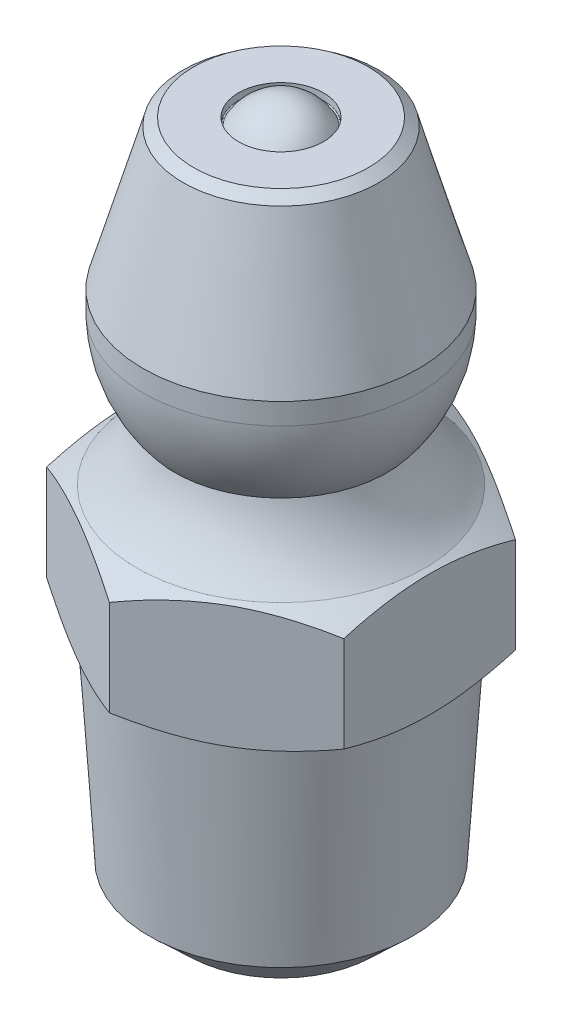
ISO-10303-21;
HEADER;
FILE_DESCRIPTION(('STEP AP214'),'2;1');
FILE_NAME('part.step','',(''),(''),'','','');
FILE_SCHEMA(('AUTOMOTIVE_DESIGN { 1 0 10303 214 1 1 1 1 }'));
ENDSEC;
DATA;
#1=APPLICATION_CONTEXT('core data for automotive mechanical design processes');
#2=APPLICATION_PROTOCOL_DEFINITION('international standard','automotive_design',2000,#1);
#3=PRODUCT_CONTEXT('',#1,'mechanical');
#4=PRODUCT('Part','Part','',(#3));
#5=PRODUCT_RELATED_PRODUCT_CATEGORY('part','',(#4));
#6=PRODUCT_DEFINITION_FORMATION('','',#4);
#7=PRODUCT_DEFINITION_CONTEXT('part definition',#1,'design');
#8=PRODUCT_DEFINITION('design','',#6,#7);
#9=PRODUCT_DEFINITION_SHAPE('','',#8);
#10=(LENGTH_UNIT() NAMED_UNIT(*) SI_UNIT(.MILLI.,.METRE.));
#11=(NAMED_UNIT(*) PLANE_ANGLE_UNIT() SI_UNIT($,.RADIAN.));
#12=(NAMED_UNIT(*) SI_UNIT($,.STERADIAN.) SOLID_ANGLE_UNIT());
#13=UNCERTAINTY_MEASURE_WITH_UNIT(LENGTH_MEASURE(1.E-05),#10,'distance_accuracy_value','');
#14=(GEOMETRIC_REPRESENTATION_CONTEXT(3) GLOBAL_UNCERTAINTY_ASSIGNED_CONTEXT((#13)) GLOBAL_UNIT_ASSIGNED_CONTEXT((#10,
#11,#12)) REPRESENTATION_CONTEXT('',''));
#15=CARTESIAN_POINT('',(0.,0.,0.));
#16=DIRECTION('',(0.,0.,1.));
#17=DIRECTION('',(1.,0.,0.));
#18=AXIS2_PLACEMENT_3D('',#15,#16,#17);
#19=CARTESIAN_POINT('',(0.,9.79999999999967,0.));
#20=DIRECTION('',(0.,-1.,0.));
#21=DIRECTION('',(1.,0.,0.));
#22=AXIS2_PLACEMENT_3D('',#19,#20,#21);
#23=SPHERICAL_SURFACE('',#22,1.10000000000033);
#24=CARTESIAN_POINT('',(0.,10.332535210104,0.));
#25=DIRECTION('',(0.,-1.,0.));
#26=DIRECTION('',(0.,0.,-1.));
#27=AXIS2_PLACEMENT_3D('',#24,#25,#26);
#28=CIRCLE('',#27,0.9625);
#29=CARTESIAN_POINT('',(0.,10.332535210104,-0.9625));
#30=VERTEX_POINT('',#29);
#31=EDGE_CURVE('E5',#30,#30,#28,.T.);
#32=ORIENTED_EDGE('',*,*,#31,.F.);
#33=EDGE_LOOP('',(#32));
#34=FACE_BOUND('',#33,.T.);
#35=ADVANCED_FACE('F9',(#34),#23,.T.);
#36=CARTESIAN_POINT('',(0.,10.3422176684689,0.));
#37=DIRECTION('',(0.,-1.,0.));
#38=DIRECTION('',(0.,0.,-1.));
#39=AXIS2_PLACEMENT_3D('',#36,#37,#38);
#40=TOROIDAL_SURFACE('',#39,0.980000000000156,0.0199999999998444);
#41=CARTESIAN_POINT('',(0.,10.342217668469,0.));
#42=DIRECTION('',(0.,-1.,0.));
#43=DIRECTION('',(0.,0.,-1.));
#44=AXIS2_PLACEMENT_3D('',#41,#42,#43);
#45=CIRCLE('',#44,1.);
#46=CARTESIAN_POINT('',(0.,10.342217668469,-1.));
#47=VERTEX_POINT('',#46);
#48=EDGE_CURVE('E20',#47,#47,#45,.T.);
#49=ORIENTED_EDGE('',*,*,#48,.F.);
#50=EDGE_LOOP('',(#49));
#51=FACE_BOUND('',#50,.T.);
#52=ORIENTED_EDGE('',*,*,#31,.T.);
#53=EDGE_LOOP('',(#52));
#54=FACE_BOUND('',#53,.T.);
#55=ADVANCED_FACE('F26',(#51,#54),#40,.F.);
#56=CARTESIAN_POINT('',(0.,-5.5,0.));
#57=DIRECTION('',(0.,-1.,0.));
#58=DIRECTION('',(0.,0.,-1.));
#59=AXIS2_PLACEMENT_3D('',#56,#57,#58);
#60=CYLINDRICAL_SURFACE('',#59,1.);
#61=CARTESIAN_POINT('',(0.,10.5,0.));
#62=DIRECTION('',(0.,-1.,0.));
#63=DIRECTION('',(0.,0.,-1.));
#64=AXIS2_PLACEMENT_3D('',#61,#62,#63);
#65=CIRCLE('',#64,1.);
#66=CARTESIAN_POINT('',(0.,10.5,-1.));
#67=VERTEX_POINT('',#66);
#68=EDGE_CURVE('E33',#67,#67,#65,.T.);
#69=ORIENTED_EDGE('',*,*,#68,.F.);
#70=EDGE_LOOP('',(#69));
#71=FACE_BOUND('',#70,.T.);
#72=ORIENTED_EDGE('',*,*,#48,.T.);
#73=EDGE_LOOP('',(#72));
#74=FACE_BOUND('',#73,.T.);
#75=ADVANCED_FACE('F39',(#71,#74),#60,.F.);
#76=CARTESIAN_POINT('',(1.,10.5,0.));
#77=DIRECTION('',(0.,-1.,0.));
#78=DIRECTION('',(0.,0.,-1.));
#79=AXIS2_PLACEMENT_3D('',#76,#77,#78);
#80=PLANE('',#79);
#81=CARTESIAN_POINT('',(0.,10.5,0.));
#82=DIRECTION('',(0.,-1.,0.));
#83=DIRECTION('',(0.,0.,-1.));
#84=AXIS2_PLACEMENT_3D('',#81,#82,#83);
#85=CIRCLE('',#84,2.0573907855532);
#86=CARTESIAN_POINT('',(0.,10.5,-2.0573907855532));
#87=VERTEX_POINT('',#86);
#88=EDGE_CURVE('E46',#87,#87,#85,.T.);
#89=ORIENTED_EDGE('',*,*,#88,.F.);
#90=EDGE_LOOP('',(#89));
#91=FACE_BOUND('',#90,.T.);
#92=ORIENTED_EDGE('',*,*,#68,.T.);
#93=EDGE_LOOP('',(#92));
#94=FACE_BOUND('',#93,.T.);
#95=ADVANCED_FACE('F52',(#91,#94),#80,.F.);
#96=CARTESIAN_POINT('',(0.,10.5,0.));
#97=DIRECTION('',(0.,-1.,0.));
#98=DIRECTION('',(0.,0.,-1.));
#99=AXIS2_PLACEMENT_3D('',#96,#97,#98);
#100=CONICAL_SURFACE('',#99,2.0573907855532,0.92458817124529);
#101=CARTESIAN_POINT('',(0.,10.31509838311,0.));
#102=DIRECTION('',(0.,-1.,0.));
#103=DIRECTION('',(0.,0.,-1.));
#104=AXIS2_PLACEMENT_3D('',#101,#102,#103);
#105=CIRCLE('',#104,2.3025408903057);
#106=CARTESIAN_POINT('',(0.,10.31509838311,-2.3025408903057));
#107=VERTEX_POINT('',#106);
#108=EDGE_CURVE('E59',#107,#107,#105,.T.);
#109=ORIENTED_EDGE('',*,*,#108,.F.);
#110=EDGE_LOOP('',(#109));
#111=FACE_BOUND('',#110,.T.);
#112=ORIENTED_EDGE('',*,*,#88,.T.);
#113=EDGE_LOOP('',(#112));
#114=FACE_BOUND('',#113,.T.);
#115=ADVANCED_FACE('F65',(#111,#114),#100,.T.);
#116=CARTESIAN_POINT('',(0.,10.31509838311,0.));
#117=DIRECTION('',(0.,-1.,0.));
#118=DIRECTION('',(0.,0.,-1.));
#119=AXIS2_PLACEMENT_3D('',#116,#117,#118);
#120=CONICAL_SURFACE('',#119,2.3025408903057,0.278380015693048);
#121=CARTESIAN_POINT('',(0.,7.,0.));
#122=DIRECTION('',(0.,-1.,0.));
#123=DIRECTION('',(0.,0.,-1.));
#124=AXIS2_PLACEMENT_3D('',#121,#122,#123);
#125=CIRCLE('',#124,3.25);
#126=CARTESIAN_POINT('',(0.,7.,-3.25));
#127=VERTEX_POINT('',#126);
#128=EDGE_CURVE('E72',#127,#127,#125,.T.);
#129=ORIENTED_EDGE('',*,*,#128,.F.);
#130=EDGE_LOOP('',(#129));
#131=FACE_BOUND('',#130,.T.);
#132=ORIENTED_EDGE('',*,*,#108,.T.);
#133=EDGE_LOOP('',(#132));
#134=FACE_BOUND('',#133,.T.);
#135=ADVANCED_FACE('F78',(#131,#134),#120,.T.);
#136=CARTESIAN_POINT('',(0.,-5.5,0.));
#137=DIRECTION('',(0.,-1.,0.));
#138=DIRECTION('',(0.,0.,-1.));
#139=AXIS2_PLACEMENT_3D('',#136,#137,#138);
#140=CYLINDRICAL_SURFACE('',#139,3.25);
#141=CARTESIAN_POINT('',(0.,6.5,0.));
#142=DIRECTION('',(0.,-1.,0.));
#143=DIRECTION('',(0.,0.,-1.));
#144=AXIS2_PLACEMENT_3D('',#141,#142,#143);
#145=CIRCLE('',#144,3.25);
#146=CARTESIAN_POINT('',(0.,6.5,-3.25));
#147=VERTEX_POINT('',#146);
#148=EDGE_CURVE('E85',#147,#147,#145,.T.);
#149=ORIENTED_EDGE('',*,*,#148,.F.);
#150=EDGE_LOOP('',(#149));
#151=FACE_BOUND('',#150,.T.);
#152=ORIENTED_EDGE('',*,*,#128,.T.);
#153=EDGE_LOOP('',(#152));
#154=FACE_BOUND('',#153,.T.);
#155=ADVANCED_FACE('F91',(#151,#154),#140,.T.);
#156=CARTESIAN_POINT('',(0.,6.57777596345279,0.));
#157=DIRECTION('',(0.,-1.,0.));
#158=DIRECTION('',(0.,0.,-1.));
#159=AXIS2_PLACEMENT_3D('',#156,#157,#158);
#160=DEGENERATE_TOROIDAL_SURFACE('',#159,0.000930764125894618,3.24999999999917,.T.);
#161=ORIENTED_EDGE('',*,*,#148,.T.);
#162=EDGE_LOOP('',(#161));
#163=FACE_BOUND('',#162,.T.);
#164=CARTESIAN_POINT('',(0.,4.5,0.));
#165=DIRECTION('',(0.,-1.,0.));
#166=DIRECTION('',(0.,0.,-1.));
#167=AXIS2_PLACEMENT_3D('',#164,#165,#166);
#168=CIRCLE('',#167,2.5);
#169=CARTESIAN_POINT('',(0.,4.5,-2.5));
#170=VERTEX_POINT('',#169);
#171=EDGE_CURVE('E100',#170,#170,#168,.T.);
#172=ORIENTED_EDGE('',*,*,#171,.F.);
#173=EDGE_LOOP('',(#172));
#174=FACE_BOUND('',#173,.T.);
#175=ADVANCED_FACE('F104',(#163,#174),#160,.T.);
#176=CARTESIAN_POINT('',(0.,5.1655121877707,0.));
#177=DIRECTION('',(0.,-1.,0.));
#178=DIRECTION('',(0.,0.,-1.));
#179=AXIS2_PLACEMENT_3D('',#176,#177,#178);
#180=TOROIDAL_SURFACE('',#179,5.32260403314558,2.90000000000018);
#181=CARTESIAN_POINT('',(0.,3.,0.));
#182=DIRECTION('',(0.,-1.,0.));
#183=DIRECTION('',(0.,0.,-1.));
#184=AXIS2_PLACEMENT_3D('',#181,#182,#183);
#185=CIRCLE('',#184,3.3937295);
#186=CARTESIAN_POINT('',(0.,3.,-3.3937295));
#187=VERTEX_POINT('',#186);
#188=EDGE_CURVE('E111',#187,#187,#185,.T.);
#189=ORIENTED_EDGE('',*,*,#188,.F.);
#190=EDGE_LOOP('',(#189));
#191=FACE_BOUND('',#190,.T.);
#192=ORIENTED_EDGE('',*,*,#171,.T.);
#193=EDGE_LOOP('',(#192));
#194=FACE_BOUND('',#193,.T.);
#195=ADVANCED_FACE('F117',(#191,#194),#180,.F.);
#196=CARTESIAN_POINT('',(0.,3.,0.));
#197=DIRECTION('',(0.,-1.,0.));
#198=DIRECTION('',(0.,0.,-1.));
#199=AXIS2_PLACEMENT_3D('',#196,#197,#198);
#200=CONICAL_SURFACE('',#199,3.3937295,1.04719755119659);
#201=CARTESIAN_POINT('',(0.,2.62603730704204,-4.04145188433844));
#202=CARTESIAN_POINT('',(-0.0388280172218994,2.63898039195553,-4.01903176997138));
#203=CARTESIAN_POINT('',(-0.0776565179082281,2.65168345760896,-3.99647185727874));
#204=CARTESIAN_POINT('',(-0.153846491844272,2.67601195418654,-3.95208241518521));
#205=CARTESIAN_POINT('',(-0.191204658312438,2.68766016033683,-3.93025967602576));
#206=CARTESIAN_POINT('',(-0.264833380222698,2.70995420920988,-3.88727169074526));
#207=CARTESIAN_POINT('',(-0.301098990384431,2.72062047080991,-3.8661085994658));
#208=CARTESIAN_POINT('',(-0.372887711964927,2.74102708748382,-3.82432677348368));
#209=CARTESIAN_POINT('',(-0.408406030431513,2.75078416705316,-3.80370798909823));
#210=CARTESIAN_POINT('',(-0.479015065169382,2.76945045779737,-3.76286763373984));
#211=CARTESIAN_POINT('',(-0.514102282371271,2.77837158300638,-3.74264546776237));
#212=CARTESIAN_POINT('',(-0.584135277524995,2.79544399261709,-3.70242085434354));
#213=CARTESIAN_POINT('',(-0.619079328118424,2.80360167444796,-3.68241811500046));
#214=CARTESIAN_POINT('',(-0.689079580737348,2.81922934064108,-3.64242012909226));
#215=CARTESIAN_POINT('',(-0.724135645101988,2.82669996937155,-3.62242489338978));
#216=CARTESIAN_POINT('',(-0.794597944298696,2.84102234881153,-3.5822218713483));
#217=CARTESIAN_POINT('',(-0.830004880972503,2.84786924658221,-3.56201359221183));
#218=CARTESIAN_POINT('',(-0.901306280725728,2.86105892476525,-3.52107480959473));
#219=CARTESIAN_POINT('',(-0.937200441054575,2.86739305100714,-3.50034097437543));
#220=CARTESIAN_POINT('',(-1.00963645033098,2.87930383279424,-3.45865964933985));
#221=CARTESIAN_POINT('',(-1.04618059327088,2.88486938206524,-3.43771295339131));
#222=CARTESIAN_POINT('',(-1.1196859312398,2.89522574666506,-3.39560236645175));
#223=CARTESIAN_POINT('',(-1.15664797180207,2.90000933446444,-3.37443818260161));
#224=CARTESIAN_POINT('',(-1.23080901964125,2.90877398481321,-3.33192539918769));
#225=CARTESIAN_POINT('',(-1.26800828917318,2.91275092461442,-3.31057640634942));
#226=CARTESIAN_POINT('',(-1.34248012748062,2.91987846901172,-3.26774262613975));
#227=CARTESIAN_POINT('',(-1.37975272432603,2.92302786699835,-3.24625768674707));
#228=CARTESIAN_POINT('',(-1.45422967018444,2.92847564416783,-3.20322392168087));
#229=CARTESIAN_POINT('',(-1.49143401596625,2.93077560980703,-3.18167529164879));
#230=CARTESIAN_POINT('',(-1.56565293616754,2.9345003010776,-3.13860665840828));
#231=CARTESIAN_POINT('',(-1.60266752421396,2.93592936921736,-3.11708705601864));
#232=CARTESIAN_POINT('',(-1.67640560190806,2.93788755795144,-3.07419056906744));
#233=CARTESIAN_POINT('',(-1.713129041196,2.93842381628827,-3.0528139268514));
#234=CARTESIAN_POINT('',(-1.78620131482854,2.93857316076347,-3.01033528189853));
#235=CARTESIAN_POINT('',(-1.82254985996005,2.93819626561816,-2.98923282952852));
#236=CARTESIAN_POINT('',(-1.89521098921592,2.93648086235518,-2.94723235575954));
#237=CARTESIAN_POINT('',(-1.93152340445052,2.93514495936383,-2.92633393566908));
#238=CARTESIAN_POINT('',(-2.00461478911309,2.93155918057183,-2.88433137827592));
#239=CARTESIAN_POINT('',(-2.04139367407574,2.92929762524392,-2.86322810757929));
#240=CARTESIAN_POINT('',(-2.11525491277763,2.92389025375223,-2.82082379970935));
#241=CARTESIAN_POINT('',(-2.15233669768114,2.92073596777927,-2.7995228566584));
#242=CARTESIAN_POINT('',(-2.22663575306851,2.91357202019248,-2.75676964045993));
#243=CARTESIAN_POINT('',(-2.2638524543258,2.9095572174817,-2.73531724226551));
#244=CARTESIAN_POINT('',(-2.33825886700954,2.90070224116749,-2.69233787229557));
#245=CARTESIAN_POINT('',(-2.37544832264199,2.89586020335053,-2.67081084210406));
#246=CARTESIAN_POINT('',(-2.44964724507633,2.88537771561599,-2.62779793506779));
#247=CARTESIAN_POINT('',(-2.48665691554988,2.87973872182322,-2.6063120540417));
#248=CARTESIAN_POINT('',(-2.56034241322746,2.86770035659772,-2.56351231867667));
#249=CARTESIAN_POINT('',(-2.59701889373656,2.86130587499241,-2.54219821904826));
#250=CARTESIAN_POINT('',(-2.66990659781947,2.84775651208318,-2.49999229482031));
#251=CARTESIAN_POINT('',(-2.70611839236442,2.84061104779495,-2.4790984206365));
#252=CARTESIAN_POINT('',(-2.77778511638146,2.82581565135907,-2.43754074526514));
#253=CARTESIAN_POINT('',(-2.81324297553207,2.81817545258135,-2.41687851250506));
#254=CARTESIAN_POINT('',(-2.88374933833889,2.80229866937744,-2.37578049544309));
#255=CARTESIAN_POINT('',(-2.91879880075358,2.79406754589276,-2.35534425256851));
#256=CARTESIAN_POINT('',(-2.98887127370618,2.77692630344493,-2.31457624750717));
#257=CARTESIAN_POINT('',(-3.02389415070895,2.76801511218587,-2.29424470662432));
#258=CARTESIAN_POINT('',(-3.09428732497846,2.74942702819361,-2.25351935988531));
#259=CARTESIAN_POINT('',(-3.12965678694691,2.73974227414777,-2.23312770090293));
#260=CARTESIAN_POINT('',(-3.20110236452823,2.7195216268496,-2.19206209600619));
#261=CARTESIAN_POINT('',(-3.23717666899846,2.70897157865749,-2.17139198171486));
#262=CARTESIAN_POINT('',(-3.3103774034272,2.68693347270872,-2.12950093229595));
#263=CARTESIAN_POINT('',(-3.34750016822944,2.67542612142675,-2.10828377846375));
#264=CARTESIAN_POINT('',(-3.4231251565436,2.65138610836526,-2.06497298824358));
#265=CARTESIAN_POINT('',(-3.4616203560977,2.63883070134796,-2.04287969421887));
#266=CARTESIAN_POINT('',(-3.50000000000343,2.62603730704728,-2.02072594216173));
#267=B_SPLINE_CURVE_WITH_KNOTS('',3,(#201,#202,#203,#204,#205,#206,#207,#208,#209,#210,#211,
#212,#213,#214,#215,#216,#217,#218,#219,#220,#221,#222,#223,#224,#225,#226,#227,#228,#229,#230,
#231,#232,#233,#234,#235,#236,#237,#238,#239,#240,#241,#242,#243,#244,#245,#246,#247,#248,#249,
#250,#251,#252,#253,#254,#255,#256,#257,#258,#259,#260,#261,#262,#263,#264,#265,#266),
.UNSPECIFIED.,.F.,.F.,(4,2,2,2,2,2,2,2,2,2,2,2,2,2,2,2,2,2,2,2,2,2,2,2,2,2,2,2,2,2,2,2,4),(0.,
0.140001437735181,0.274414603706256,0.404377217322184,0.531008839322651,0.655408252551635,
0.778648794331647,0.901772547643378,1.02578444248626,1.1515777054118,1.27903198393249,
1.40760477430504,1.53681899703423,1.6662205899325,1.79537926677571,1.92388854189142,
2.05136540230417,2.17744998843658,2.30319335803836,2.4305747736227,2.55920775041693,
2.68863179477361,2.81835144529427,2.94783707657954,3.07652633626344,3.20376027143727,
3.32898757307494,3.45317815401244,3.57756876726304,3.70344218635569,3.83211978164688,
3.96495495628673,4.10332896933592),.UNSPECIFIED.);
#268=CARTESIAN_POINT('',(0.,2.62603730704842,-4.0414518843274));
#269=VERTEX_POINT('',#268);
#270=CARTESIAN_POINT('',(-3.5,2.62603730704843,-2.0207259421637));
#271=VERTEX_POINT('',#270);
#272=EDGE_CURVE('E123',#269,#271,#267,.T.);
#273=ORIENTED_EDGE('',*,*,#272,.T.);
#274=CARTESIAN_POINT('',(-3.50000000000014,2.62603712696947,-2.02072656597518));
#275=CARTESIAN_POINT('',(-3.49999894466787,2.63001422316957,-2.00695131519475));
#276=CARTESIAN_POINT('',(-3.49999800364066,2.63396312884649,-1.99316791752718));
#277=CARTESIAN_POINT('',(-3.4999970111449,2.64176914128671,-1.96570412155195));
#278=CARTESIAN_POINT('',(-3.49999695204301,2.64562674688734,-1.95202386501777));
#279=CARTESIAN_POINT('',(-3.49999834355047,2.65328376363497,-1.92464672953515));
#280=CARTESIAN_POINT('',(-3.49999979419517,2.65708317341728,-1.91094985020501));
#281=CARTESIAN_POINT('',(-3.50000018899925,2.66462701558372,-1.88353098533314));
#282=CARTESIAN_POINT('',(-3.49999913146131,2.66837140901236,-1.8698089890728));
#283=CARTESIAN_POINT('',(-3.49999814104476,2.67579939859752,-1.84234984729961));
#284=CARTESIAN_POINT('',(-3.49999820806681,2.67948300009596,-1.82861270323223));
#285=CARTESIAN_POINT('',(-3.49999949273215,2.68680411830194,-1.80106343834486));
#286=CARTESIAN_POINT('',(-3.50000071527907,2.69044137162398,-1.78725124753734));
#287=CARTESIAN_POINT('',(-3.49999909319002,2.69764882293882,-1.75963477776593));
#288=CARTESIAN_POINT('',(-3.49999625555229,2.70121912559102,-1.74583052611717));
#289=CARTESIAN_POINT('',(-3.49999004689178,2.70827816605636,-1.71827626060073));
#290=CARTESIAN_POINT('',(-3.49998667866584,2.71176722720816,-1.70452632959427));
#291=CARTESIAN_POINT('',(-3.49998230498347,2.71867318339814,-1.67703667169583));
#292=CARTESIAN_POINT('',(-3.49998129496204,2.72209020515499,-1.66329697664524));
#293=CARTESIAN_POINT('',(-3.49998221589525,2.72886166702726,-1.6357843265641));
#294=CARTESIAN_POINT('',(-3.49998415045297,2.73221602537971,-1.62201135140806));
#295=CARTESIAN_POINT('',(-3.49998968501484,2.73887170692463,-1.59438920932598));
#296=CARTESIAN_POINT('',(-3.49999329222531,2.74217273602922,-1.58053997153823));
#297=CARTESIAN_POINT('',(-3.49999891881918,2.7487300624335,-1.55272827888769));
#298=CARTESIAN_POINT('',(-3.50000092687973,2.75198588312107,-1.53876571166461));
#299=CARTESIAN_POINT('',(-3.49999805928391,2.75842606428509,-1.51084356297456));
#300=CARTESIAN_POINT('',(-3.49999319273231,2.76161051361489,-1.49688400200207));
#301=CARTESIAN_POINT('',(-3.49998027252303,2.76789360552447,-1.46901890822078));
#302=CARTESIAN_POINT('',(-3.49997223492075,2.77099259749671,-1.45511345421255));
#303=CARTESIAN_POINT('',(-3.4999555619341,2.77710664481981,-1.42734145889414));
#304=CARTESIAN_POINT('',(-3.4999469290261,2.78012198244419,-1.41347497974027));
#305=CARTESIAN_POINT('',(-3.49993113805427,2.78607053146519,-1.38576587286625));
#306=CARTESIAN_POINT('',(-3.49992397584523,2.7890039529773,-1.37192329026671));
#307=CARTESIAN_POINT('',(-3.49991251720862,2.79479050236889,-1.34424699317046));
#308=CARTESIAN_POINT('',(-3.49990821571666,2.79764376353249,-1.33041330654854));
#309=CARTESIAN_POINT('',(-3.49990323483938,2.80327182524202,-1.30273989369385));
#310=CARTESIAN_POINT('',(-3.49990255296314,2.80604667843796,-1.28890017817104));
#311=CARTESIAN_POINT('',(-3.49990492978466,2.81151975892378,-1.26119987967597));
#312=CARTESIAN_POINT('',(-3.49990798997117,2.81421795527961,-1.24733929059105));
#313=CARTESIAN_POINT('',(-3.49991730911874,2.81953957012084,-1.21958250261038));
#314=CARTESIAN_POINT('',(-3.49992357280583,2.82216287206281,-1.20568628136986));
#315=CARTESIAN_POINT('',(-3.49993819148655,2.82733650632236,-1.17784356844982));
#316=CARTESIAN_POINT('',(-3.49994655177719,2.82988663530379,-1.16389703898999));
#317=CARTESIAN_POINT('',(-3.49996332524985,2.83491588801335,-1.13593916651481));
#318=CARTESIAN_POINT('',(-3.49997173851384,2.83739472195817,-1.12192777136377));
#319=CARTESIAN_POINT('',(-3.49998700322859,2.84228276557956,-1.09382563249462));
#320=CARTESIAN_POINT('',(-3.49999384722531,2.84469159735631,-1.07973482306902));
#321=CARTESIAN_POINT('',(-3.49999966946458,2.84944206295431,-1.05146657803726));
#322=CARTESIAN_POINT('',(-3.499998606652,2.85178328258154,-1.03728907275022));
#323=CARTESIAN_POINT('',(-3.50000796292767,2.85637822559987,-1.00889129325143));
#324=CARTESIAN_POINT('',(-3.50001840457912,2.85863176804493,-0.994670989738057));
#325=CARTESIAN_POINT('',(-3.50004680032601,2.86304948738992,-0.96620271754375));
#326=CARTESIAN_POINT('',(-3.50006476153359,2.86521357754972,-0.951954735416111));
#327=CARTESIAN_POINT('',(-3.50010589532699,2.86945163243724,-0.923435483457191));
#328=CARTESIAN_POINT('',(-3.50012907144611,2.87152553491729,-0.909164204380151));
#329=CARTESIAN_POINT('',(-3.50017824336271,2.87558265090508,-0.880602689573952));
#330=CARTESIAN_POINT('',(-3.50020424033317,2.87756582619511,-0.866312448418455));
#331=CARTESIAN_POINT('',(-3.50025704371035,2.88144087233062,-0.837717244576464));
#332=CARTESIAN_POINT('',(-3.50028385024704,2.88333272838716,-0.823412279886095));
#333=CARTESIAN_POINT('',(-3.50033651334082,2.88702453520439,-0.794791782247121));
#334=CARTESIAN_POINT('',(-3.50036236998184,2.88882449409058,-0.780476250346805));
#335=CARTESIAN_POINT('',(-3.500411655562,2.89233190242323,-0.751838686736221));
#336=CARTESIAN_POINT('',(-3.50043508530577,2.89403938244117,-0.737516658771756));
#337=CARTESIAN_POINT('',(-3.50047830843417,2.89736123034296,-0.708870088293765));
#338=CARTESIAN_POINT('',(-3.50049810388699,2.89897565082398,-0.694545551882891));
#339=CARTESIAN_POINT('',(-3.50053311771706,2.90211077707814,-0.665897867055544));
#340=CARTESIAN_POINT('',(-3.50054833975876,2.90363155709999,-0.651574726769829));
#341=CARTESIAN_POINT('',(-3.50057352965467,2.90657880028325,-0.622933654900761));
#342=CARTESIAN_POINT('',(-3.50058350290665,2.90800535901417,-0.6086157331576));
#343=CARTESIAN_POINT('',(-3.50059777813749,2.91076355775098,-0.579988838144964));
#344=CARTESIAN_POINT('',(-3.50060208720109,2.91209531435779,-0.565679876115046));
#345=CARTESIAN_POINT('',(-3.50060487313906,2.91466330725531,-0.537074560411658));
#346=CARTESIAN_POINT('',(-3.50060335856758,2.91589968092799,-0.522778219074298));
#347=CARTESIAN_POINT('',(-3.50059458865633,2.91827630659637,-0.494201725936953));
#348=CARTESIAN_POINT('',(-3.5005873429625,2.91941671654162,-0.479921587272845));
#349=CARTESIAN_POINT('',(-3.50056745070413,2.92160081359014,-0.451381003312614));
#350=CARTESIAN_POINT('',(-3.50055481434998,2.92264467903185,-0.437120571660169));
#351=CARTESIAN_POINT('',(-3.50052472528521,2.92463508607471,-0.408622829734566));
#352=CARTESIAN_POINT('',(-3.50050728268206,2.9255818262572,-0.394385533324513));
#353=CARTESIAN_POINT('',(-3.50046840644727,2.92737738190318,-0.36593741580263));
#354=CARTESIAN_POINT('',(-3.5004469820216,2.92822641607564,-0.35172660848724));
#355=CARTESIAN_POINT('',(-3.50040120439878,2.92982595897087,-0.323334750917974));
#356=CARTESIAN_POINT('',(-3.50037685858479,2.93057670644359,-0.309153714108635));
#357=CARTESIAN_POINT('',(-3.50032653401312,2.93197907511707,-0.28082460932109));
#358=CARTESIAN_POINT('',(-3.50030055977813,2.93263095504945,-0.266676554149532));
#359=CARTESIAN_POINT('',(-3.50024850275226,2.93383498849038,-0.238416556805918));
#360=CARTESIAN_POINT('',(-3.50022242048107,2.93438742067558,-0.224304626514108));
#361=CARTESIAN_POINT('',(-3.50017190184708,2.93539195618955,-0.196119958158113));
#362=CARTESIAN_POINT('',(-3.50014746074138,2.93584435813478,-0.182047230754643));
#363=CARTESIAN_POINT('',(-3.50010218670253,2.93664823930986,-0.153943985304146));
#364=CARTESIAN_POINT('',(-3.50008134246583,2.937000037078,-0.139913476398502));
#365=CARTESIAN_POINT('',(-3.50004549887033,2.93760208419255,-0.111897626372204));
#366=CARTESIAN_POINT('',(-3.50003048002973,2.93785267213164,-0.0979122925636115));
#367=CARTESIAN_POINT('',(-3.50000853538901,2.93825179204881,-0.0699896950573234));
#368=CARTESIAN_POINT('',(-3.50000158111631,2.93840068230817,-0.0560524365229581));
#369=CARTESIAN_POINT('',(-3.4999989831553,2.93859573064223,-0.0281902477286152));
#370=CARTESIAN_POINT('',(-3.50000332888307,2.93864198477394,-0.0142653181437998));
#371=CARTESIAN_POINT('',(-3.50002160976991,2.9386329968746,0.0136319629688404));
#372=CARTESIAN_POINT('',(-3.50003557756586,2.93857740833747,0.027604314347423));
#373=CARTESIAN_POINT('',(-3.50007032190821,2.93836540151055,0.05559446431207));
#374=CARTESIAN_POINT('',(-3.50009112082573,2.93820865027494,0.0696122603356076));
#375=CARTESIAN_POINT('',(-3.50013731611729,2.93779476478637,0.0976904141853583));
#376=CARTESIAN_POINT('',(-3.50016272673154,2.93753731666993,0.111750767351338));
#377=CARTESIAN_POINT('',(-3.50021604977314,2.93692254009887,0.139911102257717));
#378=CARTESIAN_POINT('',(-3.50024396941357,2.93656491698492,0.154011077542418));
#379=CARTESIAN_POINT('',(-3.5003004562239,2.93575027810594,0.182247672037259));
#380=CARTESIAN_POINT('',(-3.50032902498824,2.93529298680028,0.196384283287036));
#381=CARTESIAN_POINT('',(-3.50038516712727,2.93427950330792,0.224691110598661));
#382=CARTESIAN_POINT('',(-3.50041273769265,2.93372305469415,0.2388613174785));
#383=CARTESIAN_POINT('',(-3.50046546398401,2.93251174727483,0.267232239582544));
#384=CARTESIAN_POINT('',(-3.50049061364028,2.93185665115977,0.281432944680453));
#385=CARTESIAN_POINT('',(-3.50053730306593,2.93044853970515,0.30986170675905));
#386=CARTESIAN_POINT('',(-3.50055883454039,2.92969530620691,0.32408975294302));
#387=CARTESIAN_POINT('',(-3.50059732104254,2.92809141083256,0.352569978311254));
#388=CARTESIAN_POINT('',(-3.50061426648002,2.92724055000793,0.366822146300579));
#389=CARTESIAN_POINT('',(-3.50064284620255,2.92544189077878,0.395347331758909));
#390=CARTESIAN_POINT('',(-3.50065447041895,2.92449391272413,0.409620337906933));
#391=CARTESIAN_POINT('',(-3.50067190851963,2.92250150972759,0.438183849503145));
#392=CARTESIAN_POINT('',(-3.50067771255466,2.92145692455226,0.452474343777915));
#393=CARTESIAN_POINT('',(-3.50068325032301,2.91927179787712,0.481069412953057));
#394=CARTESIAN_POINT('',(-3.50068297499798,2.91813111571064,0.495373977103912));
#395=CARTESIAN_POINT('',(-3.50067633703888,2.91575428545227,0.523993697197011));
#396=CARTESIAN_POINT('',(-3.50066996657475,2.91451801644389,0.538308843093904));
#397=CARTESIAN_POINT('',(-3.50065136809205,2.91195050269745,0.566946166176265));
#398=CARTESIAN_POINT('',(-3.50063913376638,2.91061915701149,0.581268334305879));
#399=CARTESIAN_POINT('',(-3.5006092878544,2.90786197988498,0.609916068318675));
#400=CARTESIAN_POINT('',(-3.50059167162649,2.90643606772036,0.624241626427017));
#401=CARTESIAN_POINT('',(-3.50055179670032,2.90349024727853,0.652892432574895));
#402=CARTESIAN_POINT('',(-3.50052953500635,2.90197027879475,0.667217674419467));
#403=CARTESIAN_POINT('',(-3.50048136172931,2.89883683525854,0.695864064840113));
#404=CARTESIAN_POINT('',(-3.50045544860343,2.89722332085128,0.710185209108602));
#405=CARTESIAN_POINT('',(-3.5004012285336,2.89390327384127,0.738819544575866));
#406=CARTESIAN_POINT('',(-3.50037292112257,2.89219672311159,0.753132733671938));
#407=CARTESIAN_POINT('',(-3.50031542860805,2.88869109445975,0.781747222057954));
#408=CARTESIAN_POINT('',(-3.50028624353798,2.88689202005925,0.796048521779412));
#409=CARTESIAN_POINT('',(-3.50022880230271,2.8832018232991,0.824635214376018));
#410=CARTESIAN_POINT('',(-3.50020054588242,2.88131072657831,0.838920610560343));
#411=CARTESIAN_POINT('',(-3.50014696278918,2.87743700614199,0.8674714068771));
#412=CARTESIAN_POINT('',(-3.50012163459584,2.87545443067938,0.881736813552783));
#413=CARTESIAN_POINT('',(-3.50007647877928,2.87139811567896,0.910243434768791));
#414=CARTESIAN_POINT('',(-3.50005664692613,2.86932444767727,0.924484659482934));
#415=CARTESIAN_POINT('',(-3.50002424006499,2.86508689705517,0.952938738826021));
#416=CARTESIAN_POINT('',(-3.50001165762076,2.86292310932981,0.967151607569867));
#417=CARTESIAN_POINT('',(-3.49999986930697,2.8585049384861,0.995538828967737));
#418=CARTESIAN_POINT('',(-3.50000064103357,2.85625071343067,1.00971320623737));
#419=CARTESIAN_POINT('',(-3.49999558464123,2.85167081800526,1.03798348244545));
#420=CARTESIAN_POINT('',(-3.49998978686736,2.84934552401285,1.05207944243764));
#421=CARTESIAN_POINT('',(-3.49997577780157,2.84462299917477,1.08019555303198));
#422=CARTESIAN_POINT('',(-3.4999675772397,2.84222612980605,1.09421576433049));
#423=CARTESIAN_POINT('',(-3.49995086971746,2.83735925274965,1.12219347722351));
#424=CARTESIAN_POINT('',(-3.49994236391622,2.83488952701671,1.13615102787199));
#425=CARTESIAN_POINT('',(-3.499926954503,2.82987551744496,1.16401657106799));
#426=CARTESIAN_POINT('',(-3.49992004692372,2.82733143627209,1.17792460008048));
#427=CARTESIAN_POINT('',(-3.49990905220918,2.82216735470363,1.205704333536));
#428=CARTESIAN_POINT('',(-3.49990496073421,2.8195474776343,1.21957606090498));
#429=CARTESIAN_POINT('',(-3.49990026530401,2.81423042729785,1.24729649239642));
#430=CARTESIAN_POINT('',(-3.49989965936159,2.81153329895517,1.2611452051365));
#431=CARTESIAN_POINT('',(-3.49990202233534,2.80606037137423,1.28883297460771));
#432=CARTESIAN_POINT('',(-3.49990499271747,2.80328454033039,1.30267202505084));
#433=CARTESIAN_POINT('',(-3.49991402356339,2.79765283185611,1.33035389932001));
#434=CARTESIAN_POINT('',(-3.49992008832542,2.79479684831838,1.34419670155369));
#435=CARTESIAN_POINT('',(-3.4999342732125,2.78900344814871,1.37189956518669));
#436=CARTESIAN_POINT('',(-3.4999423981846,2.7860658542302,1.38575958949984));
#437=CARTESIAN_POINT('',(-3.4999590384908,2.7801078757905,1.4135104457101));
#438=CARTESIAN_POINT('',(-3.4999675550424,2.77708724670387,1.42740122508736));
#439=CARTESIAN_POINT('',(-3.49998299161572,2.77096171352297,1.4552271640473));
#440=CARTESIAN_POINT('',(-3.49998990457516,2.76785650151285,1.46916225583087));
#441=CARTESIAN_POINT('',(-3.49999866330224,2.76156192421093,1.49708544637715));
#442=CARTESIAN_POINT('',(-3.50000048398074,2.75837222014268,1.51107346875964));
#443=CARTESIAN_POINT('',(-3.49999875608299,2.75193762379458,1.53897798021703));
#444=CARTESIAN_POINT('',(-3.4999952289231,2.7486930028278,1.55289453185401));
#445=CARTESIAN_POINT('',(-3.49998831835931,2.74215456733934,1.58062720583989));
#446=CARTESIAN_POINT('',(-3.49998493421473,2.73886116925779,1.59444342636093));
#447=CARTESIAN_POINT('',(-3.49998051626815,2.73221675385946,1.62201607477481));
#448=CARTESIAN_POINT('',(-3.49997947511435,2.72886595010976,1.6357725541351));
#449=CARTESIAN_POINT('',(-3.49998037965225,2.72209814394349,1.66326685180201));
#450=CARTESIAN_POINT('',(-3.49998232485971,2.71868115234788,1.67700467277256));
#451=CARTESIAN_POINT('',(-3.49998816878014,2.71177230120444,1.70450326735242));
#452=CARTESIAN_POINT('',(-3.49999207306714,2.70828025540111,1.71826399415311));
#453=CARTESIAN_POINT('',(-3.49999790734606,2.70121351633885,1.74584910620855));
#454=CARTESIAN_POINT('',(-3.49999982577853,2.69763846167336,1.75967339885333));
#455=CARTESIAN_POINT('',(-3.50000007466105,2.69043343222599,1.78728257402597));
#456=CARTESIAN_POINT('',(-3.499998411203,2.68680356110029,1.80106748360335));
#457=CARTESIAN_POINT('',(-3.49999708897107,2.67949368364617,1.82857479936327));
#458=CARTESIAN_POINT('',(-3.49999742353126,2.67581388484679,1.84229726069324));
#459=CARTESIAN_POINT('',(-3.49999873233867,2.66838330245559,1.86976615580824));
#460=CARTESIAN_POINT('',(-3.4999997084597,2.66463234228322,1.88351254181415));
#461=CARTESIAN_POINT('',(-3.50000027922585,2.65707248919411,1.91098775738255));
#462=CARTESIAN_POINT('',(-3.49999987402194,2.6532636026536,1.92471658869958));
#463=CARTESIAN_POINT('',(-3.4999996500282,2.64558497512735,1.95216778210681));
#464=CARTESIAN_POINT('',(-3.49999983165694,2.64171519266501,1.96589013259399));
#465=CARTESIAN_POINT('',(-3.50000012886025,2.63391801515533,1.99332169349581));
#466=CARTESIAN_POINT('',(-3.50000024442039,2.62999060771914,2.00703090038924));
#467=CARTESIAN_POINT('',(-3.5,2.626035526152,2.02073211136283));
#468=B_SPLINE_CURVE_WITH_KNOTS('',3,(#274,#275,#276,#277,#278,#279,#280,#281,#282,#283,#284,
#285,#286,#287,#288,#289,#290,#291,#292,#293,#294,#295,#296,#297,#298,#299,#300,#301,#302,#303,
#304,#305,#306,#307,#308,#309,#310,#311,#312,#313,#314,#315,#316,#317,#318,#319,#320,#321,#322,
#323,#324,#325,#326,#327,#328,#329,#330,#331,#332,#333,#334,#335,#336,#337,#338,#339,#340,#341,
#342,#343,#344,#345,#346,#347,#348,#349,#350,#351,#352,#353,#354,#355,#356,#357,#358,#359,#360,
#361,#362,#363,#364,#365,#366,#367,#368,#369,#370,#371,#372,#373,#374,#375,#376,#377,#378,#379,
#380,#381,#382,#383,#384,#385,#386,#387,#388,#389,#390,#391,#392,#393,#394,#395,#396,#397,#398,
#399,#400,#401,#402,#403,#404,#405,#406,#407,#408,#409,#410,#411,#412,#413,#414,#415,#416,#417,
#418,#419,#420,#421,#422,#423,#424,#425,#426,#427,#428,#429,#430,#431,#432,#433,#434,#435,#436,
#437,#438,#439,#440,#441,#442,#443,#444,#445,#446,#447,#448,#449,#450,#451,#452,#453,#454,#455,
#456,#457,#458,#459,#460,#461,#462,#463,#464,#465,#466,#467),.UNSPECIFIED.,.F.,.F.,(4,2,2,2,2,2,
2,2,2,2,2,2,2,2,2,2,2,2,2,2,2,2,2,2,2,2,2,2,2,2,2,2,2,2,2,2,2,2,2,2,2,2,2,2,2,2,2,2,2,2,2,2,2,2,
2,2,2,2,2,2,2,2,2,2,2,2,2,2,2,2,2,2,2,2,2,2,2,2,2,2,2,2,2,2,2,2,2,2,2,2,2,2,2,2,2,2,4),(0.,
0.0430136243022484,0.0856547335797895,0.128296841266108,0.170967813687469,0.213635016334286,
0.256484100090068,0.29925941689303,0.341816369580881,0.384290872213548,0.426817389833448,
0.469528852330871,0.512540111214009,0.555494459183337,0.598234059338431,0.640805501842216,
0.683255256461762,0.725629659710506,0.767974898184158,0.810336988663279,0.852761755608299,
0.895294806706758,0.937981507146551,0.980866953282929,1.02397523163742,1.06716820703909,
1.11040212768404,1.15366542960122,1.19694679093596,1.24023513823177,1.28351965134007,
1.32678976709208,1.37003518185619,1.41324585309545,1.45641200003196,1.49952410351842,
1.54257290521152,1.58554940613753,1.62844486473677,1.67125079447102,1.71395896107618,
1.75656137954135,1.79905031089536,1.84141825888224,1.88365796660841,1.92576241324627,
1.96772481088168,2.0095386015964,2.05131324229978,2.0932302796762,2.13528598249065,
2.17747382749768,2.21978709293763,2.26221885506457,2.30476198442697,2.34740914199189,
2.39015277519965,2.4329851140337,2.47589816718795,2.51888371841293,2.56193332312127,
2.60503830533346,2.64818975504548,2.69137852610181,2.73459523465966,2.77783025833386,
2.8210737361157,2.86431556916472,2.90754542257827,2.95075272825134,2.99392668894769,
3.03705628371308,3.08011352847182,3.12297269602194,3.16564331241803,3.20816619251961,
3.25058235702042,3.29293300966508,3.33525951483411,3.3776033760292,3.42000621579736,
3.46250975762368,3.50515581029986,3.54798625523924,3.59102735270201,3.63389653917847,
3.67650633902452,3.71898225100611,3.76145127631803,3.80404182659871,3.84687892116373,
3.8896432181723,3.93226492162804,3.97501166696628,4.01775374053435,4.06052630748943,
4.10330820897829),.UNSPECIFIED.);
#469=CARTESIAN_POINT('',(-3.5,2.62603730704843,2.0207259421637));
#470=VERTEX_POINT('',#469);
#471=EDGE_CURVE('E138',#271,#470,#468,.T.);
#472=ORIENTED_EDGE('',*,*,#471,.T.);
#473=CARTESIAN_POINT('',(-3.50000000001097,2.62603730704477,2.02072594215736));
#474=CARTESIAN_POINT('',(-3.46116960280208,2.63898039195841,2.0431419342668));
#475=CARTESIAN_POINT('',(-3.42221789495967,2.65168345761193,2.06548844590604));
#476=CARTESIAN_POINT('',(-3.34568052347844,2.67601195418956,2.10927617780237));
#477=CARTESIAN_POINT('',(-3.30810239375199,2.68766016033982,2.13071792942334));
#478=CARTESIAN_POINT('',(-3.23405934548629,2.70995420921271,2.17298828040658));
#479=CARTESIAN_POINT('',(-3.19759876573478,2.72062047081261,2.19381367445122));
#480=CARTESIAN_POINT('',(-3.12552028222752,2.74102708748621,2.23509361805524));
#481=CARTESIAN_POINT('',(-3.0899047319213,2.75078416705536,2.25554399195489));
#482=CARTESIAN_POINT('',(-3.0192314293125,2.76945045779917,2.29627303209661));
#483=CARTESIAN_POINT('',(-2.98417491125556,2.77837158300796,2.31654837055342));
#484=CARTESIAN_POINT('',(-2.91432287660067,2.79544399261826,2.35708641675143));
#485=CARTESIAN_POINT('',(-2.8795279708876,2.80360167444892,2.37734748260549));
#486=CARTESIAN_POINT('',(-2.80988857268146,2.81922934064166,2.41797048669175));
#487=CARTESIAN_POINT('',(-2.77504415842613,2.82669996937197,2.43833231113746));
#488=CARTESIAN_POINT('',(-2.70499617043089,2.84102234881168,2.47925294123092));
#489=CARTESIAN_POINT('',(-2.66979181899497,2.84786924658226,2.49981210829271));
#490=CARTESIAN_POINT('',(-2.59868709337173,2.86105892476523,2.54109154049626));
#491=CARTESIAN_POINT('',(-2.56278398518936,2.86739305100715,2.56180987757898));
#492=CARTESIAN_POINT('',(-2.49046889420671,2.8793038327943,2.60370063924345));
#493=CARTESIAN_POINT('',(-2.45405645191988,2.88486938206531,2.62487544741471));
#494=CARTESIAN_POINT('',(-2.38083494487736,2.89522574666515,2.66747764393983));
#495=CARTESIAN_POINT('',(-2.34402520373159,2.90000933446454,2.68890561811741));
#496=CARTESIAN_POINT('',(-2.27012752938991,2.90877398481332,2.73187457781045));
#497=CARTESIAN_POINT('',(-2.2330391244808,2.91275092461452,2.75341559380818));
#498=CARTESIAN_POINT('',(-2.15870806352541,2.91987846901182,2.79649320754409));
#499=CARTESIAN_POINT('',(-2.12146526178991,2.92302786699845,2.81802975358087));
#500=CARTESIAN_POINT('',(-2.04695845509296,2.92847564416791,2.86101179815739));
#501=CARTESIAN_POINT('',(-2.00969462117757,2.9307756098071,2.88245739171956));
#502=CARTESIAN_POINT('',(-1.93528663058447,2.93450030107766,2.92519854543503));
#503=CARTESIAN_POINT('',(-1.89814281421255,2.93592936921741,2.946494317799));
#504=CARTESIAN_POINT('',(-1.82412432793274,2.93788755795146,2.98890512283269));
#505=CARTESIAN_POINT('',(-1.78724989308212,2.93842381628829,3.01002023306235));
#506=CARTESIAN_POINT('',(-1.71392617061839,2.93857316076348,3.05206335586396));
#507=CARTESIAN_POINT('',(-1.67747663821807,2.93819626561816,3.07299089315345));
#508=CARTESIAN_POINT('',(-1.60477259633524,2.93648086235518,3.1149170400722));
#509=CARTESIAN_POINT('',(-1.56851782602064,2.93514495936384,3.1359153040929));
#510=CARTESIAN_POINT('',(-1.49559685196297,2.93155918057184,3.17821302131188));
#511=CARTESIAN_POINT('',(-1.45893144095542,2.92929762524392,3.19951283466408));
#512=CARTESIAN_POINT('',(-1.38527761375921,2.92389025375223,3.24227638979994));
#513=CARTESIAN_POINT('',(-1.34828956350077,2.92073596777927,3.26373968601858));
#514=CARTESIAN_POINT('',(-1.27411466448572,2.91357202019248,3.30670794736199));
#515=CARTESIAN_POINT('',(-1.23692799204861,2.9095572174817,3.32821235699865));
#516=CARTESIAN_POINT('',(-1.16250355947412,2.90070224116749,3.37116051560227));
#517=CARTESIAN_POINT('',(-1.12526587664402,2.89586020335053,3.39260401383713));
#518=CARTESIAN_POINT('',(-1.05091614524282,2.885377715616,3.43535571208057));
#519=CARTESIAN_POINT('',(-1.01380399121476,2.87973872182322,3.45666408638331));
#520=CARTESIAN_POINT('',(-0.939895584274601,2.86770035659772,3.49907773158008));
#521=CARTESIAN_POINT('',(-0.903098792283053,2.86130587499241,3.52018344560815));
#522=CARTESIAN_POINT('',(-0.830103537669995,2.84775651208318,3.56220308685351));
#523=CARTESIAN_POINT('',(-0.793903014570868,2.84061104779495,3.58311648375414));
#524=CARTESIAN_POINT('',(-0.722079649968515,2.82581565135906,3.62440284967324));
#525=CARTESIAN_POINT('',(-0.686456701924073,2.81817545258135,3.64477914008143));
#526=CARTESIAN_POINT('',(-0.615611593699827,2.80229866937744,3.68529043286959));
#527=CARTESIAN_POINT('',(-0.58038855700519,2.79406754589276,3.70542603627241));
#528=CARTESIAN_POINT('',(-0.51004619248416,2.77692630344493,3.7457265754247));
#529=CARTESIAN_POINT('',(-0.474927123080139,2.76801511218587,3.76589150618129));
#530=CARTESIAN_POINT('',(-0.404461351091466,2.7494270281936,3.8064911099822));
#531=CARTESIAN_POINT('',(-0.369116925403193,2.73974227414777,3.82692613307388));
#532=CARTESIAN_POINT('',(-0.297830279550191,2.7195216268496,3.86826701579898));
#533=CARTESIAN_POINT('',(-0.26189228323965,2.70897157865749,3.88917322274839));
#534=CARTESIAN_POINT('',(-0.189013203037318,2.68693347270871,3.9316213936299));
#535=CARTESIAN_POINT('',(-0.15207722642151,2.67542612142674,3.95316207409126));
#536=CARTESIAN_POINT('',(-0.0767564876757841,2.65138610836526,3.99699984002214));
#537=CARTESIAN_POINT('',(-0.0383755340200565,2.63883070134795,4.01929101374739));
#538=CARTESIAN_POINT('',(3.43208594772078E-12,2.62603730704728,4.04145188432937));
#539=B_SPLINE_CURVE_WITH_KNOTS('',3,(#473,#474,#475,#476,#477,#478,#479,#480,#481,#482,#483,
#484,#485,#486,#487,#488,#489,#490,#491,#492,#493,#494,#495,#496,#497,#498,#499,#500,#501,#502,
#503,#504,#505,#506,#507,#508,#509,#510,#511,#512,#513,#514,#515,#516,#517,#518,#519,#520,#521,
#522,#523,#524,#525,#526,#527,#528,#529,#530,#531,#532,#533,#534,#535,#536,#537,#538),
.UNSPECIFIED.,.F.,.F.,(4,2,2,2,2,2,2,2,2,2,2,2,2,2,2,2,2,2,2,2,2,2,2,2,2,2,2,2,2,2,2,2,4),(0.,
0.140001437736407,0.274414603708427,0.404377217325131,0.531008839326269,0.655408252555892,
0.778648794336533,0.901772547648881,1.02578444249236,1.15157770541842,1.27903198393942,
1.40760477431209,1.53681899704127,1.66622058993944,1.79537926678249,1.92388854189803,
2.05136540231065,2.177449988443,2.30319335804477,2.43057477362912,2.55920775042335,
2.68863179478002,2.81835144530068,2.94783707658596,3.07652633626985,3.20376027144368,
3.32898757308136,3.45317815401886,3.57756876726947,3.70344218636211,3.83211978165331,
3.96495495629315,4.10332896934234),.UNSPECIFIED.);
#540=CARTESIAN_POINT('',(0.,2.62603730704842,4.0414518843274));
#541=VERTEX_POINT('',#540);
#542=EDGE_CURVE('E152',#470,#541,#539,.T.);
#543=ORIENTED_EDGE('',*,*,#542,.T.);
#544=CARTESIAN_POINT('',(-1.09709045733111E-11,2.62603730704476,4.04145188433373));
#545=CARTESIAN_POINT('',(0.0388280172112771,2.6389803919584,4.01903176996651));
#546=CARTESIAN_POINT('',(0.0776565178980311,2.65168345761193,3.99647185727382));
#547=CARTESIAN_POINT('',(0.153846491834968,2.67601195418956,3.95208241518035));
#548=CARTESIAN_POINT('',(0.191204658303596,2.68766016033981,3.93025967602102));
#549=CARTESIAN_POINT('',(0.264833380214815,2.7099542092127,3.88727169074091));
#550=CARTESIAN_POINT('',(0.301098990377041,2.7206204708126,3.86610859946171));
#551=CARTESIAN_POINT('',(0.372887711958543,2.7410270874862,3.82432677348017));
#552=CARTESIAN_POINT('',(0.408406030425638,2.75078416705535,3.80370798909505));
#553=CARTESIAN_POINT('',(0.479015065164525,2.76945045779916,3.76286763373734));
#554=CARTESIAN_POINT('',(0.514102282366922,2.77837158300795,3.74264546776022));
#555=CARTESIAN_POINT('',(0.584135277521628,2.79544399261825,3.70242085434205));
#556=CARTESIAN_POINT('',(0.619079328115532,2.80360167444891,3.68241811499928));
#557=CARTESIAN_POINT('',(0.689079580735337,2.81922934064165,3.64242012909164));
#558=CARTESIAN_POINT('',(0.724135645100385,2.82669996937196,3.62242489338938));
#559=CARTESIAN_POINT('',(0.794597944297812,2.84102234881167,3.58222187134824));
#560=CARTESIAN_POINT('',(0.830004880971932,2.84786924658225,3.56201359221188));
#561=CARTESIAN_POINT('',(0.901306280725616,2.86105892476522,3.52107480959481));
#562=CARTESIAN_POINT('',(0.937200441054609,2.86739305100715,3.50034097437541));
#563=CARTESIAN_POINT('',(1.00963645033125,2.87930383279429,3.45865964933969));
#564=CARTESIAN_POINT('',(1.04618059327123,2.88486938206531,3.43771295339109));
#565=CARTESIAN_POINT('',(1.11968593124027,2.89522574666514,3.39560236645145));
#566=CARTESIAN_POINT('',(1.15664797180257,2.90000933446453,3.37443818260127));
#567=CARTESIAN_POINT('',(1.23080901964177,2.90877398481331,3.33192539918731));
#568=CARTESIAN_POINT('',(1.26800828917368,2.91275092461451,3.31057640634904));
#569=CARTESIAN_POINT('',(1.34248012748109,2.91987846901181,3.26774262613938));
#570=CARTESIAN_POINT('',(1.37975272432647,2.92302786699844,3.24625768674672));
#571=CARTESIAN_POINT('',(1.45422967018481,2.92847564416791,3.20322392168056));
#572=CARTESIAN_POINT('',(1.49143401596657,2.9307756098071,3.18167529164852));
#573=CARTESIAN_POINT('',(1.56565293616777,2.93450030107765,3.13860665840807));
#574=CARTESIAN_POINT('',(1.60266752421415,2.9359293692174,3.11708705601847));
#575=CARTESIAN_POINT('',(1.67640560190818,2.93788755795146,3.07419056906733));
#576=CARTESIAN_POINT('',(1.71312904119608,2.93842381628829,3.05281392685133));
#577=CARTESIAN_POINT('',(1.78620131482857,2.93857316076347,3.0103352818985));
#578=CARTESIAN_POINT('',(1.82254985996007,2.93819626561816,2.98923282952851));
#579=CARTESIAN_POINT('',(1.89521098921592,2.93648086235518,2.94723235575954));
#580=CARTESIAN_POINT('',(1.93152340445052,2.93514495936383,2.92633393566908));
#581=CARTESIAN_POINT('',(2.00461478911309,2.93155918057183,2.88433137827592));
#582=CARTESIAN_POINT('',(2.04139367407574,2.92929762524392,2.86322810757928));
#583=CARTESIAN_POINT('',(2.11525491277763,2.92389025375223,2.82082379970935));
#584=CARTESIAN_POINT('',(2.15233669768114,2.92073596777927,2.7995228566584));
#585=CARTESIAN_POINT('',(2.22663575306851,2.91357202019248,2.75676964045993));
#586=CARTESIAN_POINT('',(2.2638524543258,2.9095572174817,2.73531724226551));
#587=CARTESIAN_POINT('',(2.33825886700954,2.90070224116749,2.69233787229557));
#588=CARTESIAN_POINT('',(2.37544832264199,2.89586020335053,2.67081084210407));
#589=CARTESIAN_POINT('',(2.44964724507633,2.88537771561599,2.62779793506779));
#590=CARTESIAN_POINT('',(2.48665691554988,2.87973872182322,2.6063120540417));
#591=CARTESIAN_POINT('',(2.56034241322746,2.86770035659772,2.56351231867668));
#592=CARTESIAN_POINT('',(2.59701889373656,2.86130587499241,2.54219821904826));
#593=CARTESIAN_POINT('',(2.66990659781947,2.84775651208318,2.49999229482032));
#594=CARTESIAN_POINT('',(2.70611839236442,2.84061104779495,2.47909842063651));
#595=CARTESIAN_POINT('',(2.77778511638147,2.82581565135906,2.43754074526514));
#596=CARTESIAN_POINT('',(2.81324297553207,2.81817545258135,2.41687851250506));
#597=CARTESIAN_POINT('',(2.88374933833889,2.80229866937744,2.37578049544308));
#598=CARTESIAN_POINT('',(2.91879880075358,2.79406754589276,2.35534425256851));
#599=CARTESIAN_POINT('',(2.98887127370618,2.77692630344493,2.31457624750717));
#600=CARTESIAN_POINT('',(3.02389415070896,2.76801511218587,2.29424470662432));
#601=CARTESIAN_POINT('',(3.09428732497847,2.7494270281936,2.2535193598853));
#602=CARTESIAN_POINT('',(3.12965678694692,2.73974227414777,2.23312770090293));
#603=CARTESIAN_POINT('',(3.20110236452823,2.7195216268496,2.19206209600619));
#604=CARTESIAN_POINT('',(3.23717666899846,2.70897157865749,2.17139198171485));
#605=CARTESIAN_POINT('',(3.3103774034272,2.68693347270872,2.12950093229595));
#606=CARTESIAN_POINT('',(3.34750016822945,2.67542612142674,2.10828377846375));
#607=CARTESIAN_POINT('',(3.42312515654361,2.65138610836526,2.06497298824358));
#608=CARTESIAN_POINT('',(3.46162035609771,2.63883070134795,2.04287969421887));
#609=CARTESIAN_POINT('',(3.50000000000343,2.62603730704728,2.02072594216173));
#610=B_SPLINE_CURVE_WITH_KNOTS('',3,(#544,#545,#546,#547,#548,#549,#550,#551,#552,#553,#554,
#555,#556,#557,#558,#559,#560,#561,#562,#563,#564,#565,#566,#567,#568,#569,#570,#571,#572,#573,
#574,#575,#576,#577,#578,#579,#580,#581,#582,#583,#584,#585,#586,#587,#588,#589,#590,#591,#592,
#593,#594,#595,#596,#597,#598,#599,#600,#601,#602,#603,#604,#605,#606,#607,#608,#609),
.UNSPECIFIED.,.F.,.F.,(4,2,2,2,2,2,2,2,2,2,2,2,2,2,2,2,2,2,2,2,2,2,2,2,2,2,2,2,2,2,2,2,4),(0.,
0.140001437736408,0.27441460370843,0.404377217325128,0.531008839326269,0.655408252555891,
0.778648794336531,0.901772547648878,1.02578444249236,1.15157770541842,1.27903198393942,
1.40760477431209,1.53681899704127,1.66622058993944,1.79537926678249,1.92388854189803,
2.05136540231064,2.17744998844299,2.30319335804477,2.43057477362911,2.55920775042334,
2.68863179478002,2.81835144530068,2.94783707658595,3.07652633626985,3.20376027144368,
3.32898757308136,3.45317815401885,3.57756876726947,3.70344218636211,3.8321197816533,
3.96495495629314,4.10332896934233),.UNSPECIFIED.);
#611=CARTESIAN_POINT('',(3.5,2.62603730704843,2.0207259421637));
#612=VERTEX_POINT('',#611);
#613=EDGE_CURVE('E166',#541,#612,#610,.T.);
#614=ORIENTED_EDGE('',*,*,#613,.T.);
#615=CARTESIAN_POINT('',(3.50000000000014,2.62603712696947,2.02072656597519));
#616=CARTESIAN_POINT('',(3.49999894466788,2.63001422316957,2.00695131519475));
#617=CARTESIAN_POINT('',(3.49999800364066,2.63396312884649,1.99316791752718));
#618=CARTESIAN_POINT('',(3.4999970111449,2.64176914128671,1.96570412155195));
#619=CARTESIAN_POINT('',(3.49999695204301,2.64562674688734,1.95202386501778));
#620=CARTESIAN_POINT('',(3.49999834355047,2.65328376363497,1.92464672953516));
#621=CARTESIAN_POINT('',(3.49999979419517,2.65708317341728,1.91094985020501));
#622=CARTESIAN_POINT('',(3.50000018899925,2.66462701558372,1.88353098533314));
#623=CARTESIAN_POINT('',(3.49999913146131,2.66837140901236,1.8698089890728));
#624=CARTESIAN_POINT('',(3.49999814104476,2.67579939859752,1.84234984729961));
#625=CARTESIAN_POINT('',(3.49999820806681,2.67948300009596,1.82861270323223));
#626=CARTESIAN_POINT('',(3.49999949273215,2.68680411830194,1.80106343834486));
#627=CARTESIAN_POINT('',(3.50000071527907,2.69044137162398,1.78725124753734));
#628=CARTESIAN_POINT('',(3.49999909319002,2.69764882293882,1.75963477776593));
#629=CARTESIAN_POINT('',(3.49999625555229,2.70121912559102,1.74583052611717));
#630=CARTESIAN_POINT('',(3.49999004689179,2.70827816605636,1.71827626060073));
#631=CARTESIAN_POINT('',(3.49998667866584,2.71176722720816,1.70452632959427));
#632=CARTESIAN_POINT('',(3.49998230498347,2.71867318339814,1.67703667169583));
#633=CARTESIAN_POINT('',(3.49998129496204,2.72209020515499,1.66329697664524));
#634=CARTESIAN_POINT('',(3.49998221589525,2.72886166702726,1.6357843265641));
#635=CARTESIAN_POINT('',(3.49998415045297,2.73221602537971,1.62201135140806));
#636=CARTESIAN_POINT('',(3.49998968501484,2.73887170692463,1.59438920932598));
#637=CARTESIAN_POINT('',(3.49999329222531,2.74217273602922,1.58053997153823));
#638=CARTESIAN_POINT('',(3.49999891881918,2.7487300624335,1.55272827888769));
#639=CARTESIAN_POINT('',(3.50000092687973,2.75198588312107,1.53876571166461));
#640=CARTESIAN_POINT('',(3.49999805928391,2.75842606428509,1.51084356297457));
#641=CARTESIAN_POINT('',(3.49999319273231,2.76161051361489,1.49688400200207));
#642=CARTESIAN_POINT('',(3.49998027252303,2.76789360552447,1.46901890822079));
#643=CARTESIAN_POINT('',(3.49997223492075,2.77099259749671,1.45511345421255));
#644=CARTESIAN_POINT('',(3.4999555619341,2.77710664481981,1.42734145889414));
#645=CARTESIAN_POINT('',(3.4999469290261,2.78012198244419,1.41347497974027));
#646=CARTESIAN_POINT('',(3.49993113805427,2.78607053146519,1.38576587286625));
#647=CARTESIAN_POINT('',(3.49992397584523,2.7890039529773,1.37192329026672));
#648=CARTESIAN_POINT('',(3.49991251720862,2.79479050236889,1.34424699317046));
#649=CARTESIAN_POINT('',(3.49990821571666,2.79764376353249,1.33041330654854));
#650=CARTESIAN_POINT('',(3.49990323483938,2.80327182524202,1.30273989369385));
#651=CARTESIAN_POINT('',(3.49990255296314,2.80604667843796,1.28890017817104));
#652=CARTESIAN_POINT('',(3.49990492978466,2.81151975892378,1.26119987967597));
#653=CARTESIAN_POINT('',(3.49990798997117,2.81421795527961,1.24733929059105));
#654=CARTESIAN_POINT('',(3.49991730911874,2.81953957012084,1.21958250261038));
#655=CARTESIAN_POINT('',(3.49992357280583,2.82216287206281,1.20568628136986));
#656=CARTESIAN_POINT('',(3.49993819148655,2.82733650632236,1.17784356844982));
#657=CARTESIAN_POINT('',(3.49994655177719,2.82988663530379,1.16389703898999));
#658=CARTESIAN_POINT('',(3.49996332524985,2.83491588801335,1.13593916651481));
#659=CARTESIAN_POINT('',(3.49997173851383,2.83739472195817,1.12192777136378));
#660=CARTESIAN_POINT('',(3.49998700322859,2.84228276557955,1.09382563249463));
#661=CARTESIAN_POINT('',(3.49999384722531,2.84469159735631,1.07973482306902));
#662=CARTESIAN_POINT('',(3.49999966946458,2.8494420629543,1.05146657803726));
#663=CARTESIAN_POINT('',(3.499998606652,2.85178328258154,1.03728907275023));
#664=CARTESIAN_POINT('',(3.50000796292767,2.85637822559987,1.00889129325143));
#665=CARTESIAN_POINT('',(3.50001840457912,2.85863176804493,0.994670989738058));
#666=CARTESIAN_POINT('',(3.50004680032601,2.86304948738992,0.966202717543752));
#667=CARTESIAN_POINT('',(3.50006476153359,2.86521357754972,0.951954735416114));
#668=CARTESIAN_POINT('',(3.50010589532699,2.86945163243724,0.923435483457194));
#669=CARTESIAN_POINT('',(3.50012907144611,2.87152553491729,0.909164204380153));
#670=CARTESIAN_POINT('',(3.50017824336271,2.87558265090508,0.880602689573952));
#671=CARTESIAN_POINT('',(3.50020424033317,2.87756582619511,0.866312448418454));
#672=CARTESIAN_POINT('',(3.50025704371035,2.88144087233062,0.837717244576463));
#673=CARTESIAN_POINT('',(3.50028385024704,2.88333272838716,0.823412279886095));
#674=CARTESIAN_POINT('',(3.50033651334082,2.88702453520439,0.794791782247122));
#675=CARTESIAN_POINT('',(3.50036236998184,2.88882449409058,0.780476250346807));
#676=CARTESIAN_POINT('',(3.500411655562,2.89233190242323,0.751838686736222));
#677=CARTESIAN_POINT('',(3.50043508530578,2.89403938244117,0.737516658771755));
#678=CARTESIAN_POINT('',(3.50047830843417,2.89736123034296,0.708870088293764));
#679=CARTESIAN_POINT('',(3.50049810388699,2.89897565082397,0.694545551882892));
#680=CARTESIAN_POINT('',(3.50053311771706,2.90211077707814,0.665897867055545));
#681=CARTESIAN_POINT('',(3.50054833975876,2.90363155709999,0.651574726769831));
#682=CARTESIAN_POINT('',(3.50057352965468,2.90657880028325,0.622933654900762));
#683=CARTESIAN_POINT('',(3.50058350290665,2.90800535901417,0.608615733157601));
#684=CARTESIAN_POINT('',(3.50059777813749,2.91076355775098,0.579988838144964));
#685=CARTESIAN_POINT('',(3.50060208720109,2.91209531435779,0.565679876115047));
#686=CARTESIAN_POINT('',(3.50060487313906,2.91466330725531,0.537074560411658));
#687=CARTESIAN_POINT('',(3.50060335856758,2.91589968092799,0.522778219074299));
#688=CARTESIAN_POINT('',(3.50059458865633,2.91827630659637,0.494201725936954));
#689=CARTESIAN_POINT('',(3.5005873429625,2.91941671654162,0.479921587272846));
#690=CARTESIAN_POINT('',(3.50056745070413,2.92160081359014,0.451381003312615));
#691=CARTESIAN_POINT('',(3.50055481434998,2.92264467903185,0.437120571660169));
#692=CARTESIAN_POINT('',(3.50052472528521,2.92463508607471,0.408622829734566));
#693=CARTESIAN_POINT('',(3.50050728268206,2.9255818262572,0.394385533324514));
#694=CARTESIAN_POINT('',(3.50046840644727,2.92737738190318,0.365937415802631));
#695=CARTESIAN_POINT('',(3.5004469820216,2.92822641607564,0.35172660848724));
#696=CARTESIAN_POINT('',(3.50040120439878,2.92982595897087,0.323334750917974));
#697=CARTESIAN_POINT('',(3.50037685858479,2.93057670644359,0.309153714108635));
#698=CARTESIAN_POINT('',(3.50032653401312,2.93197907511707,0.280824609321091));
#699=CARTESIAN_POINT('',(3.50030055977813,2.93263095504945,0.266676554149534));
#700=CARTESIAN_POINT('',(3.50024850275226,2.93383498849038,0.23841655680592));
#701=CARTESIAN_POINT('',(3.50022242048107,2.93438742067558,0.22430462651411));
#702=CARTESIAN_POINT('',(3.50017190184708,2.93539195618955,0.196119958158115));
#703=CARTESIAN_POINT('',(3.50014746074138,2.93584435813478,0.182047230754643));
#704=CARTESIAN_POINT('',(3.50010218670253,2.93664823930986,0.153943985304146));
#705=CARTESIAN_POINT('',(3.50008134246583,2.937000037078,0.139913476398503));
#706=CARTESIAN_POINT('',(3.50004549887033,2.93760208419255,0.111897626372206));
#707=CARTESIAN_POINT('',(3.50003048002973,2.93785267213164,0.097912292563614));
#708=CARTESIAN_POINT('',(3.50000853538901,2.93825179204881,0.0699896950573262));
#709=CARTESIAN_POINT('',(3.50000158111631,2.93840068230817,0.0560524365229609));
#710=CARTESIAN_POINT('',(3.4999989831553,2.93859573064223,0.0281902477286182));
#711=CARTESIAN_POINT('',(3.50000332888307,2.93864198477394,0.0142653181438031));
#712=CARTESIAN_POINT('',(3.50002160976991,2.9386329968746,-0.0136319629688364));
#713=CARTESIAN_POINT('',(3.50003557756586,2.93857740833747,-0.0276043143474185));
#714=CARTESIAN_POINT('',(3.50007032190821,2.93836540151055,-0.0555944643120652));
#715=CARTESIAN_POINT('',(3.50009112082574,2.93820865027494,-0.069612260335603));
#716=CARTESIAN_POINT('',(3.50013731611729,2.93779476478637,-0.0976904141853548));
#717=CARTESIAN_POINT('',(3.50016272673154,2.93753731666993,-0.111750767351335));
#718=CARTESIAN_POINT('',(3.50021604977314,2.93692254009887,-0.139911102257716));
#719=CARTESIAN_POINT('',(3.50024396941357,2.93656491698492,-0.154011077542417));
#720=CARTESIAN_POINT('',(3.5003004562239,2.93575027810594,-0.182247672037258));
#721=CARTESIAN_POINT('',(3.50032902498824,2.93529298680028,-0.196384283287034));
#722=CARTESIAN_POINT('',(3.50038516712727,2.93427950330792,-0.224691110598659));
#723=CARTESIAN_POINT('',(3.50041273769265,2.93372305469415,-0.238861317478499));
#724=CARTESIAN_POINT('',(3.50046546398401,2.93251174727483,-0.267232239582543));
#725=CARTESIAN_POINT('',(3.50049061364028,2.93185665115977,-0.281432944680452));
#726=CARTESIAN_POINT('',(3.50053730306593,2.93044853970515,-0.309861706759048));
#727=CARTESIAN_POINT('',(3.50055883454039,2.92969530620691,-0.324089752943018));
#728=CARTESIAN_POINT('',(3.50059732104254,2.92809141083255,-0.352569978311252));
#729=CARTESIAN_POINT('',(3.50061426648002,2.92724055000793,-0.366822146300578));
#730=CARTESIAN_POINT('',(3.50064284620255,2.92544189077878,-0.39534733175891));
#731=CARTESIAN_POINT('',(3.50065447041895,2.92449391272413,-0.409620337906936));
#732=CARTESIAN_POINT('',(3.50067190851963,2.92250150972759,-0.438183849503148));
#733=CARTESIAN_POINT('',(3.50067771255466,2.92145692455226,-0.452474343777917));
#734=CARTESIAN_POINT('',(3.50068325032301,2.91927179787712,-0.481069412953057));
#735=CARTESIAN_POINT('',(3.50068297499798,2.91813111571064,-0.49537397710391));
#736=CARTESIAN_POINT('',(3.50067633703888,2.91575428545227,-0.523993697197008));
#737=CARTESIAN_POINT('',(3.50066996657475,2.91451801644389,-0.538308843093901));
#738=CARTESIAN_POINT('',(3.50065136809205,2.91195050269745,-0.566946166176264));
#739=CARTESIAN_POINT('',(3.50063913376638,2.91061915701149,-0.581268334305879));
#740=CARTESIAN_POINT('',(3.5006092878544,2.90786197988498,-0.609916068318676));
#741=CARTESIAN_POINT('',(3.50059167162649,2.90643606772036,-0.624241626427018));
#742=CARTESIAN_POINT('',(3.50055179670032,2.90349024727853,-0.652892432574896));
#743=CARTESIAN_POINT('',(3.50052953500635,2.90197027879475,-0.667217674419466));
#744=CARTESIAN_POINT('',(3.50048136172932,2.89883683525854,-0.695864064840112));
#745=CARTESIAN_POINT('',(3.50045544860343,2.89722332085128,-0.7101852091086));
#746=CARTESIAN_POINT('',(3.5004012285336,2.89390327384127,-0.738819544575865));
#747=CARTESIAN_POINT('',(3.50037292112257,2.89219672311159,-0.753132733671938));
#748=CARTESIAN_POINT('',(3.50031542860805,2.88869109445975,-0.781747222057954));
#749=CARTESIAN_POINT('',(3.50028624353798,2.88689202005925,-0.796048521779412));
#750=CARTESIAN_POINT('',(3.50022880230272,2.8832018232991,-0.824635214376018));
#751=CARTESIAN_POINT('',(3.50020054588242,2.88131072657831,-0.838920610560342));
#752=CARTESIAN_POINT('',(3.50014696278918,2.87743700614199,-0.867471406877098));
#753=CARTESIAN_POINT('',(3.50012163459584,2.87545443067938,-0.881736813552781));
#754=CARTESIAN_POINT('',(3.50007647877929,2.87139811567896,-0.910243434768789));
#755=CARTESIAN_POINT('',(3.50005664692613,2.86932444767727,-0.924484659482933));
#756=CARTESIAN_POINT('',(3.50002424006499,2.86508689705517,-0.95293873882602));
#757=CARTESIAN_POINT('',(3.50001165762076,2.86292310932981,-0.967151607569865));
#758=CARTESIAN_POINT('',(3.49999986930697,2.8585049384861,-0.995538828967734));
#759=CARTESIAN_POINT('',(3.50000064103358,2.85625071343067,-1.00971320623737));
#760=CARTESIAN_POINT('',(3.49999558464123,2.85167081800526,-1.03798348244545));
#761=CARTESIAN_POINT('',(3.49998978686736,2.84934552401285,-1.05207944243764));
#762=CARTESIAN_POINT('',(3.49997577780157,2.84462299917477,-1.08019555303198));
#763=CARTESIAN_POINT('',(3.4999675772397,2.84222612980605,-1.09421576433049));
#764=CARTESIAN_POINT('',(3.49995086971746,2.83735925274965,-1.1221934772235));
#765=CARTESIAN_POINT('',(3.49994236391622,2.83488952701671,-1.13615102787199));
#766=CARTESIAN_POINT('',(3.499926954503,2.82987551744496,-1.16401657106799));
#767=CARTESIAN_POINT('',(3.49992004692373,2.82733143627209,-1.17792460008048));
#768=CARTESIAN_POINT('',(3.49990905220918,2.82216735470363,-1.205704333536));
#769=CARTESIAN_POINT('',(3.49990496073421,2.8195474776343,-1.21957606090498));
#770=CARTESIAN_POINT('',(3.49990026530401,2.81423042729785,-1.24729649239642));
#771=CARTESIAN_POINT('',(3.49989965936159,2.81153329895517,-1.2611452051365));
#772=CARTESIAN_POINT('',(3.49990202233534,2.80606037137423,-1.28883297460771));
#773=CARTESIAN_POINT('',(3.49990499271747,2.80328454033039,-1.30267202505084));
#774=CARTESIAN_POINT('',(3.49991402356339,2.79765283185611,-1.33035389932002));
#775=CARTESIAN_POINT('',(3.49992008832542,2.79479684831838,-1.34419670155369));
#776=CARTESIAN_POINT('',(3.4999342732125,2.78900344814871,-1.3718995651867));
#777=CARTESIAN_POINT('',(3.4999423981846,2.7860658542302,-1.38575958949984));
#778=CARTESIAN_POINT('',(3.4999590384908,2.7801078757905,-1.4135104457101));
#779=CARTESIAN_POINT('',(3.49996755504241,2.77708724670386,-1.42740122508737));
#780=CARTESIAN_POINT('',(3.49998299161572,2.77096171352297,-1.4552271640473));
#781=CARTESIAN_POINT('',(3.49998990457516,2.76785650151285,-1.46916225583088));
#782=CARTESIAN_POINT('',(3.49999866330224,2.76156192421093,-1.49708544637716));
#783=CARTESIAN_POINT('',(3.50000048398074,2.75837222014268,-1.51107346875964));
#784=CARTESIAN_POINT('',(3.49999875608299,2.75193762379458,-1.53897798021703));
#785=CARTESIAN_POINT('',(3.4999952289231,2.7486930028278,-1.55289453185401));
#786=CARTESIAN_POINT('',(3.49998831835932,2.74215456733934,-1.58062720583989));
#787=CARTESIAN_POINT('',(3.49998493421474,2.73886116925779,-1.59444342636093));
#788=CARTESIAN_POINT('',(3.49998051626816,2.73221675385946,-1.62201607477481));
#789=CARTESIAN_POINT('',(3.49997947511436,2.72886595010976,-1.6357725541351));
#790=CARTESIAN_POINT('',(3.49998037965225,2.72209814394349,-1.66326685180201));
#791=CARTESIAN_POINT('',(3.49998232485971,2.71868115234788,-1.67700467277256));
#792=CARTESIAN_POINT('',(3.49998816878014,2.71177230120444,-1.70450326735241));
#793=CARTESIAN_POINT('',(3.49999207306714,2.70828025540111,-1.7182639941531));
#794=CARTESIAN_POINT('',(3.49999790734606,2.70121351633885,-1.74584910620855));
#795=CARTESIAN_POINT('',(3.49999982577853,2.69763846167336,-1.75967339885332));
#796=CARTESIAN_POINT('',(3.50000007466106,2.69043343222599,-1.78728257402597));
#797=CARTESIAN_POINT('',(3.499998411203,2.68680356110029,-1.80106748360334));
#798=CARTESIAN_POINT('',(3.49999708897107,2.67949368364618,-1.82857479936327));
#799=CARTESIAN_POINT('',(3.49999742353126,2.67581388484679,-1.84229726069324));
#800=CARTESIAN_POINT('',(3.49999873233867,2.66838330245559,-1.86976615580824));
#801=CARTESIAN_POINT('',(3.4999997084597,2.66463234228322,-1.88351254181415));
#802=CARTESIAN_POINT('',(3.50000027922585,2.65707248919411,-1.91098775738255));
#803=CARTESIAN_POINT('',(3.49999987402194,2.6532636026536,-1.92471658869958));
#804=CARTESIAN_POINT('',(3.4999996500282,2.64558497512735,-1.95216778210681));
#805=CARTESIAN_POINT('',(3.49999983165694,2.64171519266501,-1.96589013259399));
#806=CARTESIAN_POINT('',(3.50000012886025,2.63391801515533,-1.99332169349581));
#807=CARTESIAN_POINT('',(3.50000024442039,2.62999060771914,-2.00703090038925));
#808=CARTESIAN_POINT('',(3.5,2.626035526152,-2.02073211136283));
#809=B_SPLINE_CURVE_WITH_KNOTS('',3,(#615,#616,#617,#618,#619,#620,#621,#622,#623,#624,#625,
#626,#627,#628,#629,#630,#631,#632,#633,#634,#635,#636,#637,#638,#639,#640,#641,#642,#643,#644,
#645,#646,#647,#648,#649,#650,#651,#652,#653,#654,#655,#656,#657,#658,#659,#660,#661,#662,#663,
#664,#665,#666,#667,#668,#669,#670,#671,#672,#673,#674,#675,#676,#677,#678,#679,#680,#681,#682,
#683,#684,#685,#686,#687,#688,#689,#690,#691,#692,#693,#694,#695,#696,#697,#698,#699,#700,#701,
#702,#703,#704,#705,#706,#707,#708,#709,#710,#711,#712,#713,#714,#715,#716,#717,#718,#719,#720,
#721,#722,#723,#724,#725,#726,#727,#728,#729,#730,#731,#732,#733,#734,#735,#736,#737,#738,#739,
#740,#741,#742,#743,#744,#745,#746,#747,#748,#749,#750,#751,#752,#753,#754,#755,#756,#757,#758,
#759,#760,#761,#762,#763,#764,#765,#766,#767,#768,#769,#770,#771,#772,#773,#774,#775,#776,#777,
#778,#779,#780,#781,#782,#783,#784,#785,#786,#787,#788,#789,#790,#791,#792,#793,#794,#795,#796,
#797,#798,#799,#800,#801,#802,#803,#804,#805,#806,#807,#808),.UNSPECIFIED.,.F.,.F.,(4,2,2,2,2,2,
2,2,2,2,2,2,2,2,2,2,2,2,2,2,2,2,2,2,2,2,2,2,2,2,2,2,2,2,2,2,2,2,2,2,2,2,2,2,2,2,2,2,2,2,2,2,2,2,
2,2,2,2,2,2,2,2,2,2,2,2,2,2,2,2,2,2,2,2,2,2,2,2,2,2,2,2,2,2,2,2,2,2,2,2,2,2,2,2,2,2,4),(0.,
0.0430136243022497,0.0856547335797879,0.12829684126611,0.170967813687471,0.213635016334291,
0.256484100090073,0.299259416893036,0.341816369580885,0.384290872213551,0.426817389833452,
0.469528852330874,0.512540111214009,0.555494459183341,0.59823405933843,0.640805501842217,
0.683255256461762,0.725629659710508,0.76797489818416,0.81033698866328,0.852761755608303,
0.895294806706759,0.937981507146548,0.980866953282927,1.02397523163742,1.06716820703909,
1.11040212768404,1.15366542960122,1.19694679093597,1.24023513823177,1.28351965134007,
1.32678976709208,1.37003518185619,1.41324585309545,1.45641200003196,1.49952410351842,
1.54257290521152,1.58554940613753,1.62844486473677,1.67125079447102,1.71395896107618,
1.75656137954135,1.79905031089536,1.84141825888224,1.88365796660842,1.92576241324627,
1.96772481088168,2.0095386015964,2.05131324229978,2.0932302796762,2.13528598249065,
2.17747382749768,2.21978709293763,2.26221885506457,2.30476198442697,2.34740914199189,
2.39015277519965,2.4329851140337,2.47589816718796,2.51888371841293,2.56193332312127,
2.60503830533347,2.64818975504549,2.69137852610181,2.73459523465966,2.77783025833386,
2.82107373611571,2.86431556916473,2.90754542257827,2.95075272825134,2.9939266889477,
3.03705628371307,3.08011352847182,3.12297269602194,3.16564331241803,3.20816619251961,
3.25058235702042,3.29293300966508,3.33525951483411,3.37760337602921,3.42000621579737,
3.46250975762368,3.50515581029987,3.54798625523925,3.59102735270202,3.63389653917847,
3.67650633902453,3.71898225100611,3.76145127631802,3.80404182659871,3.84687892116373,
3.8896432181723,3.93226492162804,3.97501166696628,4.01775374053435,4.06052630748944,
4.10330820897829),.UNSPECIFIED.);
#810=CARTESIAN_POINT('',(3.5,2.62603730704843,-2.0207259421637));
#811=VERTEX_POINT('',#810);
#812=EDGE_CURVE('E180',#612,#811,#809,.T.);
#813=ORIENTED_EDGE('',*,*,#812,.T.);
#814=CARTESIAN_POINT('',(3.50000000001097,2.62603730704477,-2.02072594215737));
#815=CARTESIAN_POINT('',(3.46116960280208,2.63898039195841,-2.0431419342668));
#816=CARTESIAN_POINT('',(3.42221789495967,2.65168345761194,-2.06548844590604));
#817=CARTESIAN_POINT('',(3.34568052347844,2.67601195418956,-2.10927617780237));
#818=CARTESIAN_POINT('',(3.30810239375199,2.68766016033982,-2.13071792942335));
#819=CARTESIAN_POINT('',(3.23405934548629,2.70995420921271,-2.17298828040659));
#820=CARTESIAN_POINT('',(3.19759876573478,2.72062047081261,-2.19381367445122));
#821=CARTESIAN_POINT('',(3.12552028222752,2.74102708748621,-2.23509361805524));
#822=CARTESIAN_POINT('',(3.0899047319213,2.75078416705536,-2.25554399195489));
#823=CARTESIAN_POINT('',(3.0192314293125,2.76945045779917,-2.29627303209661));
#824=CARTESIAN_POINT('',(2.98417491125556,2.77837158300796,-2.31654837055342));
#825=CARTESIAN_POINT('',(2.91432287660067,2.79544399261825,-2.35708641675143));
#826=CARTESIAN_POINT('',(2.87952797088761,2.80360167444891,-2.37734748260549));
#827=CARTESIAN_POINT('',(2.80988857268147,2.81922934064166,-2.41797048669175));
#828=CARTESIAN_POINT('',(2.77504415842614,2.82669996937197,-2.43833231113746));
#829=CARTESIAN_POINT('',(2.70499617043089,2.84102234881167,-2.47925294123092));
#830=CARTESIAN_POINT('',(2.66979181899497,2.84786924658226,-2.49981210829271));
#831=CARTESIAN_POINT('',(2.59868709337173,2.86105892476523,-2.54109154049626));
#832=CARTESIAN_POINT('',(2.56278398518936,2.86739305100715,-2.56180987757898));
#833=CARTESIAN_POINT('',(2.49046889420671,2.8793038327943,-2.60370063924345));
#834=CARTESIAN_POINT('',(2.45405645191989,2.88486938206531,-2.62487544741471));
#835=CARTESIAN_POINT('',(2.38083494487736,2.89522574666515,-2.66747764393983));
#836=CARTESIAN_POINT('',(2.34402520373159,2.90000933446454,-2.68890561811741));
#837=CARTESIAN_POINT('',(2.27012752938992,2.90877398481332,-2.73187457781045));
#838=CARTESIAN_POINT('',(2.2330391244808,2.91275092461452,-2.75341559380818));
#839=CARTESIAN_POINT('',(2.15870806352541,2.91987846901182,-2.79649320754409));
#840=CARTESIAN_POINT('',(2.12146526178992,2.92302786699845,-2.81802975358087));
#841=CARTESIAN_POINT('',(2.04695845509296,2.92847564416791,-2.86101179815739));
#842=CARTESIAN_POINT('',(2.00969462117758,2.9307756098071,-2.88245739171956));
#843=CARTESIAN_POINT('',(1.93528663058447,2.93450030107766,-2.92519854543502));
#844=CARTESIAN_POINT('',(1.89814281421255,2.93592936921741,-2.946494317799));
#845=CARTESIAN_POINT('',(1.82412432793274,2.93788755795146,-2.98890512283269));
#846=CARTESIAN_POINT('',(1.78724989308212,2.93842381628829,-3.01002023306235));
#847=CARTESIAN_POINT('',(1.71392617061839,2.93857316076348,-3.05206335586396));
#848=CARTESIAN_POINT('',(1.67747663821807,2.93819626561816,-3.07299089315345));
#849=CARTESIAN_POINT('',(1.60477259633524,2.93648086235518,-3.1149170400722));
#850=CARTESIAN_POINT('',(1.56851782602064,2.93514495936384,-3.13591530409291));
#851=CARTESIAN_POINT('',(1.49559685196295,2.93155918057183,-3.1782130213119));
#852=CARTESIAN_POINT('',(1.45893144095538,2.92929762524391,-3.19951283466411));
#853=CARTESIAN_POINT('',(1.38527761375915,2.92389025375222,-3.24227638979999));
#854=CARTESIAN_POINT('',(1.34828956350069,2.92073596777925,-3.26373968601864));
#855=CARTESIAN_POINT('',(1.27411466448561,2.91357202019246,-3.30670794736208));
#856=CARTESIAN_POINT('',(1.23692799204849,2.90955721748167,-3.32821235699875));
#857=CARTESIAN_POINT('',(1.16250355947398,2.90070224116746,-3.37116051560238));
#858=CARTESIAN_POINT('',(1.12526587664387,2.8958602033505,-3.39260401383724));
#859=CARTESIAN_POINT('',(1.05091614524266,2.88537771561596,-3.43535571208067));
#860=CARTESIAN_POINT('',(1.0138039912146,2.87973872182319,-3.45666408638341));
#861=CARTESIAN_POINT('',(0.939895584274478,2.86770035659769,-3.49907773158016));
#862=CARTESIAN_POINT('',(0.903098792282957,2.86130587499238,-3.52018344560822));
#863=CARTESIAN_POINT('',(0.830103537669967,2.84775651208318,-3.56220308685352));
#864=CARTESIAN_POINT('',(0.793903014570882,2.84061104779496,-3.58311648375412));
#865=CARTESIAN_POINT('',(0.722079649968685,2.82581565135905,-3.62440284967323));
#866=CARTESIAN_POINT('',(0.686456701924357,2.81817545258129,-3.64477914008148));
#867=CARTESIAN_POINT('',(0.615611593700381,2.80229866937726,-3.68529043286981));
#868=CARTESIAN_POINT('',(0.5803885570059,2.7940675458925,-3.70542603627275));
#869=CARTESIAN_POINT('',(0.510046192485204,2.7769263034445,-3.7457265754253));
#870=CARTESIAN_POINT('',(0.474927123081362,2.76801511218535,-3.76589150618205));
#871=CARTESIAN_POINT('',(0.404461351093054,2.74942702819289,-3.80649110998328));
#872=CARTESIAN_POINT('',(0.369116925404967,2.73974227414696,-3.82692613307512));
#873=CARTESIAN_POINT('',(0.297830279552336,2.71952162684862,-3.86826701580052));
#874=CARTESIAN_POINT('',(0.261892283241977,2.70897157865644,-3.88917322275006));
#875=CARTESIAN_POINT('',(0.189013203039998,2.68693347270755,-3.93162139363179));
#876=CARTESIAN_POINT('',(0.152077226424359,2.67542612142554,-3.95316207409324));
#877=CARTESIAN_POINT('',(0.0767564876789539,2.65138610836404,-3.99699984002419));
#878=CARTESIAN_POINT('',(0.0383755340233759,2.63883070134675,-4.01929101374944));
#879=CARTESIAN_POINT('',(0.,2.62603730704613,-4.04145188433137));
#880=B_SPLINE_CURVE_WITH_KNOTS('',3,(#814,#815,#816,#817,#818,#819,#820,#821,#822,#823,#824,
#825,#826,#827,#828,#829,#830,#831,#832,#833,#834,#835,#836,#837,#838,#839,#840,#841,#842,#843,
#844,#845,#846,#847,#848,#849,#850,#851,#852,#853,#854,#855,#856,#857,#858,#859,#860,#861,#862,
#863,#864,#865,#866,#867,#868,#869,#870,#871,#872,#873,#874,#875,#876,#877,#878,#879),
.UNSPECIFIED.,.F.,.F.,(4,2,2,2,2,2,2,2,2,2,2,2,2,2,2,2,2,2,2,2,2,2,2,2,2,2,2,2,2,2,2,2,4),(0.,
0.140001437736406,0.27441460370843,0.404377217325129,0.53100883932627,0.655408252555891,
0.778648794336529,0.901772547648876,1.02578444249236,1.15157770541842,1.27903198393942,
1.40760477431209,1.53681899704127,1.66622058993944,1.79537926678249,1.92388854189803,
2.05136540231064,2.17744998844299,2.30319335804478,2.43057477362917,2.55920775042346,
2.68863179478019,2.81835144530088,2.94783707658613,3.07652633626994,3.2037602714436,
3.32898757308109,3.45317815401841,3.57756876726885,3.70344218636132,3.83211978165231,
3.96495495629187,4.10332896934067),.UNSPECIFIED.);
#881=EDGE_CURVE('E194',#811,#269,#880,.T.);
#882=ORIENTED_EDGE('',*,*,#881,.T.);
#883=EDGE_LOOP('',(#273,#472,#543,#614,#813,#882));
#884=FACE_BOUND('',#883,.T.);
#885=ORIENTED_EDGE('',*,*,#188,.T.);
#886=EDGE_LOOP('',(#885));
#887=FACE_BOUND('',#886,.T.);
#888=ADVANCED_FACE('F211',(#884,#887),#200,.T.);
#889=CARTESIAN_POINT('',(-3.5,3.,-2.0207259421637));
#890=DIRECTION('',(1.,0.,0.));
#891=DIRECTION('',(0.,0.,-1.));
#892=AXIS2_PLACEMENT_3D('',#889,#890,#891);
#893=PLANE('',#892);
#894=DIRECTION('',(0.,-1.,0.));
#895=VECTOR('',#894,1.);
#896=CARTESIAN_POINT('',(-3.5,2.62603730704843,-2.0207259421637));
#897=LINE('',#896,#895);
#898=CARTESIAN_POINT('',(-3.5,0.373962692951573,-2.0207259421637));
#899=VERTEX_POINT('',#898);
#900=EDGE_CURVE('E220',#271,#899,#897,.T.);
#901=ORIENTED_EDGE('',*,*,#900,.T.);
#902=CARTESIAN_POINT('',(-3.50000000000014,0.37396287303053,2.02072656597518));
#903=CARTESIAN_POINT('',(-3.49999894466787,0.369985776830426,2.00695131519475));
#904=CARTESIAN_POINT('',(-3.49999800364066,0.366036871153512,1.99316791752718));
#905=CARTESIAN_POINT('',(-3.4999970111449,0.358230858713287,1.96570412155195));
#906=CARTESIAN_POINT('',(-3.49999695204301,0.354373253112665,1.95202386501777));
#907=CARTESIAN_POINT('',(-3.49999834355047,0.346716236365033,1.92464672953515));
#908=CARTESIAN_POINT('',(-3.49999979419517,0.342916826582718,1.91094985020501));
#909=CARTESIAN_POINT('',(-3.50000018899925,0.335372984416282,1.88353098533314));
#910=CARTESIAN_POINT('',(-3.49999913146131,0.331628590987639,1.86980898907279));
#911=CARTESIAN_POINT('',(-3.49999814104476,0.324200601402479,1.84234984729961));
#912=CARTESIAN_POINT('',(-3.49999820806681,0.320516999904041,1.82861270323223));
#913=CARTESIAN_POINT('',(-3.49999949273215,0.313195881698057,1.80106343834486));
#914=CARTESIAN_POINT('',(-3.50000071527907,0.309558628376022,1.78725124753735));
#915=CARTESIAN_POINT('',(-3.49999909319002,0.302351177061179,1.75963477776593));
#916=CARTESIAN_POINT('',(-3.49999625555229,0.298780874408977,1.74583052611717));
#917=CARTESIAN_POINT('',(-3.49999004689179,0.291721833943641,1.71827626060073));
#918=CARTESIAN_POINT('',(-3.49998667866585,0.28823277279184,1.70452632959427));
#919=CARTESIAN_POINT('',(-3.49998230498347,0.28132681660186,1.67703667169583));
#920=CARTESIAN_POINT('',(-3.49998129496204,0.277909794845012,1.66329697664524));
#921=CARTESIAN_POINT('',(-3.49998221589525,0.271138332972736,1.6357843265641));
#922=CARTESIAN_POINT('',(-3.49998415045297,0.267783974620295,1.62201135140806));
#923=CARTESIAN_POINT('',(-3.49998968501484,0.261128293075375,1.59438920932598));
#924=CARTESIAN_POINT('',(-3.49999329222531,0.257827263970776,1.58053997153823));
#925=CARTESIAN_POINT('',(-3.49999891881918,0.251269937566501,1.5527282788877));
#926=CARTESIAN_POINT('',(-3.50000092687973,0.248014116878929,1.53876571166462));
#927=CARTESIAN_POINT('',(-3.49999805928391,0.241573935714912,1.51084356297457));
#928=CARTESIAN_POINT('',(-3.49999319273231,0.238389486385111,1.49688400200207));
#929=CARTESIAN_POINT('',(-3.49998027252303,0.232106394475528,1.46901890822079));
#930=CARTESIAN_POINT('',(-3.49997223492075,0.229007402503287,1.45511345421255));
#931=CARTESIAN_POINT('',(-3.4999555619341,0.222893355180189,1.42734145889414));
#932=CARTESIAN_POINT('',(-3.4999469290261,0.219878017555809,1.41347497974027));
#933=CARTESIAN_POINT('',(-3.49993113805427,0.213929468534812,1.38576587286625));
#934=CARTESIAN_POINT('',(-3.49992397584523,0.210996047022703,1.37192329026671));
#935=CARTESIAN_POINT('',(-3.49991251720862,0.205209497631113,1.34424699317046));
#936=CARTESIAN_POINT('',(-3.49990821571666,0.202356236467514,1.33041330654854));
#937=CARTESIAN_POINT('',(-3.49990323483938,0.19672817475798,1.30273989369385));
#938=CARTESIAN_POINT('',(-3.49990255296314,0.193953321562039,1.28890017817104));
#939=CARTESIAN_POINT('',(-3.49990492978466,0.188480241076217,1.26119987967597));
#940=CARTESIAN_POINT('',(-3.49990798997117,0.18578204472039,1.24733929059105));
#941=CARTESIAN_POINT('',(-3.49991730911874,0.180460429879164,1.21958250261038));
#942=CARTESIAN_POINT('',(-3.49992357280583,0.177837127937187,1.20568628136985));
#943=CARTESIAN_POINT('',(-3.49993819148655,0.172663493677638,1.17784356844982));
#944=CARTESIAN_POINT('',(-3.49994655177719,0.170113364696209,1.16389703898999));
#945=CARTESIAN_POINT('',(-3.49996332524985,0.165084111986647,1.13593916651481));
#946=CARTESIAN_POINT('',(-3.49997173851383,0.162605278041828,1.12192777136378));
#947=CARTESIAN_POINT('',(-3.49998700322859,0.157717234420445,1.09382563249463));
#948=CARTESIAN_POINT('',(-3.49999384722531,0.155308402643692,1.07973482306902));
#949=CARTESIAN_POINT('',(-3.49999966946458,0.150557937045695,1.05146657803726));
#950=CARTESIAN_POINT('',(-3.499998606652,0.148216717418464,1.03728907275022));
#951=CARTESIAN_POINT('',(-3.50000796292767,0.143621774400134,1.00889129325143));
#952=CARTESIAN_POINT('',(-3.50001840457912,0.141368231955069,0.994670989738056));
#953=CARTESIAN_POINT('',(-3.50004680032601,0.136950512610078,0.966202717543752));
#954=CARTESIAN_POINT('',(-3.50006476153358,0.134786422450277,0.951954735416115));
#955=CARTESIAN_POINT('',(-3.50010589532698,0.13054836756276,0.923435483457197));
#956=CARTESIAN_POINT('',(-3.50012907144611,0.12847446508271,0.909164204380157));
#957=CARTESIAN_POINT('',(-3.50017824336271,0.124417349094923,0.880602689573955));
#958=CARTESIAN_POINT('',(-3.50020424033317,0.122434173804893,0.866312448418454));
#959=CARTESIAN_POINT('',(-3.50025704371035,0.11855912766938,0.837717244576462));
#960=CARTESIAN_POINT('',(-3.50028385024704,0.116667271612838,0.823412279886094));
#961=CARTESIAN_POINT('',(-3.50033651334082,0.112975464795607,0.794791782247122));
#962=CARTESIAN_POINT('',(-3.50036236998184,0.111175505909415,0.780476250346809));
#963=CARTESIAN_POINT('',(-3.50041165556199,0.107668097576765,0.751838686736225));
#964=CARTESIAN_POINT('',(-3.50043508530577,0.105960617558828,0.737516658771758));
#965=CARTESIAN_POINT('',(-3.50047830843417,0.102638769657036,0.708870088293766));
#966=CARTESIAN_POINT('',(-3.50049810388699,0.101024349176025,0.694545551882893));
#967=CARTESIAN_POINT('',(-3.50053311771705,0.0978892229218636,0.665897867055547));
#968=CARTESIAN_POINT('',(-3.50054833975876,0.0963684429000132,0.651574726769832));
#969=CARTESIAN_POINT('',(-3.50057352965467,0.0934211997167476,0.622933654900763));
#970=CARTESIAN_POINT('',(-3.50058350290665,0.0919946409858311,0.608615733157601));
#971=CARTESIAN_POINT('',(-3.50059777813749,0.0892364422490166,0.579988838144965));
#972=CARTESIAN_POINT('',(-3.50060208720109,0.0879046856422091,0.565679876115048));
#973=CARTESIAN_POINT('',(-3.50060487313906,0.0853366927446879,0.53707456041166));
#974=CARTESIAN_POINT('',(-3.50060335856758,0.0841003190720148,0.522778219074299));
#975=CARTESIAN_POINT('',(-3.50059458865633,0.081723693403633,0.494201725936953));
#976=CARTESIAN_POINT('',(-3.5005873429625,0.0805832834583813,0.479921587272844));
#977=CARTESIAN_POINT('',(-3.50056745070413,0.0783991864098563,0.451381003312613));
#978=CARTESIAN_POINT('',(-3.50055481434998,0.0773553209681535,0.437120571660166));
#979=CARTESIAN_POINT('',(-3.50052472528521,0.0753649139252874,0.408622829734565));
#980=CARTESIAN_POINT('',(-3.50050728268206,0.0744181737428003,0.394385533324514));
#981=CARTESIAN_POINT('',(-3.50046840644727,0.0726226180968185,0.365937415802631));
#982=CARTESIAN_POINT('',(-3.5004469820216,0.0717735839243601,0.351726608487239));
#983=CARTESIAN_POINT('',(-3.50040120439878,0.070174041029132,0.323334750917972));
#984=CARTESIAN_POINT('',(-3.50037685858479,0.0694232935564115,0.309153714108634));
#985=CARTESIAN_POINT('',(-3.50032653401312,0.0680209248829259,0.28082460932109));
#986=CARTESIAN_POINT('',(-3.50030055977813,0.0673690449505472,0.266676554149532));
#987=CARTESIAN_POINT('',(-3.50024850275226,0.0661650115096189,0.238416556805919));
#988=CARTESIAN_POINT('',(-3.50022242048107,0.0656125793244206,0.22430462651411));
#989=CARTESIAN_POINT('',(-3.50017190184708,0.0646080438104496,0.196119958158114));
#990=CARTESIAN_POINT('',(-3.50014746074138,0.0641556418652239,0.182047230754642));
#991=CARTESIAN_POINT('',(-3.50010218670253,0.0633517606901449,0.153943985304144));
#992=CARTESIAN_POINT('',(-3.50008134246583,0.0629999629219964,0.139913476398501));
#993=CARTESIAN_POINT('',(-3.50004549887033,0.0623979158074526,0.111897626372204));
#994=CARTESIAN_POINT('',(-3.50003048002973,0.0621473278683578,0.0979122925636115));
#995=CARTESIAN_POINT('',(-3.50000853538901,0.0617482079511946,0.0699896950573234));
#996=CARTESIAN_POINT('',(-3.50000158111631,0.0615993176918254,0.0560524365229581));
#997=CARTESIAN_POINT('',(-3.4999989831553,0.0614042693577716,0.0281902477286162));
#998=CARTESIAN_POINT('',(-3.50000332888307,0.0613580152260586,0.0142653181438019));
#999=CARTESIAN_POINT('',(-3.50002160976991,0.0613670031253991,-0.0136319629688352));
#1000=CARTESIAN_POINT('',(-3.50003557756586,0.0614225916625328,-0.0276043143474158));
#1001=CARTESIAN_POINT('',(-3.50007032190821,0.0616345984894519,-0.0555944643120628));
#1002=CARTESIAN_POINT('',(-3.50009112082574,0.0617913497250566,-0.0696122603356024));
#1003=CARTESIAN_POINT('',(-3.50013731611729,0.0622052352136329,-0.0976904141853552));
#1004=CARTESIAN_POINT('',(-3.50016272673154,0.0624626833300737,-0.111750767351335));
#1005=CARTESIAN_POINT('',(-3.50021604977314,0.0630774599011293,-0.139911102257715));
#1006=CARTESIAN_POINT('',(-3.50024396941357,0.0634350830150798,-0.154011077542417));
#1007=CARTESIAN_POINT('',(-3.50030045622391,0.0642497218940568,-0.182247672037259));
#1008=CARTESIAN_POINT('',(-3.50032902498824,0.0647070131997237,-0.196384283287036));
#1009=CARTESIAN_POINT('',(-3.50038516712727,0.0657204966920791,-0.224691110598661));
#1010=CARTESIAN_POINT('',(-3.50041273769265,0.0662769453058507,-0.2388613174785));
#1011=CARTESIAN_POINT('',(-3.50046546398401,0.0674882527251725,-0.267232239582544));
#1012=CARTESIAN_POINT('',(-3.50049061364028,0.0681433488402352,-0.281432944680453));
#1013=CARTESIAN_POINT('',(-3.50053730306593,0.0695514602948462,-0.309861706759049));
#1014=CARTESIAN_POINT('',(-3.50055883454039,0.0703046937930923,-0.324089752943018));
#1015=CARTESIAN_POINT('',(-3.50059732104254,0.0719085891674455,-0.352569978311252));
#1016=CARTESIAN_POINT('',(-3.50061426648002,0.0727594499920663,-0.366822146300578));
#1017=CARTESIAN_POINT('',(-3.50064284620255,0.0745581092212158,-0.395347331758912));
#1018=CARTESIAN_POINT('',(-3.50065447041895,0.0755060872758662,-0.40962033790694));
#1019=CARTESIAN_POINT('',(-3.50067190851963,0.0774984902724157,-0.438183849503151));
#1020=CARTESIAN_POINT('',(-3.50067771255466,0.0785430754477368,-0.452474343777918));
#1021=CARTESIAN_POINT('',(-3.50068325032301,0.0807282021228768,-0.481069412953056));
#1022=CARTESIAN_POINT('',(-3.50068297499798,0.0818688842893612,-0.49537397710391));
#1023=CARTESIAN_POINT('',(-3.50067633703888,0.0842457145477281,-0.523993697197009));
#1024=CARTESIAN_POINT('',(-3.50066996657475,0.0854819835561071,-0.538308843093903));
#1025=CARTESIAN_POINT('',(-3.50065136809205,0.0880494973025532,-0.566946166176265));
#1026=CARTESIAN_POINT('',(-3.50063913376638,0.0893808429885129,-0.581268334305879));
#1027=CARTESIAN_POINT('',(-3.5006092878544,0.0921380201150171,-0.609916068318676));
#1028=CARTESIAN_POINT('',(-3.50059167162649,0.093563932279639,-0.624241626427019));
#1029=CARTESIAN_POINT('',(-3.50055179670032,0.0965097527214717,-0.652892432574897));
#1030=CARTESIAN_POINT('',(-3.50052953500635,0.098029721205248,-0.667217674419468));
#1031=CARTESIAN_POINT('',(-3.50048136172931,0.101163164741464,-0.695864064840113));
#1032=CARTESIAN_POINT('',(-3.50045544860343,0.102776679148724,-0.710185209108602));
#1033=CARTESIAN_POINT('',(-3.5004012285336,0.106096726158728,-0.738819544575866));
#1034=CARTESIAN_POINT('',(-3.50037292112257,0.107803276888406,-0.753132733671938));
#1035=CARTESIAN_POINT('',(-3.50031542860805,0.111308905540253,-0.781747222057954));
#1036=CARTESIAN_POINT('',(-3.50028624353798,0.11310797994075,-0.796048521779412));
#1037=CARTESIAN_POINT('',(-3.50022880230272,0.116798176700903,-0.824635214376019));
#1038=CARTESIAN_POINT('',(-3.50020054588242,0.118689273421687,-0.838920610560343));
#1039=CARTESIAN_POINT('',(-3.50014696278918,0.122562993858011,-0.8674714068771));
#1040=CARTESIAN_POINT('',(-3.50012163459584,0.124545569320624,-0.881736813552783));
#1041=CARTESIAN_POINT('',(-3.50007647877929,0.128601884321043,-0.910243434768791));
#1042=CARTESIAN_POINT('',(-3.50005664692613,0.130675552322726,-0.924484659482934));
#1043=CARTESIAN_POINT('',(-3.50002424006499,0.13491310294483,-0.952938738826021));
#1044=CARTESIAN_POINT('',(-3.50001165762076,0.137076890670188,-0.967151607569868));
#1045=CARTESIAN_POINT('',(-3.49999986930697,0.141495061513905,-0.995538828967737));
#1046=CARTESIAN_POINT('',(-3.50000064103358,0.143749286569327,-1.00971320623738));
#1047=CARTESIAN_POINT('',(-3.49999558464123,0.148329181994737,-1.03798348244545));
#1048=CARTESIAN_POINT('',(-3.49998978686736,0.150654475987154,-1.05207944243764));
#1049=CARTESIAN_POINT('',(-3.49997577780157,0.155377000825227,-1.08019555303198));
#1050=CARTESIAN_POINT('',(-3.4999675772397,0.157773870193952,-1.09421576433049));
#1051=CARTESIAN_POINT('',(-3.49995086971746,0.162640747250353,-1.12219347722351));
#1052=CARTESIAN_POINT('',(-3.49994236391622,0.16511047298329,-1.13615102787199));
#1053=CARTESIAN_POINT('',(-3.499926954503,0.170124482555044,-1.16401657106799));
#1054=CARTESIAN_POINT('',(-3.49992004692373,0.172668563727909,-1.17792460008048));
#1055=CARTESIAN_POINT('',(-3.49990905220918,0.177832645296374,-1.205704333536));
#1056=CARTESIAN_POINT('',(-3.49990496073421,0.180452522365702,-1.21957606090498));
#1057=CARTESIAN_POINT('',(-3.49990026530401,0.185769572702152,-1.24729649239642));
#1058=CARTESIAN_POINT('',(-3.49989965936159,0.188466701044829,-1.2611452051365));
#1059=CARTESIAN_POINT('',(-3.49990202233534,0.193939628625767,-1.28883297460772));
#1060=CARTESIAN_POINT('',(-3.49990499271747,0.196715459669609,-1.30267202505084));
#1061=CARTESIAN_POINT('',(-3.49991402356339,0.202347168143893,-1.33035389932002));
#1062=CARTESIAN_POINT('',(-3.49992008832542,0.20520315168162,-1.3441967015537));
#1063=CARTESIAN_POINT('',(-3.4999342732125,0.21099655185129,-1.3718995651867));
#1064=CARTESIAN_POINT('',(-3.4999423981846,0.213934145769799,-1.38575958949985));
#1065=CARTESIAN_POINT('',(-3.4999590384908,0.219892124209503,-1.41351044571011));
#1066=CARTESIAN_POINT('',(-3.4999675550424,0.222912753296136,-1.42740122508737));
#1067=CARTESIAN_POINT('',(-3.49998299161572,0.229038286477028,-1.4552271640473));
#1068=CARTESIAN_POINT('',(-3.49998990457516,0.232143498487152,-1.46916225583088));
#1069=CARTESIAN_POINT('',(-3.49999866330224,0.238438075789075,-1.49708544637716));
#1070=CARTESIAN_POINT('',(-3.50000048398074,0.241627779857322,-1.51107346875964));
#1071=CARTESIAN_POINT('',(-3.49999875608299,0.248062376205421,-1.53897798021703));
#1072=CARTESIAN_POINT('',(-3.4999952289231,0.251306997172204,-1.55289453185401));
#1073=CARTESIAN_POINT('',(-3.49998831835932,0.257845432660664,-1.58062720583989));
#1074=CARTESIAN_POINT('',(-3.49998493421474,0.261138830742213,-1.59444342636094));
#1075=CARTESIAN_POINT('',(-3.49998051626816,0.267783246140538,-1.62201607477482));
#1076=CARTESIAN_POINT('',(-3.49997947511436,0.27113404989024,-1.6357725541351));
#1077=CARTESIAN_POINT('',(-3.49998037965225,0.277901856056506,-1.66326685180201));
#1078=CARTESIAN_POINT('',(-3.49998232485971,0.281318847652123,-1.67700467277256));
#1079=CARTESIAN_POINT('',(-3.49998816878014,0.288227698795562,-1.70450326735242));
#1080=CARTESIAN_POINT('',(-3.49999207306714,0.291719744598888,-1.71826399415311));
#1081=CARTESIAN_POINT('',(-3.49999790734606,0.298786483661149,-1.74584910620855));
#1082=CARTESIAN_POINT('',(-3.49999982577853,0.302361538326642,-1.75967339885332));
#1083=CARTESIAN_POINT('',(-3.50000007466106,0.30956656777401,-1.78728257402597));
#1084=CARTESIAN_POINT('',(-3.499998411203,0.313196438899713,-1.80106748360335));
#1085=CARTESIAN_POINT('',(-3.49999708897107,0.320506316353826,-1.82857479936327));
#1086=CARTESIAN_POINT('',(-3.49999742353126,0.324186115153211,-1.84229726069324));
#1087=CARTESIAN_POINT('',(-3.49999873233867,0.331616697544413,-1.86976615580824));
#1088=CARTESIAN_POINT('',(-3.4999997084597,0.335367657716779,-1.88351254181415));
#1089=CARTESIAN_POINT('',(-3.50000027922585,0.342927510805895,-1.91098775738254));
#1090=CARTESIAN_POINT('',(-3.49999987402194,0.346736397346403,-1.92471658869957));
#1091=CARTESIAN_POINT('',(-3.4999996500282,0.354415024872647,-1.95216778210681));
#1092=CARTESIAN_POINT('',(-3.49999983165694,0.358284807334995,-1.96589013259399));
#1093=CARTESIAN_POINT('',(-3.50000012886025,0.366081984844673,-1.99332169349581));
#1094=CARTESIAN_POINT('',(-3.50000024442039,0.370009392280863,-2.00703090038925));
#1095=CARTESIAN_POINT('',(-3.5,0.373964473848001,-2.02073211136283));
#1096=B_SPLINE_CURVE_WITH_KNOTS('',3,(#902,#903,#904,#905,#906,#907,#908,#909,#910,#911,#912,
#913,#914,#915,#916,#917,#918,#919,#920,#921,#922,#923,#924,#925,#926,#927,#928,#929,#930,#931,
#932,#933,#934,#935,#936,#937,#938,#939,#940,#941,#942,#943,#944,#945,#946,#947,#948,#949,#950,
#951,#952,#953,#954,#955,#956,#957,#958,#959,#960,#961,#962,#963,#964,#965,#966,#967,#968,#969,
#970,#971,#972,#973,#974,#975,#976,#977,#978,#979,#980,#981,#982,#983,#984,#985,#986,#987,#988,
#989,#990,#991,#992,#993,#994,#995,#996,#997,#998,#999,#1000,#1001,#1002,#1003,#1004,#1005,
#1006,#1007,#1008,#1009,#1010,#1011,#1012,#1013,#1014,#1015,#1016,#1017,#1018,#1019,#1020,#1021,
#1022,#1023,#1024,#1025,#1026,#1027,#1028,#1029,#1030,#1031,#1032,#1033,#1034,#1035,#1036,#1037,
#1038,#1039,#1040,#1041,#1042,#1043,#1044,#1045,#1046,#1047,#1048,#1049,#1050,#1051,#1052,#1053,
#1054,#1055,#1056,#1057,#1058,#1059,#1060,#1061,#1062,#1063,#1064,#1065,#1066,#1067,#1068,#1069,
#1070,#1071,#1072,#1073,#1074,#1075,#1076,#1077,#1078,#1079,#1080,#1081,#1082,#1083,#1084,#1085,
#1086,#1087,#1088,#1089,#1090,#1091,#1092,#1093,#1094,#1095),.UNSPECIFIED.,.F.,.F.,(4,2,2,2,2,2,
2,2,2,2,2,2,2,2,2,2,2,2,2,2,2,2,2,2,2,2,2,2,2,2,2,2,2,2,2,2,2,2,2,2,2,2,2,2,2,2,2,2,2,2,2,2,2,2,
2,2,2,2,2,2,2,2,2,2,2,2,2,2,2,2,2,2,2,2,2,2,2,2,2,2,2,2,2,2,2,2,2,2,2,2,2,2,2,2,2,2,4),(0.,
0.0430136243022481,0.0856547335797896,0.128296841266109,0.170967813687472,0.213635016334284,
0.256484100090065,0.299259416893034,0.341816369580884,0.384290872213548,0.426817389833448,
0.469528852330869,0.512540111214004,0.555494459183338,0.598234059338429,0.640805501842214,
0.683255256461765,0.725629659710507,0.767974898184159,0.810336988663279,0.852761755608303,
0.895294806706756,0.937981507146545,0.980866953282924,1.02397523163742,1.06716820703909,
1.11040212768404,1.15366542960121,1.19694679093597,1.24023513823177,1.28351965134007,
1.32678976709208,1.37003518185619,1.41324585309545,1.45641200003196,1.49952410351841,
1.54257290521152,1.58554940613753,1.62844486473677,1.67125079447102,1.71395896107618,
1.75656137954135,1.79905031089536,1.84141825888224,1.88365796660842,1.92576241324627,
1.96772481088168,2.0095386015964,2.05131324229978,2.09323027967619,2.13528598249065,
2.17747382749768,2.21978709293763,2.26221885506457,2.30476198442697,2.34740914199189,
2.39015277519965,2.4329851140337,2.47589816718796,2.51888371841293,2.56193332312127,
2.60503830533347,2.64818975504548,2.69137852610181,2.73459523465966,2.77783025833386,
2.8210737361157,2.86431556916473,2.90754542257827,2.95075272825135,2.9939266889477,
3.03705628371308,3.08011352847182,3.12297269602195,3.16564331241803,3.20816619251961,
3.25058235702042,3.29293300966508,3.33525951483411,3.37760337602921,3.42000621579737,
3.46250975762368,3.50515581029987,3.54798625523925,3.59102735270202,3.63389653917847,
3.67650633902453,3.71898225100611,3.76145127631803,3.80404182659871,3.84687892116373,
3.8896432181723,3.93226492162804,3.97501166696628,4.01775374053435,4.06052630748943,
4.10330820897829),.UNSPECIFIED.);
#1097=CARTESIAN_POINT('',(-3.5,0.373962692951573,2.0207259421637));
#1098=VERTEX_POINT('',#1097);
#1099=EDGE_CURVE('E224',#1098,#899,#1096,.T.);
#1100=ORIENTED_EDGE('',*,*,#1099,.F.);
#1101=DIRECTION('',(0.,-1.,0.));
#1102=VECTOR('',#1101,1.);
#1103=CARTESIAN_POINT('',(-3.5,2.62603730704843,2.0207259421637));
#1104=LINE('',#1103,#1102);
#1105=EDGE_CURVE('E242',#470,#1098,#1104,.T.);
#1106=ORIENTED_EDGE('',*,*,#1105,.F.);
#1107=ORIENTED_EDGE('',*,*,#471,.F.);
#1108=EDGE_LOOP('',(#901,#1100,#1106,#1107));
#1109=FACE_BOUND('',#1108,.T.);
#1110=ADVANCED_FACE('F256',(#1109),#893,.F.);
#1111=CARTESIAN_POINT('',(0.,3.,-4.0414518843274));
#1112=DIRECTION('',(0.5,0.,0.866025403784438));
#1113=DIRECTION('',(0.866025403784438,0.,-0.5));
#1114=AXIS2_PLACEMENT_3D('',#1111,#1112,#1113);
#1115=PLANE('',#1114);
#1116=DIRECTION('',(0.,-1.,0.));
#1117=VECTOR('',#1116,1.);
#1118=CARTESIAN_POINT('',(0.,2.62603730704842,-4.0414518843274));
#1119=LINE('',#1118,#1117);
#1120=CARTESIAN_POINT('',(0.,0.373962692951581,-4.0414518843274));
#1121=VERTEX_POINT('',#1120);
#1122=EDGE_CURVE('E265',#269,#1121,#1119,.T.);
#1123=ORIENTED_EDGE('',*,*,#1122,.T.);
#1124=CARTESIAN_POINT('',(-3.50000000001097,0.373962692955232,-2.02072594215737));
#1125=CARTESIAN_POINT('',(-3.46116960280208,0.361019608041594,-2.0431419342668));
#1126=CARTESIAN_POINT('',(-3.42221789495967,0.348316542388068,-2.06548844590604));
#1127=CARTESIAN_POINT('',(-3.34568052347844,0.32398804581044,-2.10927617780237));
#1128=CARTESIAN_POINT('',(-3.30810239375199,0.312339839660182,-2.13071792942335));
#1129=CARTESIAN_POINT('',(-3.23405934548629,0.290045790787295,-2.17298828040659));
#1130=CARTESIAN_POINT('',(-3.19759876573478,0.279379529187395,-2.19381367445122));
#1131=CARTESIAN_POINT('',(-3.12552028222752,0.258972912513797,-2.23509361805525));
#1132=CARTESIAN_POINT('',(-3.0899047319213,0.249215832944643,-2.2555439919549));
#1133=CARTESIAN_POINT('',(-3.0192314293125,0.230549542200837,-2.29627303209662));
#1134=CARTESIAN_POINT('',(-2.98417491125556,0.221628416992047,-2.31654837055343));
#1135=CARTESIAN_POINT('',(-2.91432287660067,0.204556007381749,-2.35708641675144));
#1136=CARTESIAN_POINT('',(-2.87952797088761,0.196398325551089,-2.3773474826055));
#1137=CARTESIAN_POINT('',(-2.80988857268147,0.180770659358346,-2.41797048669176));
#1138=CARTESIAN_POINT('',(-2.77504415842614,0.173300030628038,-2.43833231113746));
#1139=CARTESIAN_POINT('',(-2.70499617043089,0.158977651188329,-2.47925294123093));
#1140=CARTESIAN_POINT('',(-2.66979181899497,0.152130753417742,-2.49981210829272));
#1141=CARTESIAN_POINT('',(-2.59868709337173,0.138941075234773,-2.54109154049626));
#1142=CARTESIAN_POINT('',(-2.56278398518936,0.132606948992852,-2.56180987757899));
#1143=CARTESIAN_POINT('',(-2.49046889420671,0.120696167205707,-2.60370063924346));
#1144=CARTESIAN_POINT('',(-2.45405645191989,0.115130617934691,-2.62487544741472));
#1145=CARTESIAN_POINT('',(-2.38083494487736,0.104774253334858,-2.66747764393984));
#1146=CARTESIAN_POINT('',(-2.34402520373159,0.0999906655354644,-2.68890561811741));
#1147=CARTESIAN_POINT('',(-2.27012752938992,0.0912260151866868,-2.73187457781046));
#1148=CARTESIAN_POINT('',(-2.2330391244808,0.0872490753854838,-2.75341559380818));
#1149=CARTESIAN_POINT('',(-2.15870806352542,0.0801215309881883,-2.79649320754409));
#1150=CARTESIAN_POINT('',(-2.12146526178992,0.0769721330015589,-2.81802975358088));
#1151=CARTESIAN_POINT('',(-2.04695845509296,0.0715243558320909,-2.8610117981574));
#1152=CARTESIAN_POINT('',(-2.00969462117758,0.0692243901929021,-2.88245739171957));
#1153=CARTESIAN_POINT('',(-1.93528663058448,0.0654996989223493,-2.92519854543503));
#1154=CARTESIAN_POINT('',(-1.89814281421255,0.0640706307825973,-2.94649431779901));
#1155=CARTESIAN_POINT('',(-1.82412432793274,0.0621124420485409,-2.9889051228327));
#1156=CARTESIAN_POINT('',(-1.78724989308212,0.0615761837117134,-3.01002023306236));
#1157=CARTESIAN_POINT('',(-1.71392617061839,0.0614268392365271,-3.05206335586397));
#1158=CARTESIAN_POINT('',(-1.67747663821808,0.061803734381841,-3.07299089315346));
#1159=CARTESIAN_POINT('',(-1.60477259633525,0.0635191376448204,-3.1149170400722));
#1160=CARTESIAN_POINT('',(-1.56851782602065,0.0648550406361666,-3.13591530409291));
#1161=CARTESIAN_POINT('',(-1.49559685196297,0.0684408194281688,-3.17821302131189));
#1162=CARTESIAN_POINT('',(-1.45893144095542,0.0707023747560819,-3.19951283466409));
#1163=CARTESIAN_POINT('',(-1.38527761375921,0.0761097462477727,-3.24227638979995));
#1164=CARTESIAN_POINT('',(-1.34828956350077,0.0792640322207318,-3.26373968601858));
#1165=CARTESIAN_POINT('',(-1.27411466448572,0.0864279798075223,-3.306707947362));
#1166=CARTESIAN_POINT('',(-1.23692799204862,0.0904427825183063,-3.32821235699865));
#1167=CARTESIAN_POINT('',(-1.16250355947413,0.0992977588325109,-3.37116051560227));
#1168=CARTESIAN_POINT('',(-1.12526587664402,0.104139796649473,-3.39260401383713));
#1169=CARTESIAN_POINT('',(-1.05091614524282,0.114622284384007,-3.43535571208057));
#1170=CARTESIAN_POINT('',(-1.01380399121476,0.120261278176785,-3.45666408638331));
#1171=CARTESIAN_POINT('',(-0.939895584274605,0.132299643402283,-3.49907773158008));
#1172=CARTESIAN_POINT('',(-0.903098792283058,0.138694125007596,-3.52018344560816));
#1173=CARTESIAN_POINT('',(-0.83010353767,0.152243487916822,-3.56220308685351));
#1174=CARTESIAN_POINT('',(-0.793903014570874,0.159388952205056,-3.58311648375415));
#1175=CARTESIAN_POINT('',(-0.722079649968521,0.174184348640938,-3.62440284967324));
#1176=CARTESIAN_POINT('',(-0.686456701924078,0.181824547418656,-3.64477914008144));
#1177=CARTESIAN_POINT('',(-0.615611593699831,0.197701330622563,-3.6852904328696));
#1178=CARTESIAN_POINT('',(-0.580388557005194,0.205932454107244,-3.70542603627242));
#1179=CARTESIAN_POINT('',(-0.510046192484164,0.223073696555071,-3.7457265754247));
#1180=CARTESIAN_POINT('',(-0.474927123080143,0.231984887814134,-3.7658915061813));
#1181=CARTESIAN_POINT('',(-0.404461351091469,0.2505729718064,-3.80649110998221));
#1182=CARTESIAN_POINT('',(-0.369116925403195,0.260257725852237,-3.82692613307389));
#1183=CARTESIAN_POINT('',(-0.297830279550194,0.280478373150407,-3.86826701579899));
#1184=CARTESIAN_POINT('',(-0.261892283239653,0.291028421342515,-3.88917322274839));
#1185=CARTESIAN_POINT('',(-0.189013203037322,0.313066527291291,-3.93162139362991));
#1186=CARTESIAN_POINT('',(-0.152077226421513,0.32457387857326,-3.95316207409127));
#1187=CARTESIAN_POINT('',(-0.0767564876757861,0.348613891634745,-3.99699984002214));
#1188=CARTESIAN_POINT('',(-0.0383755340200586,0.36116929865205,-4.01929101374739));
#1189=CARTESIAN_POINT('',(3.42849641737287E-12,0.373962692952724,-4.04145188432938));
#1190=B_SPLINE_CURVE_WITH_KNOTS('',3,(#1124,#1125,#1126,#1127,#1128,#1129,#1130,#1131,#1132,
#1133,#1134,#1135,#1136,#1137,#1138,#1139,#1140,#1141,#1142,#1143,#1144,#1145,#1146,#1147,#1148,
#1149,#1150,#1151,#1152,#1153,#1154,#1155,#1156,#1157,#1158,#1159,#1160,#1161,#1162,#1163,#1164,
#1165,#1166,#1167,#1168,#1169,#1170,#1171,#1172,#1173,#1174,#1175,#1176,#1177,#1178,#1179,#1180,
#1181,#1182,#1183,#1184,#1185,#1186,#1187,#1188,#1189),.UNSPECIFIED.,.F.,.F.,(4,2,2,2,2,2,2,2,2,
2,2,2,2,2,2,2,2,2,2,2,2,2,2,2,2,2,2,2,2,2,2,2,4),(0.,0.140001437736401,0.27441460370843,
0.404377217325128,0.531008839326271,0.655408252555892,0.77864879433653,0.901772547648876,
1.02578444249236,1.15157770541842,1.27903198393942,1.40760477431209,1.53681899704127,
1.66622058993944,1.79537926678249,1.92388854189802,2.05136540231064,2.17744998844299,
2.30319335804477,2.43057477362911,2.55920775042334,2.68863179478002,2.81835144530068,
2.94783707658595,3.07652633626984,3.20376027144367,3.32898757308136,3.45317815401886,
3.57756876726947,3.70344218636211,3.8321197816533,3.96495495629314,4.10332896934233),.UNSPECIFIED.);
#1191=EDGE_CURVE('E269',#899,#1121,#1190,.T.);
#1192=ORIENTED_EDGE('',*,*,#1191,.F.);
#1193=ORIENTED_EDGE('',*,*,#900,.F.);
#1194=ORIENTED_EDGE('',*,*,#272,.F.);
#1195=EDGE_LOOP('',(#1123,#1192,#1193,#1194));
#1196=FACE_BOUND('',#1195,.T.);
#1197=ADVANCED_FACE('F295',(#1196),#1115,.F.);
#1198=CARTESIAN_POINT('',(3.5,3.,-2.0207259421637));
#1199=DIRECTION('',(-0.5,0.,0.866025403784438));
#1200=DIRECTION('',(0.866025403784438,0.,0.5));
#1201=AXIS2_PLACEMENT_3D('',#1198,#1199,#1200);
#1202=PLANE('',#1201);
#1203=DIRECTION('',(0.,-1.,0.));
#1204=VECTOR('',#1203,1.);
#1205=CARTESIAN_POINT('',(3.5,2.62603730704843,-2.0207259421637));
#1206=LINE('',#1205,#1204);
#1207=CARTESIAN_POINT('',(3.5,0.373962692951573,-2.0207259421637));
#1208=VERTEX_POINT('',#1207);
#1209=EDGE_CURVE('E304',#811,#1208,#1206,.T.);
#1210=ORIENTED_EDGE('',*,*,#1209,.T.);
#1211=CARTESIAN_POINT('',(-1.0974494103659E-11,0.373962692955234,-4.04145188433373));
#1212=CARTESIAN_POINT('',(0.0388280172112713,0.361019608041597,-4.01903176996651));
#1213=CARTESIAN_POINT('',(0.0776565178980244,0.348316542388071,-3.99647185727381));
#1214=CARTESIAN_POINT('',(0.153846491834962,0.323988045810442,-3.95208241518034));
#1215=CARTESIAN_POINT('',(0.191204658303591,0.312339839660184,-3.93025967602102));
#1216=CARTESIAN_POINT('',(0.264833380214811,0.290045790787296,-3.8872716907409));
#1217=CARTESIAN_POINT('',(0.301098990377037,0.279379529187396,-3.8661085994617));
#1218=CARTESIAN_POINT('',(0.37288771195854,0.258972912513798,-3.82432677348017));
#1219=CARTESIAN_POINT('',(0.408406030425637,0.249215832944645,-3.80370798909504));
#1220=CARTESIAN_POINT('',(0.479015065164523,0.230549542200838,-3.76286763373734));
#1221=CARTESIAN_POINT('',(0.514102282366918,0.221628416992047,-3.74264546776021));
#1222=CARTESIAN_POINT('',(0.584135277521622,0.204556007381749,-3.70242085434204));
#1223=CARTESIAN_POINT('',(0.619079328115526,0.196398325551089,-3.68241811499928));
#1224=CARTESIAN_POINT('',(0.689079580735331,0.180770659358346,-3.64242012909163));
#1225=CARTESIAN_POINT('',(0.72413564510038,0.173300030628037,-3.62242489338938));
#1226=CARTESIAN_POINT('',(0.794597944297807,0.158977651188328,-3.58222187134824));
#1227=CARTESIAN_POINT('',(0.830004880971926,0.152130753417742,-3.56201359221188));
#1228=CARTESIAN_POINT('',(0.901306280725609,0.138941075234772,-3.5210748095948));
#1229=CARTESIAN_POINT('',(0.937200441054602,0.13260694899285,-3.50034097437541));
#1230=CARTESIAN_POINT('',(1.00963645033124,0.120696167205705,-3.45865964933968));
#1231=CARTESIAN_POINT('',(1.04618059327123,0.115130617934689,-3.43771295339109));
#1232=CARTESIAN_POINT('',(1.11968593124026,0.104774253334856,-3.39560236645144));
#1233=CARTESIAN_POINT('',(1.15664797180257,0.0999906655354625,-3.37443818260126));
#1234=CARTESIAN_POINT('',(1.23080901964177,0.0912260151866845,-3.33192539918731));
#1235=CARTESIAN_POINT('',(1.26800828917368,0.0872490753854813,-3.31057640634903));
#1236=CARTESIAN_POINT('',(1.34248012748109,0.0801215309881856,-3.26774262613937));
#1237=CARTESIAN_POINT('',(1.37975272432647,0.076972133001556,-3.24625768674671));
#1238=CARTESIAN_POINT('',(1.45422967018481,0.0715243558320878,-3.20322392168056));
#1239=CARTESIAN_POINT('',(1.49143401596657,0.0692243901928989,-3.18167529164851));
#1240=CARTESIAN_POINT('',(1.56565293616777,0.0654996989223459,-3.13860665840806));
#1241=CARTESIAN_POINT('',(1.60266752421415,0.0640706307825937,-3.11708705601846));
#1242=CARTESIAN_POINT('',(1.67640560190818,0.0621124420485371,-3.07419056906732));
#1243=CARTESIAN_POINT('',(1.71312904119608,0.0615761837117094,-3.05281392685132));
#1244=CARTESIAN_POINT('',(1.78620131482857,0.0614268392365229,-3.01033528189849));
#1245=CARTESIAN_POINT('',(1.82254985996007,0.0618037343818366,-2.9892328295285));
#1246=CARTESIAN_POINT('',(1.89521098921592,0.0635191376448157,-2.94723235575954));
#1247=CARTESIAN_POINT('',(1.93152340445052,0.0648550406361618,-2.92633393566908));
#1248=CARTESIAN_POINT('',(2.00461478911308,0.068440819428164,-2.88433137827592));
#1249=CARTESIAN_POINT('',(2.04139367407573,0.0707023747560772,-2.86322810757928));
#1250=CARTESIAN_POINT('',(2.11525491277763,0.076109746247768,-2.82082379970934));
#1251=CARTESIAN_POINT('',(2.15233669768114,0.0792640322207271,-2.79952285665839));
#1252=CARTESIAN_POINT('',(2.22663575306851,0.0864279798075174,-2.75676964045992));
#1253=CARTESIAN_POINT('',(2.2638524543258,0.0904427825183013,-2.73531724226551));
#1254=CARTESIAN_POINT('',(2.33825886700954,0.0992977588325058,-2.69233787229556));
#1255=CARTESIAN_POINT('',(2.37544832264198,0.104139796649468,-2.67081084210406));
#1256=CARTESIAN_POINT('',(2.44964724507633,0.114622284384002,-2.62779793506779));
#1257=CARTESIAN_POINT('',(2.48665691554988,0.12026127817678,-2.6063120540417));
#1258=CARTESIAN_POINT('',(2.56034241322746,0.132299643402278,-2.56351231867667));
#1259=CARTESIAN_POINT('',(2.59701889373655,0.13869412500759,-2.54219821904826));
#1260=CARTESIAN_POINT('',(2.66990659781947,0.152243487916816,-2.49999229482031));
#1261=CARTESIAN_POINT('',(2.70611839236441,0.15938895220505,-2.4790984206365));
#1262=CARTESIAN_POINT('',(2.77778511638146,0.174184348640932,-2.43754074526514));
#1263=CARTESIAN_POINT('',(2.81324297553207,0.181824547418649,-2.41687851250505));
#1264=CARTESIAN_POINT('',(2.88374933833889,0.197701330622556,-2.37578049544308));
#1265=CARTESIAN_POINT('',(2.91879880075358,0.205932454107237,-2.3553442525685));
#1266=CARTESIAN_POINT('',(2.98887127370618,0.223073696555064,-2.31457624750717));
#1267=CARTESIAN_POINT('',(3.02389415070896,0.231984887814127,-2.29424470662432));
#1268=CARTESIAN_POINT('',(3.09428732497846,0.250572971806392,-2.2535193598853));
#1269=CARTESIAN_POINT('',(3.12965678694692,0.26025772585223,-2.23312770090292));
#1270=CARTESIAN_POINT('',(3.20110236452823,0.280478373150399,-2.19206209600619));
#1271=CARTESIAN_POINT('',(3.23717666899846,0.291028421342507,-2.17139198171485));
#1272=CARTESIAN_POINT('',(3.3103774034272,0.313066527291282,-2.12950093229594));
#1273=CARTESIAN_POINT('',(3.34750016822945,0.324573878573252,-2.10828377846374));
#1274=CARTESIAN_POINT('',(3.4231251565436,0.348613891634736,-2.06497298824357));
#1275=CARTESIAN_POINT('',(3.4616203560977,0.361169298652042,-2.04287969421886));
#1276=CARTESIAN_POINT('',(3.50000000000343,0.373962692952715,-2.02072594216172));
#1277=B_SPLINE_CURVE_WITH_KNOTS('',3,(#1211,#1212,#1213,#1214,#1215,#1216,#1217,#1218,#1219,
#1220,#1221,#1222,#1223,#1224,#1225,#1226,#1227,#1228,#1229,#1230,#1231,#1232,#1233,#1234,#1235,
#1236,#1237,#1238,#1239,#1240,#1241,#1242,#1243,#1244,#1245,#1246,#1247,#1248,#1249,#1250,#1251,
#1252,#1253,#1254,#1255,#1256,#1257,#1258,#1259,#1260,#1261,#1262,#1263,#1264,#1265,#1266,#1267,
#1268,#1269,#1270,#1271,#1272,#1273,#1274,#1275,#1276),.UNSPECIFIED.,.F.,.F.,(4,2,2,2,2,2,2,2,2,
2,2,2,2,2,2,2,2,2,2,2,2,2,2,2,2,2,2,2,2,2,2,2,4),(0.,0.140001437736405,0.27441460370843,
0.404377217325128,0.531008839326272,0.65540825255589,0.778648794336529,0.901772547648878,
1.02578444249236,1.15157770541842,1.27903198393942,1.40760477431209,1.53681899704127,
1.66622058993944,1.79537926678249,1.92388854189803,2.05136540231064,2.17744998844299,
2.30319335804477,2.43057477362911,2.55920775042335,2.68863179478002,2.81835144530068,
2.94783707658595,3.07652633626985,3.20376027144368,3.32898757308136,3.45317815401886,
3.57756876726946,3.70344218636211,3.8321197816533,3.96495495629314,4.10332896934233),.UNSPECIFIED.);
#1278=EDGE_CURVE('E308',#1121,#1208,#1277,.T.);
#1279=ORIENTED_EDGE('',*,*,#1278,.F.);
#1280=ORIENTED_EDGE('',*,*,#1122,.F.);
#1281=ORIENTED_EDGE('',*,*,#881,.F.);
#1282=EDGE_LOOP('',(#1210,#1279,#1280,#1281));
#1283=FACE_BOUND('',#1282,.T.);
#1284=ADVANCED_FACE('F334',(#1283),#1202,.F.);
#1285=CARTESIAN_POINT('',(3.5,3.,2.0207259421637));
#1286=DIRECTION('',(-1.,0.,0.));
#1287=DIRECTION('',(0.,0.,1.));
#1288=AXIS2_PLACEMENT_3D('',#1285,#1286,#1287);
#1289=PLANE('',#1288);
#1290=DIRECTION('',(0.,-1.,0.));
#1291=VECTOR('',#1290,1.);
#1292=CARTESIAN_POINT('',(3.5,2.62603730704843,2.0207259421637));
#1293=LINE('',#1292,#1291);
#1294=CARTESIAN_POINT('',(3.5,0.373962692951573,2.0207259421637));
#1295=VERTEX_POINT('',#1294);
#1296=EDGE_CURVE('E343',#612,#1295,#1293,.T.);
#1297=ORIENTED_EDGE('',*,*,#1296,.T.);
#1298=CARTESIAN_POINT('',(3.50000000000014,0.37396287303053,-2.02072656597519));
#1299=CARTESIAN_POINT('',(3.49999894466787,0.369985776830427,-2.00695131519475));
#1300=CARTESIAN_POINT('',(3.49999800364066,0.366036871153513,-1.99316791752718));
#1301=CARTESIAN_POINT('',(3.4999970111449,0.358230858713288,-1.96570412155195));
#1302=CARTESIAN_POINT('',(3.49999695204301,0.354373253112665,-1.95202386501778));
#1303=CARTESIAN_POINT('',(3.49999834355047,0.346716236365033,-1.92464672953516));
#1304=CARTESIAN_POINT('',(3.49999979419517,0.342916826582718,-1.91094985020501));
#1305=CARTESIAN_POINT('',(3.50000018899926,0.335372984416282,-1.88353098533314));
#1306=CARTESIAN_POINT('',(3.49999913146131,0.331628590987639,-1.86980898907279));
#1307=CARTESIAN_POINT('',(3.49999814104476,0.324200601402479,-1.84234984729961));
#1308=CARTESIAN_POINT('',(3.49999820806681,0.320516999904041,-1.82861270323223));
#1309=CARTESIAN_POINT('',(3.49999949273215,0.313195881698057,-1.80106343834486));
#1310=CARTESIAN_POINT('',(3.50000071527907,0.309558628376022,-1.78725124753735));
#1311=CARTESIAN_POINT('',(3.49999909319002,0.302351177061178,-1.75963477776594));
#1312=CARTESIAN_POINT('',(3.49999625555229,0.298780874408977,-1.74583052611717));
#1313=CARTESIAN_POINT('',(3.49999004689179,0.291721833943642,-1.71827626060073));
#1314=CARTESIAN_POINT('',(3.49998667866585,0.28823277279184,-1.70452632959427));
#1315=CARTESIAN_POINT('',(3.49998230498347,0.28132681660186,-1.67703667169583));
#1316=CARTESIAN_POINT('',(3.49998129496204,0.277909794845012,-1.66329697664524));
#1317=CARTESIAN_POINT('',(3.49998221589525,0.271138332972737,-1.6357843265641));
#1318=CARTESIAN_POINT('',(3.49998415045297,0.267783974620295,-1.62201135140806));
#1319=CARTESIAN_POINT('',(3.49998968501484,0.261128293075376,-1.59438920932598));
#1320=CARTESIAN_POINT('',(3.49999329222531,0.257827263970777,-1.58053997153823));
#1321=CARTESIAN_POINT('',(3.49999891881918,0.251269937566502,-1.55272827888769));
#1322=CARTESIAN_POINT('',(3.50000092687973,0.24801411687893,-1.53876571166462));
#1323=CARTESIAN_POINT('',(3.49999805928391,0.241573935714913,-1.51084356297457));
#1324=CARTESIAN_POINT('',(3.49999319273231,0.238389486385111,-1.49688400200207));
#1325=CARTESIAN_POINT('',(3.49998027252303,0.232106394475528,-1.46901890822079));
#1326=CARTESIAN_POINT('',(3.49997223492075,0.229007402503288,-1.45511345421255));
#1327=CARTESIAN_POINT('',(3.4999555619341,0.22289335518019,-1.42734145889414));
#1328=CARTESIAN_POINT('',(3.4999469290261,0.21987801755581,-1.41347497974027));
#1329=CARTESIAN_POINT('',(3.49993113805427,0.213929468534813,-1.38576587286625));
#1330=CARTESIAN_POINT('',(3.49992397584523,0.210996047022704,-1.37192329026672));
#1331=CARTESIAN_POINT('',(3.49991251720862,0.205209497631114,-1.34424699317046));
#1332=CARTESIAN_POINT('',(3.49990821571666,0.202356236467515,-1.33041330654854));
#1333=CARTESIAN_POINT('',(3.49990323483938,0.196728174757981,-1.30273989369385));
#1334=CARTESIAN_POINT('',(3.49990255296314,0.19395332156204,-1.28890017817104));
#1335=CARTESIAN_POINT('',(3.49990492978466,0.188480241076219,-1.26119987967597));
#1336=CARTESIAN_POINT('',(3.49990798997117,0.185782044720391,-1.24733929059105));
#1337=CARTESIAN_POINT('',(3.49991730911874,0.180460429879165,-1.21958250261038));
#1338=CARTESIAN_POINT('',(3.49992357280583,0.177837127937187,-1.20568628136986));
#1339=CARTESIAN_POINT('',(3.49993819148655,0.172663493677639,-1.17784356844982));
#1340=CARTESIAN_POINT('',(3.49994655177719,0.170113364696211,-1.16389703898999));
#1341=CARTESIAN_POINT('',(3.49996332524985,0.165084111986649,-1.13593916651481));
#1342=CARTESIAN_POINT('',(3.49997173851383,0.162605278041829,-1.12192777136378));
#1343=CARTESIAN_POINT('',(3.49998700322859,0.157717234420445,-1.09382563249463));
#1344=CARTESIAN_POINT('',(3.49999384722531,0.155308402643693,-1.07973482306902));
#1345=CARTESIAN_POINT('',(3.49999966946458,0.150557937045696,-1.05146657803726));
#1346=CARTESIAN_POINT('',(3.499998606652,0.148216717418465,-1.03728907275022));
#1347=CARTESIAN_POINT('',(3.50000796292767,0.143621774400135,-1.00889129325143));
#1348=CARTESIAN_POINT('',(3.50001840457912,0.14136823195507,-0.994670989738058));
#1349=CARTESIAN_POINT('',(3.50004680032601,0.136950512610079,-0.966202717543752));
#1350=CARTESIAN_POINT('',(3.50006476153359,0.134786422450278,-0.951954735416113));
#1351=CARTESIAN_POINT('',(3.50010589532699,0.130548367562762,-0.923435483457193));
#1352=CARTESIAN_POINT('',(3.50012907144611,0.128474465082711,-0.909164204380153));
#1353=CARTESIAN_POINT('',(3.50017824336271,0.124417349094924,-0.880602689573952));
#1354=CARTESIAN_POINT('',(3.50020424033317,0.122434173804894,-0.866312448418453));
#1355=CARTESIAN_POINT('',(3.50025704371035,0.118559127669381,-0.837717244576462));
#1356=CARTESIAN_POINT('',(3.50028385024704,0.116667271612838,-0.823412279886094));
#1357=CARTESIAN_POINT('',(3.50033651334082,0.112975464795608,-0.794791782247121));
#1358=CARTESIAN_POINT('',(3.50036236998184,0.111175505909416,-0.780476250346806));
#1359=CARTESIAN_POINT('',(3.500411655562,0.107668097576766,-0.751838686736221));
#1360=CARTESIAN_POINT('',(3.50043508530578,0.105960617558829,-0.737516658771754));
#1361=CARTESIAN_POINT('',(3.50047830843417,0.102638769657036,-0.708870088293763));
#1362=CARTESIAN_POINT('',(3.50049810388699,0.101024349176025,-0.69454555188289));
#1363=CARTESIAN_POINT('',(3.50053311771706,0.0978892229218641,-0.665897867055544));
#1364=CARTESIAN_POINT('',(3.50054833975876,0.096368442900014,-0.65157472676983));
#1365=CARTESIAN_POINT('',(3.50057352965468,0.0934211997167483,-0.622933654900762));
#1366=CARTESIAN_POINT('',(3.50058350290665,0.0919946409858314,-0.608615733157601));
#1367=CARTESIAN_POINT('',(3.50059777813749,0.089236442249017,-0.579988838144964));
#1368=CARTESIAN_POINT('',(3.50060208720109,0.0879046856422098,-0.565679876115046));
#1369=CARTESIAN_POINT('',(3.50060487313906,0.0853366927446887,-0.537074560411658));
#1370=CARTESIAN_POINT('',(3.50060335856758,0.0841003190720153,-0.522778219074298));
#1371=CARTESIAN_POINT('',(3.50059458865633,0.0817236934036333,-0.494201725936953));
#1372=CARTESIAN_POINT('',(3.5005873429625,0.0805832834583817,-0.479921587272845));
#1373=CARTESIAN_POINT('',(3.50056745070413,0.0783991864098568,-0.451381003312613));
#1374=CARTESIAN_POINT('',(3.50055481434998,0.0773553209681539,-0.437120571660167));
#1375=CARTESIAN_POINT('',(3.50052472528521,0.0753649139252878,-0.408622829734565));
#1376=CARTESIAN_POINT('',(3.50050728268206,0.0744181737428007,-0.394385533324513));
#1377=CARTESIAN_POINT('',(3.50046840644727,0.0726226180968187,-0.365937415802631));
#1378=CARTESIAN_POINT('',(3.5004469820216,0.0717735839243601,-0.35172660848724));
#1379=CARTESIAN_POINT('',(3.50040120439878,0.0701740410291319,-0.323334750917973));
#1380=CARTESIAN_POINT('',(3.50037685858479,0.0694232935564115,-0.309153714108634));
#1381=CARTESIAN_POINT('',(3.50032653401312,0.068020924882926,-0.28082460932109));
#1382=CARTESIAN_POINT('',(3.50030055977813,0.0673690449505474,-0.266676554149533));
#1383=CARTESIAN_POINT('',(3.50024850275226,0.0661650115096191,-0.23841655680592));
#1384=CARTESIAN_POINT('',(3.50022242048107,0.0656125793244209,-0.22430462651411));
#1385=CARTESIAN_POINT('',(3.50017190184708,0.0646080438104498,-0.196119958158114));
#1386=CARTESIAN_POINT('',(3.50014746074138,0.0641556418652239,-0.182047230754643));
#1387=CARTESIAN_POINT('',(3.50010218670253,0.0633517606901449,-0.153943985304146));
#1388=CARTESIAN_POINT('',(3.50008134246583,0.0629999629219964,-0.139913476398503));
#1389=CARTESIAN_POINT('',(3.50004549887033,0.0623979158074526,-0.111897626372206));
#1390=CARTESIAN_POINT('',(3.50003048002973,0.0621473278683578,-0.0979122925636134));
#1391=CARTESIAN_POINT('',(3.50000853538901,0.0617482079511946,-0.0699896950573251));
#1392=CARTESIAN_POINT('',(3.50000158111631,0.0615993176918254,-0.0560524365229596));
#1393=CARTESIAN_POINT('',(3.4999989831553,0.0614042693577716,-0.0281902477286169));
#1394=CARTESIAN_POINT('',(3.50000332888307,0.0613580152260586,-0.014265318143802));
#1395=CARTESIAN_POINT('',(3.50002160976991,0.0613670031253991,0.0136319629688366));
#1396=CARTESIAN_POINT('',(3.50003557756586,0.0614225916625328,0.0276043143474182));
#1397=CARTESIAN_POINT('',(3.50007032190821,0.0616345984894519,0.0555944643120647));
#1398=CARTESIAN_POINT('',(3.50009112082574,0.0617913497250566,0.0696122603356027));
#1399=CARTESIAN_POINT('',(3.50013731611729,0.0622052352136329,0.0976904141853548));
#1400=CARTESIAN_POINT('',(3.50016272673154,0.0624626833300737,0.111750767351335));
#1401=CARTESIAN_POINT('',(3.50021604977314,0.0630774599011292,0.139911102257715));
#1402=CARTESIAN_POINT('',(3.50024396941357,0.0634350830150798,0.154011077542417));
#1403=CARTESIAN_POINT('',(3.50030045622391,0.0642497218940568,0.182247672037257));
#1404=CARTESIAN_POINT('',(3.50032902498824,0.0647070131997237,0.196384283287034));
#1405=CARTESIAN_POINT('',(3.50038516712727,0.0657204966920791,0.224691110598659));
#1406=CARTESIAN_POINT('',(3.50041273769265,0.0662769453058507,0.238861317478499));
#1407=CARTESIAN_POINT('',(3.50046546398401,0.0674882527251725,0.267232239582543));
#1408=CARTESIAN_POINT('',(3.50049061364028,0.0681433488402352,0.281432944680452));
#1409=CARTESIAN_POINT('',(3.50053730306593,0.0695514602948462,0.309861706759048));
#1410=CARTESIAN_POINT('',(3.50055883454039,0.0703046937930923,0.324089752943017));
#1411=CARTESIAN_POINT('',(3.50059732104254,0.0719085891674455,0.352569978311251));
#1412=CARTESIAN_POINT('',(3.50061426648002,0.0727594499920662,0.366822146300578));
#1413=CARTESIAN_POINT('',(3.50064284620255,0.0745581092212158,0.395347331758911));
#1414=CARTESIAN_POINT('',(3.50065447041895,0.0755060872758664,0.409620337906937));
#1415=CARTESIAN_POINT('',(3.50067190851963,0.0774984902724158,0.438183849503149));
#1416=CARTESIAN_POINT('',(3.50067771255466,0.0785430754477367,0.452474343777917));
#1417=CARTESIAN_POINT('',(3.50068325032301,0.0807282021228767,0.481069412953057));
#1418=CARTESIAN_POINT('',(3.50068297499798,0.0818688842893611,0.49537397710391));
#1419=CARTESIAN_POINT('',(3.50067633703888,0.0842457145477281,0.523993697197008));
#1420=CARTESIAN_POINT('',(3.50066996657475,0.0854819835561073,0.538308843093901));
#1421=CARTESIAN_POINT('',(3.50065136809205,0.0880494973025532,0.566946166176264));
#1422=CARTESIAN_POINT('',(3.50063913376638,0.0893808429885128,0.58126833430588));
#1423=CARTESIAN_POINT('',(3.5006092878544,0.092138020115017,0.609916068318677));
#1424=CARTESIAN_POINT('',(3.50059167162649,0.093563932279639,0.62424162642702));
#1425=CARTESIAN_POINT('',(3.50055179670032,0.0965097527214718,0.652892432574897));
#1426=CARTESIAN_POINT('',(3.50052953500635,0.098029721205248,0.667217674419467));
#1427=CARTESIAN_POINT('',(3.50048136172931,0.101163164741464,0.695864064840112));
#1428=CARTESIAN_POINT('',(3.50045544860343,0.102776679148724,0.710185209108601));
#1429=CARTESIAN_POINT('',(3.5004012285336,0.106096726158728,0.738819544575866));
#1430=CARTESIAN_POINT('',(3.50037292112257,0.107803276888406,0.753132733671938));
#1431=CARTESIAN_POINT('',(3.50031542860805,0.111308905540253,0.781747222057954));
#1432=CARTESIAN_POINT('',(3.50028624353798,0.11310797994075,0.796048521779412));
#1433=CARTESIAN_POINT('',(3.50022880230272,0.116798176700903,0.824635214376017));
#1434=CARTESIAN_POINT('',(3.50020054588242,0.118689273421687,0.838920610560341));
#1435=CARTESIAN_POINT('',(3.50014696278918,0.122562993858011,0.867471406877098));
#1436=CARTESIAN_POINT('',(3.50012163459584,0.124545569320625,0.881736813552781));
#1437=CARTESIAN_POINT('',(3.50007647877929,0.128601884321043,0.910243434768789));
#1438=CARTESIAN_POINT('',(3.50005664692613,0.130675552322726,0.924484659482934));
#1439=CARTESIAN_POINT('',(3.50002424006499,0.13491310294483,0.95293873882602));
#1440=CARTESIAN_POINT('',(3.50001165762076,0.137076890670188,0.967151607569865));
#1441=CARTESIAN_POINT('',(3.49999986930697,0.141495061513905,0.995538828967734));
#1442=CARTESIAN_POINT('',(3.50000064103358,0.143749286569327,1.00971320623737));
#1443=CARTESIAN_POINT('',(3.49999558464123,0.148329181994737,1.03798348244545));
#1444=CARTESIAN_POINT('',(3.49998978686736,0.150654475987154,1.05207944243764));
#1445=CARTESIAN_POINT('',(3.49997577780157,0.155377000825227,1.08019555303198));
#1446=CARTESIAN_POINT('',(3.4999675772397,0.157773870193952,1.09421576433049));
#1447=CARTESIAN_POINT('',(3.49995086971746,0.162640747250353,1.1221934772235));
#1448=CARTESIAN_POINT('',(3.49994236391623,0.16511047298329,1.13615102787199));
#1449=CARTESIAN_POINT('',(3.499926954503,0.170124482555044,1.16401657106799));
#1450=CARTESIAN_POINT('',(3.49992004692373,0.172668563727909,1.17792460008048));
#1451=CARTESIAN_POINT('',(3.49990905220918,0.177832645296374,1.205704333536));
#1452=CARTESIAN_POINT('',(3.49990496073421,0.180452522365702,1.21957606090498));
#1453=CARTESIAN_POINT('',(3.49990026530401,0.185769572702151,1.24729649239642));
#1454=CARTESIAN_POINT('',(3.49989965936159,0.188466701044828,1.2611452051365));
#1455=CARTESIAN_POINT('',(3.49990202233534,0.193939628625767,1.28883297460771));
#1456=CARTESIAN_POINT('',(3.49990499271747,0.196715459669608,1.30267202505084));
#1457=CARTESIAN_POINT('',(3.49991402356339,0.202347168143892,1.33035389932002));
#1458=CARTESIAN_POINT('',(3.49992008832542,0.205203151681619,1.34419670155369));
#1459=CARTESIAN_POINT('',(3.4999342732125,0.210996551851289,1.3718995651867));
#1460=CARTESIAN_POINT('',(3.4999423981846,0.213934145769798,1.38575958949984));
#1461=CARTESIAN_POINT('',(3.4999590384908,0.219892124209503,1.4135104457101));
#1462=CARTESIAN_POINT('',(3.49996755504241,0.222912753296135,1.42740122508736));
#1463=CARTESIAN_POINT('',(3.49998299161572,0.229038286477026,1.4552271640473));
#1464=CARTESIAN_POINT('',(3.49998990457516,0.23214349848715,1.46916225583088));
#1465=CARTESIAN_POINT('',(3.49999866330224,0.238438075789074,1.49708544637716));
#1466=CARTESIAN_POINT('',(3.50000048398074,0.241627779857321,1.51107346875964));
#1467=CARTESIAN_POINT('',(3.49999875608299,0.24806237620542,1.53897798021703));
#1468=CARTESIAN_POINT('',(3.4999952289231,0.251306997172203,1.55289453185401));
#1469=CARTESIAN_POINT('',(3.49998831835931,0.257845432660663,1.58062720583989));
#1470=CARTESIAN_POINT('',(3.49998493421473,0.261138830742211,1.59444342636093));
#1471=CARTESIAN_POINT('',(3.49998051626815,0.267783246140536,1.62201607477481));
#1472=CARTESIAN_POINT('',(3.49997947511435,0.271134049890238,1.6357725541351));
#1473=CARTESIAN_POINT('',(3.49998037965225,0.277901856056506,1.663266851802));
#1474=CARTESIAN_POINT('',(3.49998232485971,0.281318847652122,1.67700467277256));
#1475=CARTESIAN_POINT('',(3.49998816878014,0.288227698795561,1.70450326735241));
#1476=CARTESIAN_POINT('',(3.49999207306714,0.291719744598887,1.7182639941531));
#1477=CARTESIAN_POINT('',(3.49999790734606,0.298786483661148,1.74584910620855));
#1478=CARTESIAN_POINT('',(3.49999982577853,0.302361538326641,1.75967339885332));
#1479=CARTESIAN_POINT('',(3.50000007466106,0.309566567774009,1.78728257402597));
#1480=CARTESIAN_POINT('',(3.499998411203,0.313196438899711,1.80106748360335));
#1481=CARTESIAN_POINT('',(3.49999708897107,0.320506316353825,1.82857479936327));
#1482=CARTESIAN_POINT('',(3.49999742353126,0.32418611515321,1.84229726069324));
#1483=CARTESIAN_POINT('',(3.49999873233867,0.331616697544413,1.86976615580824));
#1484=CARTESIAN_POINT('',(3.4999997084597,0.335367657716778,1.88351254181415));
#1485=CARTESIAN_POINT('',(3.50000027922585,0.342927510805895,1.91098775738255));
#1486=CARTESIAN_POINT('',(3.49999987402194,0.346736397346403,1.92471658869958));
#1487=CARTESIAN_POINT('',(3.4999996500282,0.354415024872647,1.95216778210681));
#1488=CARTESIAN_POINT('',(3.49999983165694,0.358284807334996,1.96589013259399));
#1489=CARTESIAN_POINT('',(3.50000012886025,0.366081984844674,1.99332169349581));
#1490=CARTESIAN_POINT('',(3.50000024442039,0.370009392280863,2.00703090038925));
#1491=CARTESIAN_POINT('',(3.5,0.373964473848,2.02073211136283));
#1492=B_SPLINE_CURVE_WITH_KNOTS('',3,(#1298,#1299,#1300,#1301,#1302,#1303,#1304,#1305,#1306,
#1307,#1308,#1309,#1310,#1311,#1312,#1313,#1314,#1315,#1316,#1317,#1318,#1319,#1320,#1321,#1322,
#1323,#1324,#1325,#1326,#1327,#1328,#1329,#1330,#1331,#1332,#1333,#1334,#1335,#1336,#1337,#1338,
#1339,#1340,#1341,#1342,#1343,#1344,#1345,#1346,#1347,#1348,#1349,#1350,#1351,#1352,#1353,#1354,
#1355,#1356,#1357,#1358,#1359,#1360,#1361,#1362,#1363,#1364,#1365,#1366,#1367,#1368,#1369,#1370,
#1371,#1372,#1373,#1374,#1375,#1376,#1377,#1378,#1379,#1380,#1381,#1382,#1383,#1384,#1385,#1386,
#1387,#1388,#1389,#1390,#1391,#1392,#1393,#1394,#1395,#1396,#1397,#1398,#1399,#1400,#1401,#1402,
#1403,#1404,#1405,#1406,#1407,#1408,#1409,#1410,#1411,#1412,#1413,#1414,#1415,#1416,#1417,#1418,
#1419,#1420,#1421,#1422,#1423,#1424,#1425,#1426,#1427,#1428,#1429,#1430,#1431,#1432,#1433,#1434,
#1435,#1436,#1437,#1438,#1439,#1440,#1441,#1442,#1443,#1444,#1445,#1446,#1447,#1448,#1449,#1450,
#1451,#1452,#1453,#1454,#1455,#1456,#1457,#1458,#1459,#1460,#1461,#1462,#1463,#1464,#1465,#1466,
#1467,#1468,#1469,#1470,#1471,#1472,#1473,#1474,#1475,#1476,#1477,#1478,#1479,#1480,#1481,#1482,
#1483,#1484,#1485,#1486,#1487,#1488,#1489,#1490,#1491),.UNSPECIFIED.,.F.,.F.,(4,2,2,2,2,2,2,2,2,
2,2,2,2,2,2,2,2,2,2,2,2,2,2,2,2,2,2,2,2,2,2,2,2,2,2,2,2,2,2,2,2,2,2,2,2,2,2,2,2,2,2,2,2,2,2,2,2,
2,2,2,2,2,2,2,2,2,2,2,2,2,2,2,2,2,2,2,2,2,2,2,2,2,2,2,2,2,2,2,2,2,2,2,2,2,2,2,4),(0.,
0.0430136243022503,0.0856547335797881,0.128296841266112,0.170967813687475,0.213635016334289,
0.256484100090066,0.299259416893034,0.341816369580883,0.38429087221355,0.42681738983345,
0.469528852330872,0.512540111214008,0.555494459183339,0.59823405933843,0.640805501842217,
0.683255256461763,0.725629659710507,0.76797489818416,0.81033698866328,0.852761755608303,
0.89529480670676,0.937981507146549,0.980866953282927,1.02397523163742,1.06716820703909,
1.11040212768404,1.15366542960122,1.19694679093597,1.24023513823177,1.28351965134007,
1.32678976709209,1.3700351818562,1.41324585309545,1.45641200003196,1.49952410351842,
1.54257290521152,1.58554940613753,1.62844486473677,1.67125079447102,1.71395896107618,
1.75656137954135,1.79905031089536,1.84141825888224,1.88365796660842,1.92576241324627,
1.96772481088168,2.0095386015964,2.05131324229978,2.0932302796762,2.13528598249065,
2.17747382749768,2.21978709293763,2.26221885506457,2.30476198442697,2.34740914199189,
2.39015277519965,2.4329851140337,2.47589816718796,2.51888371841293,2.56193332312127,
2.60503830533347,2.64818975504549,2.69137852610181,2.73459523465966,2.77783025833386,
2.82107373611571,2.86431556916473,2.90754542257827,2.95075272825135,2.9939266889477,
3.03705628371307,3.08011352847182,3.12297269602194,3.16564331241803,3.20816619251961,
3.25058235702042,3.29293300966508,3.33525951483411,3.37760337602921,3.42000621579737,
3.46250975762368,3.50515581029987,3.54798625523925,3.59102735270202,3.63389653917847,
3.67650633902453,3.71898225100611,3.76145127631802,3.80404182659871,3.84687892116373,
3.8896432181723,3.93226492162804,3.97501166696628,4.01775374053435,4.06052630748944,
4.10330820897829),.UNSPECIFIED.);
#1493=EDGE_CURVE('E347',#1208,#1295,#1492,.T.);
#1494=ORIENTED_EDGE('',*,*,#1493,.F.);
#1495=ORIENTED_EDGE('',*,*,#1209,.F.);
#1496=ORIENTED_EDGE('',*,*,#812,.F.);
#1497=EDGE_LOOP('',(#1297,#1494,#1495,#1496));
#1498=FACE_BOUND('',#1497,.T.);
#1499=ADVANCED_FACE('F373',(#1498),#1289,.F.);
#1500=CARTESIAN_POINT('',(0.,3.,4.0414518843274));
#1501=DIRECTION('',(-0.5,0.,-0.866025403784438));
#1502=DIRECTION('',(-0.866025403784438,0.,0.5));
#1503=AXIS2_PLACEMENT_3D('',#1500,#1501,#1502);
#1504=PLANE('',#1503);
#1505=DIRECTION('',(0.,-1.,0.));
#1506=VECTOR('',#1505,1.);
#1507=CARTESIAN_POINT('',(0.,2.62603730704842,4.0414518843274));
#1508=LINE('',#1507,#1506);
#1509=CARTESIAN_POINT('',(0.,0.373962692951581,4.0414518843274));
#1510=VERTEX_POINT('',#1509);
#1511=EDGE_CURVE('E382',#541,#1510,#1508,.T.);
#1512=ORIENTED_EDGE('',*,*,#1511,.T.);
#1513=CARTESIAN_POINT('',(3.50000000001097,0.373962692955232,2.02072594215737));
#1514=CARTESIAN_POINT('',(3.46116960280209,0.361019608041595,2.04314193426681));
#1515=CARTESIAN_POINT('',(3.42221789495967,0.348316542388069,2.06548844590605));
#1516=CARTESIAN_POINT('',(3.34568052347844,0.32398804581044,2.10927617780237));
#1517=CARTESIAN_POINT('',(3.30810239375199,0.312339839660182,2.13071792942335));
#1518=CARTESIAN_POINT('',(3.23405934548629,0.290045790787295,2.17298828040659));
#1519=CARTESIAN_POINT('',(3.19759876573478,0.279379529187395,2.19381367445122));
#1520=CARTESIAN_POINT('',(3.12552028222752,0.258972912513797,2.23509361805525));
#1521=CARTESIAN_POINT('',(3.0899047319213,0.249215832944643,2.25554399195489));
#1522=CARTESIAN_POINT('',(3.0192314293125,0.230549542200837,2.29627303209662));
#1523=CARTESIAN_POINT('',(2.98417491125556,0.221628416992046,2.31654837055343));
#1524=CARTESIAN_POINT('',(2.91432287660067,0.204556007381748,2.35708641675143));
#1525=CARTESIAN_POINT('',(2.87952797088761,0.196398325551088,2.3773474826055));
#1526=CARTESIAN_POINT('',(2.80988857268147,0.180770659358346,2.41797048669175));
#1527=CARTESIAN_POINT('',(2.77504415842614,0.173300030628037,2.43833231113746));
#1528=CARTESIAN_POINT('',(2.70499617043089,0.158977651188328,2.47925294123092));
#1529=CARTESIAN_POINT('',(2.66979181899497,0.152130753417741,2.49981210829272));
#1530=CARTESIAN_POINT('',(2.59868709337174,0.138941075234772,2.54109154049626));
#1531=CARTESIAN_POINT('',(2.56278398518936,0.132606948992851,2.56180987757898));
#1532=CARTESIAN_POINT('',(2.49046889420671,0.120696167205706,2.60370063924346));
#1533=CARTESIAN_POINT('',(2.45405645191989,0.11513061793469,2.62487544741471));
#1534=CARTESIAN_POINT('',(2.38083494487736,0.104774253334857,2.66747764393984));
#1535=CARTESIAN_POINT('',(2.34402520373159,0.0999906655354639,2.68890561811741));
#1536=CARTESIAN_POINT('',(2.27012752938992,0.0912260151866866,2.73187457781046));
#1537=CARTESIAN_POINT('',(2.2330391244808,0.0872490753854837,2.75341559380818));
#1538=CARTESIAN_POINT('',(2.15870806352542,0.0801215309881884,2.79649320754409));
#1539=CARTESIAN_POINT('',(2.12146526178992,0.0769721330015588,2.81802975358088));
#1540=CARTESIAN_POINT('',(2.04695845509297,0.071524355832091,2.8610117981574));
#1541=CARTESIAN_POINT('',(2.00969462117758,0.0692243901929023,2.88245739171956));
#1542=CARTESIAN_POINT('',(1.93528663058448,0.0654996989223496,2.92519854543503));
#1543=CARTESIAN_POINT('',(1.89814281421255,0.0640706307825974,2.94649431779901));
#1544=CARTESIAN_POINT('',(1.82412432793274,0.0621124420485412,2.9889051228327));
#1545=CARTESIAN_POINT('',(1.78724989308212,0.0615761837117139,3.01002023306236));
#1546=CARTESIAN_POINT('',(1.71392617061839,0.0614268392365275,3.05206335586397));
#1547=CARTESIAN_POINT('',(1.67747663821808,0.061803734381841,3.07299089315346));
#1548=CARTESIAN_POINT('',(1.60477259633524,0.0635191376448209,3.11491704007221));
#1549=CARTESIAN_POINT('',(1.56851782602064,0.0648550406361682,3.13591530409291));
#1550=CARTESIAN_POINT('',(1.49559685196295,0.0684408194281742,3.17821302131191));
#1551=CARTESIAN_POINT('',(1.45893144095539,0.0707023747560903,3.19951283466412));
#1552=CARTESIAN_POINT('',(1.38527761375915,0.0761097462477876,3.2422763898));
#1553=CARTESIAN_POINT('',(1.34828956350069,0.0792640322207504,3.26373968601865));
#1554=CARTESIAN_POINT('',(1.27411466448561,0.0864279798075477,3.30670794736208));
#1555=CARTESIAN_POINT('',(1.23692799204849,0.0904427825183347,3.32821235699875));
#1556=CARTESIAN_POINT('',(1.16250355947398,0.0992977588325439,3.37116051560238));
#1557=CARTESIAN_POINT('',(1.12526587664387,0.104139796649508,3.39260401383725));
#1558=CARTESIAN_POINT('',(1.05091614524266,0.114622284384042,3.43535571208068));
#1559=CARTESIAN_POINT('',(1.01380399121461,0.120261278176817,3.45666408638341));
#1560=CARTESIAN_POINT('',(0.93989558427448,0.13229964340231,3.49907773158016));
#1561=CARTESIAN_POINT('',(0.903098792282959,0.138694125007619,3.52018344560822));
#1562=CARTESIAN_POINT('',(0.830103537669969,0.152243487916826,3.56220308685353));
#1563=CARTESIAN_POINT('',(0.793903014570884,0.159388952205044,3.58311648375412));
#1564=CARTESIAN_POINT('',(0.722079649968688,0.174184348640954,3.62440284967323));
#1565=CARTESIAN_POINT('',(0.686456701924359,0.181824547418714,3.64477914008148));
#1566=CARTESIAN_POINT('',(0.615611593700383,0.197701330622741,3.68529043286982));
#1567=CARTESIAN_POINT('',(0.580388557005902,0.2059324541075,3.70542603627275));
#1568=CARTESIAN_POINT('',(0.510046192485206,0.2230736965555,3.74572657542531));
#1569=CARTESIAN_POINT('',(0.474927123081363,0.231984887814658,3.76589150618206));
#1570=CARTESIAN_POINT('',(0.404461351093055,0.250572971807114,3.80649110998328));
#1571=CARTESIAN_POINT('',(0.369116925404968,0.260257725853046,3.82692613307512));
#1572=CARTESIAN_POINT('',(0.297830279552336,0.280478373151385,3.86826701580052));
#1573=CARTESIAN_POINT('',(0.261892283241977,0.291028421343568,3.88917322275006));
#1574=CARTESIAN_POINT('',(0.189013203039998,0.313066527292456,3.9316213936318));
#1575=CARTESIAN_POINT('',(0.152077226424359,0.324573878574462,3.95316207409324));
#1576=CARTESIAN_POINT('',(0.0767564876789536,0.348613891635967,3.9969998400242));
#1577=CARTESIAN_POINT('',(0.0383755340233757,0.361169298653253,4.01929101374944));
#1578=CARTESIAN_POINT('',(0.,0.373962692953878,4.04145188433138));
#1579=B_SPLINE_CURVE_WITH_KNOTS('',3,(#1513,#1514,#1515,#1516,#1517,#1518,#1519,#1520,#1521,
#1522,#1523,#1524,#1525,#1526,#1527,#1528,#1529,#1530,#1531,#1532,#1533,#1534,#1535,#1536,#1537,
#1538,#1539,#1540,#1541,#1542,#1543,#1544,#1545,#1546,#1547,#1548,#1549,#1550,#1551,#1552,#1553,
#1554,#1555,#1556,#1557,#1558,#1559,#1560,#1561,#1562,#1563,#1564,#1565,#1566,#1567,#1568,#1569,
#1570,#1571,#1572,#1573,#1574,#1575,#1576,#1577,#1578),.UNSPECIFIED.,.F.,.F.,(4,2,2,2,2,2,2,2,2,
2,2,2,2,2,2,2,2,2,2,2,2,2,2,2,2,2,2,2,2,2,2,2,4),(0.,0.140001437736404,0.274414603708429,
0.404377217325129,0.53100883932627,0.655408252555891,0.778648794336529,0.901772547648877,
1.02578444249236,1.15157770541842,1.27903198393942,1.40760477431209,1.53681899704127,
1.66622058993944,1.79537926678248,1.92388854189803,2.05136540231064,2.17744998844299,
2.30319335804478,2.43057477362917,2.55920775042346,2.68863179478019,2.81835144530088,
2.94783707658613,3.07652633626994,3.2037602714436,3.32898757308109,3.45317815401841,
3.57756876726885,3.70344218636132,3.83211978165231,3.96495495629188,4.10332896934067),.UNSPECIFIED.);
#1580=EDGE_CURVE('E386',#1295,#1510,#1579,.T.);
#1581=ORIENTED_EDGE('',*,*,#1580,.F.);
#1582=ORIENTED_EDGE('',*,*,#1296,.F.);
#1583=ORIENTED_EDGE('',*,*,#613,.F.);
#1584=EDGE_LOOP('',(#1512,#1581,#1582,#1583));
#1585=FACE_BOUND('',#1584,.T.);
#1586=ADVANCED_FACE('F412',(#1585),#1504,.F.);
#1587=CARTESIAN_POINT('',(-3.5,3.,2.0207259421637));
#1588=DIRECTION('',(0.5,0.,-0.866025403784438));
#1589=DIRECTION('',(-0.866025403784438,0.,-0.5));
#1590=AXIS2_PLACEMENT_3D('',#1587,#1588,#1589);
#1591=PLANE('',#1590);
#1592=ORIENTED_EDGE('',*,*,#1105,.T.);
#1593=CARTESIAN_POINT('',(0.,0.373962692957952,4.04145188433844));
#1594=CARTESIAN_POINT('',(-0.0388280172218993,0.361019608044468,4.01903176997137));
#1595=CARTESIAN_POINT('',(-0.0776565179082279,0.348316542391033,3.99647185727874));
#1596=CARTESIAN_POINT('',(-0.153846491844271,0.323988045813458,3.9520824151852));
#1597=CARTESIAN_POINT('',(-0.191204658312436,0.312339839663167,3.93025967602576));
#1598=CARTESIAN_POINT('',(-0.264833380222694,0.290045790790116,3.88727169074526));
#1599=CARTESIAN_POINT('',(-0.301098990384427,0.279379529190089,3.8661085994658));
#1600=CARTESIAN_POINT('',(-0.372887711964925,0.258972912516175,3.82432677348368));
#1601=CARTESIAN_POINT('',(-0.408406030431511,0.249215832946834,3.80370798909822));
#1602=CARTESIAN_POINT('',(-0.479015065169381,0.230549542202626,3.76286763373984));
#1603=CARTESIAN_POINT('',(-0.51410228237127,0.221628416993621,3.74264546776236));
#1604=CARTESIAN_POINT('',(-0.584135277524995,0.204556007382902,3.70242085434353));
#1605=CARTESIAN_POINT('',(-0.619079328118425,0.196398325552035,3.68241811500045));
#1606=CARTESIAN_POINT('',(-0.689079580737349,0.180770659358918,3.64242012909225));
#1607=CARTESIAN_POINT('',(-0.724135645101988,0.173300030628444,3.62242489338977));
#1608=CARTESIAN_POINT('',(-0.794597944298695,0.158977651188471,3.58222187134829));
#1609=CARTESIAN_POINT('',(-0.830004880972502,0.152130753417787,3.56201359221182));
#1610=CARTESIAN_POINT('',(-0.901306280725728,0.138941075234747,3.52107480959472));
#1611=CARTESIAN_POINT('',(-0.937200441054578,0.132606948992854,3.50034097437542));
#1612=CARTESIAN_POINT('',(-1.00963645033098,0.120696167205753,3.45865964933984));
#1613=CARTESIAN_POINT('',(-1.04618059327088,0.115130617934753,3.43771295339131));
#1614=CARTESIAN_POINT('',(-1.1196859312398,0.104774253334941,3.39560236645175));
#1615=CARTESIAN_POINT('',(-1.15664797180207,0.0999906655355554,3.3744381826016));
#1616=CARTESIAN_POINT('',(-1.23080901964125,0.0912260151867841,3.33192539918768));
#1617=CARTESIAN_POINT('',(-1.26800828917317,0.0872490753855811,3.31057640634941));
#1618=CARTESIAN_POINT('',(-1.34248012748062,0.0801215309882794,3.26774262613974));
#1619=CARTESIAN_POINT('',(-1.37975272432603,0.0769721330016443,3.24625768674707));
#1620=CARTESIAN_POINT('',(-1.45422967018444,0.0715243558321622,3.20322392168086));
#1621=CARTESIAN_POINT('',(-1.49143401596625,0.0692243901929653,3.18167529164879));
#1622=CARTESIAN_POINT('',(-1.56565293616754,0.0654996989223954,3.13860665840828));
#1623=CARTESIAN_POINT('',(-1.60266752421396,0.0640706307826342,3.11708705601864));
#1624=CARTESIAN_POINT('',(-1.67640560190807,0.0621124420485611,3.07419056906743));
#1625=CARTESIAN_POINT('',(-1.713129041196,0.0615761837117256,3.0528139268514));
#1626=CARTESIAN_POINT('',(-1.78620131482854,0.061426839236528,3.01033528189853));
#1627=CARTESIAN_POINT('',(-1.82254985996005,0.061803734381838,2.98923282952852));
#1628=CARTESIAN_POINT('',(-1.89521098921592,0.0635191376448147,2.94723235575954));
#1629=CARTESIAN_POINT('',(-1.93152340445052,0.0648550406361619,2.92633393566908));
#1630=CARTESIAN_POINT('',(-2.00461478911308,0.0684408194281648,2.88433137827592));
#1631=CARTESIAN_POINT('',(-2.04139367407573,0.0707023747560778,2.86322810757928));
#1632=CARTESIAN_POINT('',(-2.11525491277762,0.0761097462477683,2.82082379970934));
#1633=CARTESIAN_POINT('',(-2.15233669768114,0.0792640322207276,2.79952285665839));
#1634=CARTESIAN_POINT('',(-2.22663575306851,0.0864279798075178,2.75676964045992));
#1635=CARTESIAN_POINT('',(-2.2638524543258,0.0904427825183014,2.73531724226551));
#1636=CARTESIAN_POINT('',(-2.33825886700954,0.099297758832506,2.69233787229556));
#1637=CARTESIAN_POINT('',(-2.37544832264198,0.104139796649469,2.67081084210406));
#1638=CARTESIAN_POINT('',(-2.44964724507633,0.114622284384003,2.62779793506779));
#1639=CARTESIAN_POINT('',(-2.48665691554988,0.12026127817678,2.6063120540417));
#1640=CARTESIAN_POINT('',(-2.56034241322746,0.132299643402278,2.56351231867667));
#1641=CARTESIAN_POINT('',(-2.59701889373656,0.13869412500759,2.54219821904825));
#1642=CARTESIAN_POINT('',(-2.66990659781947,0.152243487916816,2.49999229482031));
#1643=CARTESIAN_POINT('',(-2.70611839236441,0.15938895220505,2.4790984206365));
#1644=CARTESIAN_POINT('',(-2.77778511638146,0.174184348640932,2.43754074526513));
#1645=CARTESIAN_POINT('',(-2.81324297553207,0.181824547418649,2.41687851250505));
#1646=CARTESIAN_POINT('',(-2.88374933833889,0.197701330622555,2.37578049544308));
#1647=CARTESIAN_POINT('',(-2.91879880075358,0.205932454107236,2.3553442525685));
#1648=CARTESIAN_POINT('',(-2.98887127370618,0.223073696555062,2.31457624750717));
#1649=CARTESIAN_POINT('',(-3.02389415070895,0.231984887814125,2.29424470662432));
#1650=CARTESIAN_POINT('',(-3.09428732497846,0.250572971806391,2.2535193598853));
#1651=CARTESIAN_POINT('',(-3.12965678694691,0.260257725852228,2.23312770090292));
#1652=CARTESIAN_POINT('',(-3.20110236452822,0.280478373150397,2.19206209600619));
#1653=CARTESIAN_POINT('',(-3.23717666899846,0.291028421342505,2.17139198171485));
#1654=CARTESIAN_POINT('',(-3.3103774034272,0.31306652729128,2.12950093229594));
#1655=CARTESIAN_POINT('',(-3.34750016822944,0.324573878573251,2.10828377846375));
#1656=CARTESIAN_POINT('',(-3.4231251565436,0.348613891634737,2.06497298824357));
#1657=CARTESIAN_POINT('',(-3.4616203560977,0.361169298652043,2.04287969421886));
#1658=CARTESIAN_POINT('',(-3.50000000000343,0.373962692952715,2.02072594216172));
#1659=B_SPLINE_CURVE_WITH_KNOTS('',3,(#1593,#1594,#1595,#1596,#1597,#1598,#1599,#1600,#1601,
#1602,#1603,#1604,#1605,#1606,#1607,#1608,#1609,#1610,#1611,#1612,#1613,#1614,#1615,#1616,#1617,
#1618,#1619,#1620,#1621,#1622,#1623,#1624,#1625,#1626,#1627,#1628,#1629,#1630,#1631,#1632,#1633,
#1634,#1635,#1636,#1637,#1638,#1639,#1640,#1641,#1642,#1643,#1644,#1645,#1646,#1647,#1648,#1649,
#1650,#1651,#1652,#1653,#1654,#1655,#1656,#1657,#1658),.UNSPECIFIED.,.F.,.F.,(4,2,2,2,2,2,2,2,2,
2,2,2,2,2,2,2,2,2,2,2,2,2,2,2,2,2,2,2,2,2,2,2,4),(0.,0.140001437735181,0.274414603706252,
0.40437721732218,0.531008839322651,0.655408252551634,0.778648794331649,0.901772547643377,
1.02578444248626,1.15157770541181,1.27903198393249,1.40760477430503,1.53681899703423,
1.6662205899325,1.79537926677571,1.92388854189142,2.05136540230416,2.17744998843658,
2.30319335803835,2.43057477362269,2.55920775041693,2.68863179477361,2.81835144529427,
2.94783707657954,3.07652633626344,3.20376027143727,3.32898757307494,3.45317815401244,
3.57756876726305,3.70344218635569,3.83211978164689,3.96495495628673,4.10332896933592),.UNSPECIFIED.);
#1660=EDGE_CURVE('E419',#1510,#1098,#1659,.T.);
#1661=ORIENTED_EDGE('',*,*,#1660,.F.);
#1662=ORIENTED_EDGE('',*,*,#1511,.F.);
#1663=ORIENTED_EDGE('',*,*,#542,.F.);
#1664=EDGE_LOOP('',(#1592,#1661,#1662,#1663));
#1665=FACE_BOUND('',#1664,.T.);
#1666=ADVANCED_FACE('F445',(#1665),#1591,.F.);
#1667=CARTESIAN_POINT('',(0.,9.8,0.));
#1668=DIRECTION('',(0.,-1.,0.));
#1669=DIRECTION('',(-1.,0.,0.));
#1670=AXIS2_PLACEMENT_3D('',#1667,#1668,#1669);
#1671=SPHERICAL_SURFACE('',#1670,1.0999999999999);
#1672=CARTESIAN_POINT('',(0.,10.155283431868,0.));
#1673=DIRECTION('',(0.,-1.,0.));
#1674=DIRECTION('',(0.,0.,-1.));
#1675=AXIS2_PLACEMENT_3D('',#1672,#1673,#1674);
#1676=CIRCLE('',#1675,1.0410445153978);
#1677=CARTESIAN_POINT('',(0.,10.155283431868,-1.0410445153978));
#1678=VERTEX_POINT('',#1677);
#1679=EDGE_CURVE('E452',#1678,#1678,#1676,.T.);
#1680=ORIENTED_EDGE('',*,*,#1679,.T.);
#1681=EDGE_LOOP('',(#1680));
#1682=FACE_BOUND('',#1681,.T.);
#1683=ADVANCED_FACE('F456',(#1682),#1671,.T.);
#1684=CARTESIAN_POINT('',(0.,10.161743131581,0.));
#1685=DIRECTION('',(0.,-1.,0.));
#1686=DIRECTION('',(0.,0.,-1.));
#1687=AXIS2_PLACEMENT_3D('',#1684,#1685,#1686);
#1688=TOROIDAL_SURFACE('',#1687,1.05997259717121,0.0200000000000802);
#1689=ORIENTED_EDGE('',*,*,#1679,.F.);
#1690=EDGE_LOOP('',(#1689));
#1691=FACE_BOUND('',#1690,.T.);
#1692=CARTESIAN_POINT('',(0.,10.175885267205,0.));
#1693=DIRECTION('',(0.,-1.,0.));
#1694=DIRECTION('',(0.,0.,-1.));
#1695=AXIS2_PLACEMENT_3D('',#1692,#1693,#1694);
#1696=CIRCLE('',#1695,1.0741147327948);
#1697=CARTESIAN_POINT('',(0.,10.175885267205,-1.0741147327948));
#1698=VERTEX_POINT('',#1697);
#1699=EDGE_CURVE('E465',#1698,#1698,#1696,.T.);
#1700=ORIENTED_EDGE('',*,*,#1699,.T.);
#1701=EDGE_LOOP('',(#1700));
#1702=FACE_BOUND('',#1701,.T.);
#1703=ADVANCED_FACE('F469',(#1691,#1702),#1688,.F.);
#1704=CARTESIAN_POINT('',(0.,9.55,0.));
#1705=DIRECTION('',(0.,-1.,0.));
#1706=DIRECTION('',(0.,0.,-1.));
#1707=AXIS2_PLACEMENT_3D('',#1704,#1705,#1706);
#1708=CONICAL_SURFACE('',#1707,1.7,0.785398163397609);
#1709=ORIENTED_EDGE('',*,*,#1699,.F.);
#1710=EDGE_LOOP('',(#1709));
#1711=FACE_BOUND('',#1710,.T.);
#1712=CARTESIAN_POINT('',(0.,9.55,0.));
#1713=DIRECTION('',(0.,-1.,0.));
#1714=DIRECTION('',(0.,0.,-1.));
#1715=AXIS2_PLACEMENT_3D('',#1712,#1713,#1714);
#1716=CIRCLE('',#1715,1.7);
#1717=CARTESIAN_POINT('',(0.,9.55,-1.7));
#1718=VERTEX_POINT('',#1717);
#1719=EDGE_CURVE('E478',#1718,#1718,#1716,.T.);
#1720=ORIENTED_EDGE('',*,*,#1719,.T.);
#1721=EDGE_LOOP('',(#1720));
#1722=FACE_BOUND('',#1721,.T.);
#1723=ADVANCED_FACE('F482',(#1711,#1722),#1708,.F.);
#1724=CARTESIAN_POINT('',(0.,-5.5,0.));
#1725=DIRECTION('',(0.,-1.,0.));
#1726=DIRECTION('',(0.,0.,-1.));
#1727=AXIS2_PLACEMENT_3D('',#1724,#1725,#1726);
#1728=CYLINDRICAL_SURFACE('',#1727,1.7);
#1729=ORIENTED_EDGE('',*,*,#1719,.F.);
#1730=EDGE_LOOP('',(#1729));
#1731=FACE_BOUND('',#1730,.T.);
#1732=CARTESIAN_POINT('',(0.,-4.7,0.));
#1733=DIRECTION('',(0.,-1.,0.));
#1734=DIRECTION('',(0.,0.,-1.));
#1735=AXIS2_PLACEMENT_3D('',#1732,#1733,#1734);
#1736=CIRCLE('',#1735,1.7);
#1737=CARTESIAN_POINT('',(0.,-4.7,-1.7));
#1738=VERTEX_POINT('',#1737);
#1739=EDGE_CURVE('E491',#1738,#1738,#1736,.T.);
#1740=ORIENTED_EDGE('',*,*,#1739,.T.);
#1741=EDGE_LOOP('',(#1740));
#1742=FACE_BOUND('',#1741,.T.);
#1743=ADVANCED_FACE('F495',(#1731,#1742),#1728,.F.);
#1744=CARTESIAN_POINT('',(0.,-4.69999999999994,0.));
#1745=DIRECTION('',(0.,-1.,0.));
#1746=DIRECTION('',(0.,0.,-1.));
#1747=AXIS2_PLACEMENT_3D('',#1744,#1745,#1746);
#1748=TOROIDAL_SURFACE('',#1747,1.29999999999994,0.400000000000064);
#1749=ORIENTED_EDGE('',*,*,#1739,.F.);
#1750=EDGE_LOOP('',(#1749));
#1751=FACE_BOUND('',#1750,.T.);
#1752=CARTESIAN_POINT('',(0.,-5.1,0.));
#1753=DIRECTION('',(0.,-1.,0.));
#1754=DIRECTION('',(0.,0.,-1.));
#1755=AXIS2_PLACEMENT_3D('',#1752,#1753,#1754);
#1756=CIRCLE('',#1755,1.3);
#1757=CARTESIAN_POINT('',(0.,-5.1,-1.3));
#1758=VERTEX_POINT('',#1757);
#1759=EDGE_CURVE('E504',#1758,#1758,#1756,.T.);
#1760=ORIENTED_EDGE('',*,*,#1759,.T.);
#1761=EDGE_LOOP('',(#1760));
#1762=FACE_BOUND('',#1761,.T.);
#1763=ADVANCED_FACE('F508',(#1751,#1762),#1748,.F.);
#1764=CARTESIAN_POINT('',(0.,-5.5,0.));
#1765=DIRECTION('',(0.,-1.,0.));
#1766=DIRECTION('',(0.,0.,-1.));
#1767=AXIS2_PLACEMENT_3D('',#1764,#1765,#1766);
#1768=CYLINDRICAL_SURFACE('',#1767,1.3);
#1769=ORIENTED_EDGE('',*,*,#1759,.F.);
#1770=EDGE_LOOP('',(#1769));
#1771=FACE_BOUND('',#1770,.T.);
#1772=CARTESIAN_POINT('',(0.,-5.5,0.));
#1773=DIRECTION('',(0.,-1.,0.));
#1774=DIRECTION('',(0.,0.,-1.));
#1775=AXIS2_PLACEMENT_3D('',#1772,#1773,#1774);
#1776=CIRCLE('',#1775,1.3);
#1777=CARTESIAN_POINT('',(0.,-5.5,-1.3));
#1778=VERTEX_POINT('',#1777);
#1779=EDGE_CURVE('E517',#1778,#1778,#1776,.T.);
#1780=ORIENTED_EDGE('',*,*,#1779,.T.);
#1781=EDGE_LOOP('',(#1780));
#1782=FACE_BOUND('',#1781,.T.);
#1783=ADVANCED_FACE('F521',(#1771,#1782),#1768,.F.);
#1784=CARTESIAN_POINT('',(2.1996262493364,-5.5,0.));
#1785=DIRECTION('',(0.,1.,0.));
#1786=DIRECTION('',(0.,0.,1.));
#1787=AXIS2_PLACEMENT_3D('',#1784,#1785,#1786);
#1788=PLANE('',#1787);
#1789=ORIENTED_EDGE('',*,*,#1779,.F.);
#1790=EDGE_LOOP('',(#1789));
#1791=FACE_BOUND('',#1790,.T.);
#1792=CARTESIAN_POINT('',(0.,-5.5,0.));
#1793=DIRECTION('',(0.,-1.,0.));
#1794=DIRECTION('',(0.,0.,-1.));
#1795=AXIS2_PLACEMENT_3D('',#1792,#1793,#1794);
#1796=CIRCLE('',#1795,2.1996262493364);
#1797=CARTESIAN_POINT('',(0.,-5.5,-2.1996262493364));
#1798=VERTEX_POINT('',#1797);
#1799=EDGE_CURVE('E530',#1798,#1798,#1796,.T.);
#1800=ORIENTED_EDGE('',*,*,#1799,.T.);
#1801=EDGE_LOOP('',(#1800));
#1802=FACE_BOUND('',#1801,.T.);
#1803=ADVANCED_FACE('F534',(#1791,#1802),#1788,.F.);
#1804=CARTESIAN_POINT('',(0.,-4.6516587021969,0.));
#1805=DIRECTION('',(0.,1.,0.));
#1806=DIRECTION('',(0.,0.,1.));
#1807=AXIS2_PLACEMENT_3D('',#1804,#1805,#1806);
#1808=CONICAL_SURFACE('',#1807,3.1027020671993,0.816639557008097);
#1809=ORIENTED_EDGE('',*,*,#1799,.F.);
#1810=EDGE_LOOP('',(#1809));
#1811=FACE_BOUND('',#1810,.T.);
#1812=CARTESIAN_POINT('',(0.,-4.6516587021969,0.));
#1813=DIRECTION('',(0.,-1.,0.));
#1814=DIRECTION('',(0.,0.,-1.));
#1815=AXIS2_PLACEMENT_3D('',#1812,#1813,#1814);
#1816=CIRCLE('',#1815,3.1027020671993);
#1817=CARTESIAN_POINT('',(0.,-4.6516587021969,-3.1027020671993));
#1818=VERTEX_POINT('',#1817);
#1819=EDGE_CURVE('E543',#1818,#1818,#1816,.T.);
#1820=ORIENTED_EDGE('',*,*,#1819,.T.);
#1821=EDGE_LOOP('',(#1820));
#1822=FACE_BOUND('',#1821,.T.);
#1823=ADVANCED_FACE('F547',(#1811,#1822),#1808,.T.);
#1824=CARTESIAN_POINT('',(0.,0.,0.));
#1825=DIRECTION('',(0.,1.,0.));
#1826=DIRECTION('',(0.,0.,1.));
#1827=AXIS2_PLACEMENT_3D('',#1824,#1825,#1826);
#1828=CONICAL_SURFACE('',#1827,3.3937295,0.0624827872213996);
#1829=ORIENTED_EDGE('',*,*,#1819,.F.);
#1830=EDGE_LOOP('',(#1829));
#1831=FACE_BOUND('',#1830,.T.);
#1832=CARTESIAN_POINT('',(0.,0.,0.));
#1833=DIRECTION('',(0.,-1.,0.));
#1834=DIRECTION('',(0.,0.,-1.));
#1835=AXIS2_PLACEMENT_3D('',#1832,#1833,#1834);
#1836=CIRCLE('',#1835,3.3937295);
#1837=CARTESIAN_POINT('',(0.,0.,-3.3937295));
#1838=VERTEX_POINT('',#1837);
#1839=EDGE_CURVE('E556',#1838,#1838,#1836,.T.);
#1840=ORIENTED_EDGE('',*,*,#1839,.T.);
#1841=EDGE_LOOP('',(#1840));
#1842=FACE_BOUND('',#1841,.T.);
#1843=ADVANCED_FACE('F560',(#1831,#1842),#1828,.T.);
#1844=CARTESIAN_POINT('',(0.,1.2160558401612,0.));
#1845=DIRECTION('',(0.,1.,0.));
#1846=DIRECTION('',(0.,0.,1.));
#1847=AXIS2_PLACEMENT_3D('',#1844,#1845,#1846);
#1848=CONICAL_SURFACE('',#1847,5.5,1.04719755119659);
#1849=ORIENTED_EDGE('',*,*,#1660,.T.);
#1850=ORIENTED_EDGE('',*,*,#1099,.T.);
#1851=ORIENTED_EDGE('',*,*,#1191,.T.);
#1852=ORIENTED_EDGE('',*,*,#1278,.T.);
#1853=ORIENTED_EDGE('',*,*,#1493,.T.);
#1854=ORIENTED_EDGE('',*,*,#1580,.T.);
#1855=EDGE_LOOP('',(#1849,#1850,#1851,#1852,#1853,#1854));
#1856=FACE_BOUND('',#1855,.T.);
#1857=ORIENTED_EDGE('',*,*,#1839,.F.);
#1858=EDGE_LOOP('',(#1857));
#1859=FACE_BOUND('',#1858,.T.);
#1860=ADVANCED_FACE('F636',(#1856,#1859),#1848,.T.);
#1861=CLOSED_SHELL('',(#35,#55,#75,#95,#115,#135,#155,#175,#195,#888,#1110,#1197,#1284,#1499,
#1586,#1666,#1683,#1703,#1723,#1743,#1763,#1783,#1803,#1823,#1843,#1860));
#1862=MANIFOLD_SOLID_BREP('B1',#1861);
#1863=ADVANCED_BREP_SHAPE_REPRESENTATION('',(#18,#1862),#14);
#1864=SHAPE_DEFINITION_REPRESENTATION(#9,#1863);
ENDSEC;
END-ISO-10303-21;
